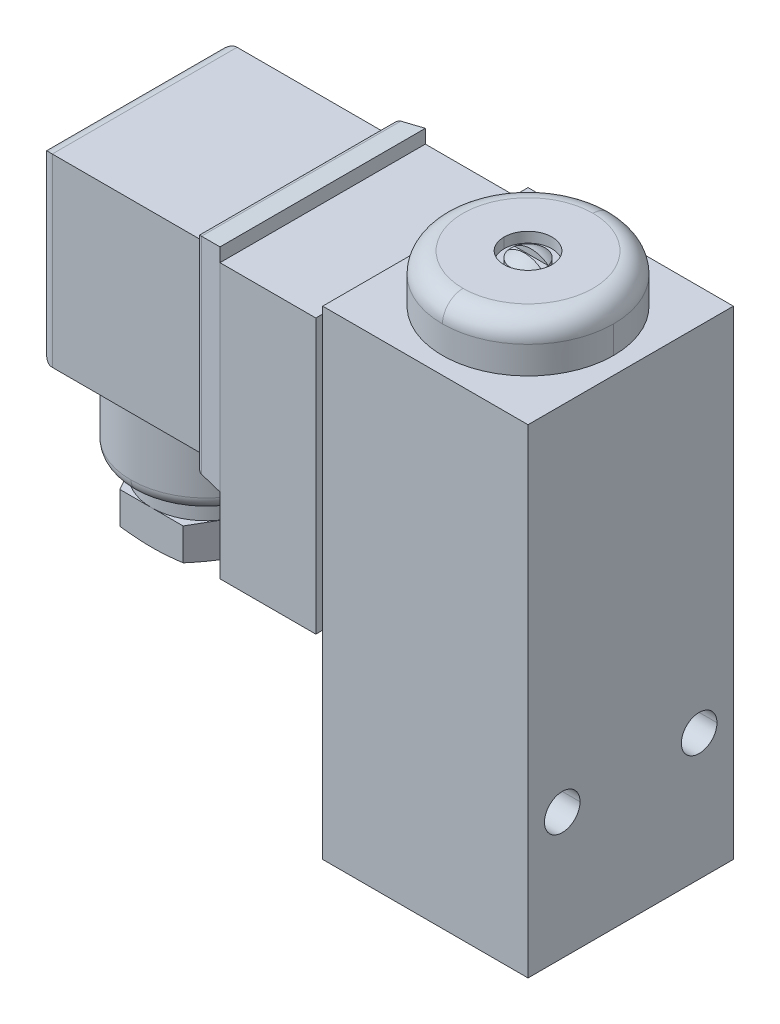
ISO-10303-21;
HEADER;
FILE_DESCRIPTION(('STEP AP214'),'2;1');
FILE_NAME('part.step','',(''),(''),'','','');
FILE_SCHEMA(('AUTOMOTIVE_DESIGN { 1 0 10303 214 1 1 1 1 }'));
ENDSEC;
DATA;
#1=APPLICATION_CONTEXT('core data for automotive mechanical design processes');
#2=APPLICATION_PROTOCOL_DEFINITION('international standard','automotive_design',2000,#1);
#3=PRODUCT_CONTEXT('',#1,'mechanical');
#4=PRODUCT('Part','Part','',(#3));
#5=PRODUCT_RELATED_PRODUCT_CATEGORY('part','',(#4));
#6=PRODUCT_DEFINITION_FORMATION('','',#4);
#7=PRODUCT_DEFINITION_CONTEXT('part definition',#1,'design');
#8=PRODUCT_DEFINITION('design','',#6,#7);
#9=PRODUCT_DEFINITION_SHAPE('','',#8);
#10=(LENGTH_UNIT() NAMED_UNIT(*) SI_UNIT(.MILLI.,.METRE.));
#11=(NAMED_UNIT(*) PLANE_ANGLE_UNIT() SI_UNIT($,.RADIAN.));
#12=(NAMED_UNIT(*) SI_UNIT($,.STERADIAN.) SOLID_ANGLE_UNIT());
#13=UNCERTAINTY_MEASURE_WITH_UNIT(LENGTH_MEASURE(1.E-05),#10,'distance_accuracy_value','');
#14=(GEOMETRIC_REPRESENTATION_CONTEXT(3) GLOBAL_UNCERTAINTY_ASSIGNED_CONTEXT((#13)) GLOBAL_UNIT_ASSIGNED_CONTEXT((#10,
#11,#12)) REPRESENTATION_CONTEXT('',''));
#15=CARTESIAN_POINT('',(0.,0.,0.));
#16=DIRECTION('',(0.,0.,1.));
#17=DIRECTION('',(1.,0.,0.));
#18=AXIS2_PLACEMENT_3D('',#15,#16,#17);
#19=CARTESIAN_POINT('',(15.,20.,0.));
#20=DIRECTION('',(0.,-1.,0.));
#21=DIRECTION('',(0.,0.,-1.));
#22=AXIS2_PLACEMENT_3D('',#19,#20,#21);
#23=PLANE('',#22);
#24=CARTESIAN_POINT('',(11.,20.,0.));
#25=DIRECTION('',(0.,1.,0.));
#26=DIRECTION('',(0.866025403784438,0.,-0.500000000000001));
#27=AXIS2_PLACEMENT_3D('',#24,#25,#26);
#28=CIRCLE('',#27,7.99999999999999);
#29=CARTESIAN_POINT('',(17.9282032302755,20.,-4.));
#30=VERTEX_POINT('',#29);
#31=CARTESIAN_POINT('',(11.,20.,-8.));
#32=VERTEX_POINT('',#31);
#33=EDGE_CURVE('E2150',#30,#32,#28,.T.);
#34=ORIENTED_EDGE('',*,*,#33,.F.);
#35=CARTESIAN_POINT('',(11.,20.,0.));
#36=DIRECTION('',(0.,1.,0.));
#37=DIRECTION('',(1.,0.,0.));
#38=AXIS2_PLACEMENT_3D('',#35,#36,#37);
#39=CIRCLE('',#38,8.);
#40=CARTESIAN_POINT('',(19.,20.,0.));
#41=VERTEX_POINT('',#40);
#42=EDGE_CURVE('E2154',#41,#30,#39,.T.);
#43=ORIENTED_EDGE('',*,*,#42,.F.);
#44=CARTESIAN_POINT('',(11.,20.,0.));
#45=DIRECTION('',(0.,1.,0.));
#46=DIRECTION('',(0.866025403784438,0.,0.500000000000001));
#47=AXIS2_PLACEMENT_3D('',#44,#45,#46);
#48=CIRCLE('',#47,7.99999999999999);
#49=CARTESIAN_POINT('',(17.9282032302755,20.,4.));
#50=VERTEX_POINT('',#49);
#51=EDGE_CURVE('E2664',#50,#41,#48,.T.);
#52=ORIENTED_EDGE('',*,*,#51,.F.);
#53=CARTESIAN_POINT('',(11.,20.,0.));
#54=DIRECTION('',(0.,1.,0.));
#55=DIRECTION('',(0.,0.,1.));
#56=AXIS2_PLACEMENT_3D('',#53,#54,#55);
#57=CIRCLE('',#56,8.);
#58=CARTESIAN_POINT('',(11.,20.,8.));
#59=VERTEX_POINT('',#58);
#60=EDGE_CURVE('E2523',#59,#50,#57,.T.);
#61=ORIENTED_EDGE('',*,*,#60,.F.);
#62=CARTESIAN_POINT('',(11.,20.,0.));
#63=DIRECTION('',(0.,1.,0.));
#64=DIRECTION('',(-0.866025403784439,0.,0.499999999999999));
#65=AXIS2_PLACEMENT_3D('',#62,#63,#64);
#66=CIRCLE('',#65,8.);
#67=CARTESIAN_POINT('',(4.07179676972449,20.,4.));
#68=VERTEX_POINT('',#67);
#69=EDGE_CURVE('E2164',#68,#59,#66,.T.);
#70=ORIENTED_EDGE('',*,*,#69,.F.);
#71=CARTESIAN_POINT('',(11.,20.,0.));
#72=DIRECTION('',(0.,1.,0.));
#73=DIRECTION('',(-1.,0.,0.));
#74=AXIS2_PLACEMENT_3D('',#71,#72,#73);
#75=CIRCLE('',#74,7.99999999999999);
#76=CARTESIAN_POINT('',(3.00000000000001,20.,0.));
#77=VERTEX_POINT('',#76);
#78=EDGE_CURVE('E2382',#77,#68,#75,.T.);
#79=ORIENTED_EDGE('',*,*,#78,.F.);
#80=CARTESIAN_POINT('',(11.,20.,0.));
#81=DIRECTION('',(0.,1.,0.));
#82=DIRECTION('',(-0.866025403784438,0.,-0.5));
#83=AXIS2_PLACEMENT_3D('',#80,#81,#82);
#84=CIRCLE('',#83,8.);
#85=CARTESIAN_POINT('',(4.07179676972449,20.,-4.));
#86=VERTEX_POINT('',#85);
#87=EDGE_CURVE('E2261',#86,#77,#84,.T.);
#88=ORIENTED_EDGE('',*,*,#87,.F.);
#89=CARTESIAN_POINT('',(11.,20.,0.));
#90=DIRECTION('',(0.,1.,0.));
#91=DIRECTION('',(0.,0.,-1.));
#92=AXIS2_PLACEMENT_3D('',#89,#90,#91);
#93=CIRCLE('',#92,8.);
#94=EDGE_CURVE('E2158',#32,#86,#93,.T.);
#95=ORIENTED_EDGE('',*,*,#94,.F.);
#96=EDGE_LOOP('',(#34,#43,#52,#61,#70,#79,#88,#95));
#97=FACE_BOUND('',#96,.T.);
#98=ADVANCED_FACE('F16',(#97),#23,.T.);
#99=CARTESIAN_POINT('',(55.,76.1,0.5));
#100=DIRECTION('',(0.,-1.,0.));
#101=DIRECTION('',(0.,0.,-1.));
#102=AXIS2_PLACEMENT_3D('',#99,#100,#101);
#103=PLANE('',#102);
#104=DIRECTION('',(1.,0.,0.));
#105=VECTOR('',#104,1.);
#106=CARTESIAN_POINT('',(0.,76.1,-0.5));
#107=LINE('',#106,#105);
#108=CARTESIAN_POINT('',(55.5505102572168,76.1,-0.499999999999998));
#109=VERTEX_POINT('',#108);
#110=CARTESIAN_POINT('',(60.4494897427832,76.1,-0.499999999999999));
#111=VERTEX_POINT('',#110);
#112=EDGE_CURVE('E2323',#109,#111,#107,.T.);
#113=ORIENTED_EDGE('',*,*,#112,.F.);
#114=CARTESIAN_POINT('',(58.,76.1,0.));
#115=DIRECTION('',(0.,-1.,0.));
#116=DIRECTION('',(-1.,0.,0.));
#117=AXIS2_PLACEMENT_3D('',#114,#115,#116);
#118=CIRCLE('',#117,2.5);
#119=CARTESIAN_POINT('',(55.5,76.1,0.));
#120=VERTEX_POINT('',#119);
#121=EDGE_CURVE('E1056',#120,#109,#118,.T.);
#122=ORIENTED_EDGE('',*,*,#121,.F.);
#123=CARTESIAN_POINT('',(58.,76.1,0.));
#124=DIRECTION('',(0.,-1.,0.));
#125=DIRECTION('',(-0.979795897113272,0.,0.199999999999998));
#126=AXIS2_PLACEMENT_3D('',#123,#124,#125);
#127=CIRCLE('',#126,2.5);
#128=CARTESIAN_POINT('',(55.5505102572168,76.1,0.499999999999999));
#129=VERTEX_POINT('',#128);
#130=EDGE_CURVE('E1068',#129,#120,#127,.T.);
#131=ORIENTED_EDGE('',*,*,#130,.F.);
#132=DIRECTION('',(1.,0.,0.));
#133=VECTOR('',#132,1.);
#134=CARTESIAN_POINT('',(0.,76.1,0.5));
#135=LINE('',#134,#133);
#136=CARTESIAN_POINT('',(60.4494897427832,76.1,0.499999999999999));
#137=VERTEX_POINT('',#136);
#138=EDGE_CURVE('E2225',#129,#137,#135,.T.);
#139=ORIENTED_EDGE('',*,*,#138,.T.);
#140=CARTESIAN_POINT('',(58.,76.1,0.));
#141=DIRECTION('',(0.,-1.,0.));
#142=DIRECTION('',(1.,0.,0.));
#143=AXIS2_PLACEMENT_3D('',#140,#141,#142);
#144=CIRCLE('',#143,2.5);
#145=CARTESIAN_POINT('',(60.5,76.1,0.));
#146=VERTEX_POINT('',#145);
#147=EDGE_CURVE('E1079',#146,#137,#144,.T.);
#148=ORIENTED_EDGE('',*,*,#147,.F.);
#149=CARTESIAN_POINT('',(58.,76.1,0.));
#150=DIRECTION('',(0.,-1.,0.));
#151=DIRECTION('',(0.979795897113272,0.,-0.199999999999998));
#152=AXIS2_PLACEMENT_3D('',#149,#150,#151);
#153=CIRCLE('',#152,2.5);
#154=EDGE_CURVE('E1511',#111,#146,#153,.T.);
#155=ORIENTED_EDGE('',*,*,#154,.F.);
#156=EDGE_LOOP('',(#113,#122,#131,#139,#148,#155));
#157=FACE_BOUND('',#156,.T.);
#158=ADVANCED_FACE('F2128',(#157),#103,.F.);
#159=CARTESIAN_POINT('',(11.,20.3336047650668,0.));
#160=DIRECTION('',(0.,1.,0.));
#161=DIRECTION('',(0.,0.,1.));
#162=AXIS2_PLACEMENT_3D('',#159,#160,#161);
#163=CONICAL_SURFACE('',#162,9.2450299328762,1.30899693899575);
#164=CARTESIAN_POINT('',(6.38119784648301,20.331615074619,-7.99999999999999));
#165=CARTESIAN_POINT('',(6.51774253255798,20.3133221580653,-8.00000103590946));
#166=CARTESIAN_POINT('',(6.65436731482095,20.2956199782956,-7.99997536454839));
#167=CARTESIAN_POINT('',(6.92572980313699,20.2617486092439,-7.99990785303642));
#168=CARTESIAN_POINT('',(7.06046514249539,20.2455604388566,-7.99986626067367));
#169=CARTESIAN_POINT('',(7.3283527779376,20.2147155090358,-7.99980241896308));
#170=CARTESIAN_POINT('',(7.46150310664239,20.2000417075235,-7.99977992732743));
#171=CARTESIAN_POINT('',(7.72655439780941,20.1722232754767,-7.99977028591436));
#172=CARTESIAN_POINT('',(7.85845384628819,20.1590642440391,-7.99978276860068));
#173=CARTESIAN_POINT('',(8.12136726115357,20.1342730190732,-7.99983941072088));
#174=CARTESIAN_POINT('',(8.25238018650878,20.1226298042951,-7.9998833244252));
#175=CARTESIAN_POINT('',(8.51391321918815,20.1008646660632,-7.99996021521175));
#176=CARTESIAN_POINT('',(8.64443275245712,20.0907358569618,-7.99999324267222));
#177=CARTESIAN_POINT('',(8.90018559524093,20.0723767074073,-8.00000647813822));
#178=CARTESIAN_POINT('',(9.02541450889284,20.0640852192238,-7.99998881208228));
#179=CARTESIAN_POINT('',(9.27521125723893,20.0490069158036,-7.99997585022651));
#180=CARTESIAN_POINT('',(9.39977856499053,20.0422113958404,-7.99998042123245));
#181=CARTESIAN_POINT('',(9.64871267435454,20.030118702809,-8.00000491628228));
#182=CARTESIAN_POINT('',(9.77307931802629,20.0248182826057,-8.0000248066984));
#183=CARTESIAN_POINT('',(10.0201893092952,20.0157782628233,-8.00002400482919));
#184=CARTESIAN_POINT('',(10.1429319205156,20.0120185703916,-8.00000385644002));
#185=CARTESIAN_POINT('',(10.3880115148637,20.0060104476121,-7.99998136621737));
#186=CARTESIAN_POINT('',(10.5103483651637,20.0037566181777,-7.99997896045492));
#187=CARTESIAN_POINT('',(10.7551234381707,20.0007488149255,-7.99998401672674));
#188=CARTESIAN_POINT('',(10.8775616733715,19.9999958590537,-7.99999148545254));
#189=CARTESIAN_POINT('',(11.,20.,-8.));
#190=B_SPLINE_CURVE_WITH_KNOTS('',3,(#164,#165,#166,#167,#168,#169,#170,#171,#172,#173,#174,
#175,#176,#177,#178,#179,#180,#181,#182,#183,#184,#185,#186,#187,#188,#189),.UNSPECIFIED.,.F.,
.F.,(4,2,2,2,2,2,2,2,2,2,2,2,4),(0.,0.413293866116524,0.820401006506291,1.22226349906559,
1.61991880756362,2.01449871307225,2.40722611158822,2.78372736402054,3.15797625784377,
3.53140596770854,3.89979759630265,4.26686121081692,4.63417369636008),.UNSPECIFIED.);
#191=CARTESIAN_POINT('',(6.381197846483,20.331615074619,-8.));
#192=VERTEX_POINT('',#191);
#193=EDGE_CURVE('E2221',#192,#32,#190,.T.);
#194=ORIENTED_EDGE('',*,*,#193,.T.);
#195=ORIENTED_EDGE('',*,*,#94,.T.);
#196=CARTESIAN_POINT('',(4.0717967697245,20.,-4.));
#197=CARTESIAN_POINT('',(4.16449157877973,19.9999778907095,-4.16045937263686));
#198=CARTESIAN_POINT('',(4.2572634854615,20.001676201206,-4.32087433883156));
#199=CARTESIAN_POINT('',(4.44226500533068,20.0084804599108,-4.64081426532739));
#200=CARTESIAN_POINT('',(4.53449489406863,20.0135683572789,-4.8003394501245));
#201=CARTESIAN_POINT('',(4.71908920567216,20.0271474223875,-5.12006779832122));
#202=CARTESIAN_POINT('',(4.81145254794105,20.0356528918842,-5.28027097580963));
#203=CARTESIAN_POINT('',(4.99729424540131,20.0560190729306,-5.60266896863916));
#204=CARTESIAN_POINT('',(5.09077107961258,20.0679229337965,-5.76486191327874));
#205=CARTESIAN_POINT('',(5.28230260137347,20.0954471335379,-6.09671352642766));
#206=CARTESIAN_POINT('',(5.38036176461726,20.1112183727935,-6.26635705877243));
#207=CARTESIAN_POINT('',(5.57719713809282,20.1461537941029,-6.60702400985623));
#208=CARTESIAN_POINT('',(5.67597142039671,20.1653484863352,-6.77804540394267));
#209=CARTESIAN_POINT('',(5.87485562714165,20.2071006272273,-7.12256101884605));
#210=CARTESIAN_POINT('',(5.9749618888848,20.2297065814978,-7.29605143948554));
#211=CARTESIAN_POINT('',(6.17713162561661,20.2782654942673,-7.64642518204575));
#212=CARTESIAN_POINT('',(6.27919144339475,20.3042794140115,-7.82330218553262));
#213=CARTESIAN_POINT('',(6.38119784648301,20.331615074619,-7.99999999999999));
#214=B_SPLINE_CURVE_WITH_KNOTS('',3,(#196,#197,#198,#199,#200,#201,#202,#203,#204,#205,#206,
#207,#208,#209,#210,#211,#212,#213),.UNSPECIFIED.,.F.,.F.,(4,2,2,2,2,2,2,2,4),(0.,
0.555919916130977,1.10890276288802,1.66422422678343,2.22693663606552,2.81664523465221,
3.4118990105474,4.01659362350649,4.63414950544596),.UNSPECIFIED.);
#215=EDGE_CURVE('E2295',#86,#192,#214,.T.);
#216=ORIENTED_EDGE('',*,*,#215,.T.);
#217=EDGE_LOOP('',(#194,#195,#216));
#218=FACE_BOUND('',#217,.T.);
#219=ADVANCED_FACE('F2119',(#218),#163,.T.);
#220=CARTESIAN_POINT('',(11.,20.3336047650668,0.));
#221=DIRECTION('',(0.,1.,0.));
#222=DIRECTION('',(0.,0.,1.));
#223=AXIS2_PLACEMENT_3D('',#220,#221,#222);
#224=CONICAL_SURFACE('',#223,9.24502993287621,1.30899693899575);
#225=CARTESIAN_POINT('',(1.762395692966,20.331615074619,0.));
#226=CARTESIAN_POINT('',(1.83066713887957,20.3133221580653,-0.118251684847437));
#227=CARTESIAN_POINT('',(1.8990017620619,20.2956199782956,-0.236559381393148));
#228=CARTESIAN_POINT('',(2.03474147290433,20.2617486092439,-0.471532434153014));
#229=CARTESIAN_POINT('',(2.10214516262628,20.2455604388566,-0.588195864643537));
#230=CARTESIAN_POINT('',(2.23614426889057,20.2147155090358,-0.820161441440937));
#231=CARTESIAN_POINT('',(2.30273891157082,20.2000417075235,-0.935461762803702));
#232=CARTESIAN_POINT('',(2.43527290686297,20.1722232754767,-1.16499809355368));
#233=CARTESIAN_POINT('',(2.50121182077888,20.1590642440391,-1.27923260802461));
#234=CARTESIAN_POINT('',(2.63261947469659,20.1342730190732,-1.50695062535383));
#235=CARTESIAN_POINT('',(2.69808790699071,20.1226298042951,-1.6204331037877));
#236=CARTESIAN_POINT('',(2.82878783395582,20.1008646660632,-1.84696579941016));
#237=CARTESIAN_POINT('',(2.89401899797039,20.0907358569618,-1.96001554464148));
#238=CARTESIAN_POINT('',(3.02188395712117,20.0723767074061,-2.18151062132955));
#239=CARTESIAN_POINT('',(3.08451371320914,20.0640852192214,-2.28995320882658));
#240=CARTESIAN_POINT('',(3.20942331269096,20.0490069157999,-2.50627705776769));
#241=CARTESIAN_POINT('',(3.2717030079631,20.0422113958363,-2.61415779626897));
#242=CARTESIAN_POINT('',(3.39614884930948,20.0301187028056,-2.82975330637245));
#243=CARTESIAN_POINT('',(3.4583149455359,20.0248182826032,-2.93746792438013));
#244=CARTESIAN_POINT('',(3.5818706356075,20.0157782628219,-3.15147105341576));
#245=CARTESIAN_POINT('',(3.64325939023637,20.0120185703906,-3.25775919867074));
#246=CARTESIAN_POINT('',(3.76581866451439,20.0060104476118,-3.46999310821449));
#247=CARTESIAN_POINT('',(3.82698917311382,20.0037566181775,-3.57593872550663));
#248=CARTESIAN_POINT('',(3.94937233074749,20.0007488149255,-3.78792268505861));
#249=CARTESIAN_POINT('',(4.01058498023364,19.9999958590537,-3.8939610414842));
#250=CARTESIAN_POINT('',(4.0717967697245,20.,-4.));
#251=B_SPLINE_CURVE_WITH_KNOTS('',3,(#225,#226,#227,#228,#229,#230,#231,#232,#233,#234,#235,
#236,#237,#238,#239,#240,#241,#242,#243,#244,#245,#246,#247,#248,#249,#250),.UNSPECIFIED.,.F.,
.F.,(4,2,2,2,2,2,2,2,2,2,2,2,4),(0.,0.413293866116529,0.820401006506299,1.22226349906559,
1.61991880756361,2.01449871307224,2.40722611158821,2.78372736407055,3.15797625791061,
3.53140596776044,3.8997975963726,4.26686121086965,4.63417369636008),.UNSPECIFIED.);
#252=CARTESIAN_POINT('',(1.76239569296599,20.331615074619,0.));
#253=VERTEX_POINT('',#252);
#254=EDGE_CURVE('E2287',#253,#86,#251,.T.);
#255=ORIENTED_EDGE('',*,*,#254,.T.);
#256=ORIENTED_EDGE('',*,*,#87,.T.);
#257=DIRECTION('',(0.965925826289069,-0.258819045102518,0.));
#258=VECTOR('',#257,1.);
#259=CARTESIAN_POINT('',(2.38000000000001,20.1661284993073,0.));
#260=LINE('',#259,#258);
#261=EDGE_CURVE('E2375',#253,#77,#260,.T.);
#262=ORIENTED_EDGE('',*,*,#261,.F.);
#263=EDGE_LOOP('',(#255,#256,#262));
#264=FACE_BOUND('',#263,.T.);
#265=ADVANCED_FACE('F2110',(#264),#224,.T.);
#266=CARTESIAN_POINT('',(11.,20.3336047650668,0.));
#267=DIRECTION('',(0.,1.,0.));
#268=DIRECTION('',(0.,0.,1.));
#269=AXIS2_PLACEMENT_3D('',#266,#267,#268);
#270=CONICAL_SURFACE('',#269,9.24502993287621,1.30899693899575);
#271=ORIENTED_EDGE('',*,*,#78,.T.);
#272=CARTESIAN_POINT('',(4.07179676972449,20.,4.));
#273=CARTESIAN_POINT('',(3.97918228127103,19.9999778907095,3.83949425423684));
#274=CARTESIAN_POINT('',(3.88664479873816,20.001676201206,3.67894394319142));
#275=CARTESIAN_POINT('',(3.70206945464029,20.0084804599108,3.35875796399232));
#276=CARTESIAN_POINT('',(3.61003153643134,20.0135683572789,3.19912194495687));
#277=CARTESIAN_POINT('',(3.42543582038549,20.0271474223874,2.8793944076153));
#278=CARTESIAN_POINT('',(3.33287747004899,20.0356528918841,2.71930381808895));
#279=CARTESIAN_POINT('',(3.1465934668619,20.0560190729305,2.39716119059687));
#280=CARTESIAN_POINT('',(3.0528686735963,20.0679229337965,2.23511140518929));
#281=CARTESIAN_POINT('',(2.86124250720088,20.0954471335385,1.90331443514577));
#282=CARTESIAN_POINT('',(2.7633564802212,20.1112183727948,1.73357094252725));
#283=CARTESIAN_POINT('',(2.56674793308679,20.1461537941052,1.39277303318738));
#284=CARTESIAN_POINT('',(2.46802620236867,20.1653484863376,1.22172129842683));
#285=CARTESIAN_POINT('',(2.26910903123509,20.2071006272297,0.877224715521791));
#286=CARTESIAN_POINT('',(2.16891505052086,20.2297065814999,0.703784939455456));
#287=CARTESIAN_POINT('',(1.96656735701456,20.2782654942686,0.353513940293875));
#288=CARTESIAN_POINT('',(1.86441728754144,20.3042794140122,0.176689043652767));
#289=CARTESIAN_POINT('',(1.762395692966,20.331615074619,0.));
#290=B_SPLINE_CURVE_WITH_KNOTS('',3,(#272,#273,#274,#275,#276,#277,#278,#279,#280,#281,#282,
#283,#284,#285,#286,#287,#288,#289),.UNSPECIFIED.,.F.,.F.,(4,2,2,2,2,2,2,2,4),(0.,
0.555919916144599,1.10890276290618,1.66422422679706,2.22693663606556,2.81664523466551,
3.4118990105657,4.01659362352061,4.63414950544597),.UNSPECIFIED.);
#291=EDGE_CURVE('E2576',#68,#253,#290,.T.);
#292=ORIENTED_EDGE('',*,*,#291,.T.);
#293=ORIENTED_EDGE('',*,*,#261,.T.);
#294=EDGE_LOOP('',(#271,#292,#293));
#295=FACE_BOUND('',#294,.T.);
#296=ADVANCED_FACE('F2101',(#295),#270,.T.);
#297=CARTESIAN_POINT('',(11.,20.3336047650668,0.));
#298=DIRECTION('',(0.,1.,0.));
#299=DIRECTION('',(0.,0.,1.));
#300=AXIS2_PLACEMENT_3D('',#297,#298,#299);
#301=CONICAL_SURFACE('',#300,9.24502993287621,1.30899693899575);
#302=CARTESIAN_POINT('',(6.38119784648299,20.331615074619,7.99999999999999));
#303=CARTESIAN_POINT('',(6.31292460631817,20.3133221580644,7.88174935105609));
#304=CARTESIAN_POINT('',(6.24463444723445,20.2956199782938,7.76341598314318));
#305=CARTESIAN_POINT('',(6.10901166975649,20.2617486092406,7.52837541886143));
#306=CARTESIAN_POINT('',(6.04168002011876,20.2455604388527,7.41167039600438));
#307=CARTESIAN_POINT('',(5.9077914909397,20.2147155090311,7.17964097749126));
#308=CARTESIAN_POINT('',(5.84123580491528,20.2000417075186,7.06431816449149));
#309=CARTESIAN_POINT('',(5.70871850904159,20.1722232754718,6.83477219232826));
#310=CARTESIAN_POINT('',(5.6427579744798,20.1590642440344,6.72055016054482));
#311=CARTESIAN_POINT('',(5.51125221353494,20.1342730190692,6.49288878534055));
#312=CARTESIAN_POINT('',(5.44570772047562,20.1226298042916,6.37945022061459));
#313=CARTESIAN_POINT('',(5.31487461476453,20.1008646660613,6.15299441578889));
#314=CARTESIAN_POINT('',(5.24958624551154,20.090735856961,6.03997769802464));
#315=CARTESIAN_POINT('',(5.12169836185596,20.0723767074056,5.81849585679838));
#316=CARTESIAN_POINT('',(5.05909920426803,20.0640852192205,5.7100356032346));
#317=CARTESIAN_POINT('',(4.9342120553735,20.0490069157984,5.49369879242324));
#318=CARTESIAN_POINT('',(4.87192444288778,20.0422113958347,5.38582262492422));
#319=CARTESIAN_POINT('',(4.74743617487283,20.0301187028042,5.17025160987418));
#320=CARTESIAN_POINT('',(4.68523562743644,20.024818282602,5.06255688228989));
#321=CARTESIAN_POINT('',(4.56168132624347,20.0157782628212,4.84855295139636));
#322=CARTESIAN_POINT('',(4.50032746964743,20.0120185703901,4.74224465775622));
#323=CARTESIAN_POINT('',(4.37780714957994,20.0060104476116,4.52998825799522));
#324=CARTESIAN_POINT('',(4.31664080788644,20.0037566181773,4.42404023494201));
#325=CARTESIAN_POINT('',(4.19424889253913,20.0007488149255,4.21206133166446));
#326=CARTESIAN_POINT('',(4.13302330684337,19.9999958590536,4.10603044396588));
#327=CARTESIAN_POINT('',(4.07179676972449,20.,4.));
#328=B_SPLINE_CURVE_WITH_KNOTS('',3,(#302,#303,#304,#305,#306,#307,#308,#309,#310,#311,#312,
#313,#314,#315,#316,#317,#318,#319,#320,#321,#322,#323,#324,#325,#326,#327),.UNSPECIFIED.,.F.,
.F.,(4,2,2,2,2,2,2,2,2,2,2,2,4),(0.,0.413293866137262,0.82040100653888,1.22226349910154,
1.61991880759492,2.0144987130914,2.40722611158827,2.78372736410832,3.15797625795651,
3.53140596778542,3.89979759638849,4.26686121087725,4.63417369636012),.UNSPECIFIED.);
#329=CARTESIAN_POINT('',(6.38119784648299,20.331615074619,8.));
#330=VERTEX_POINT('',#329);
#331=EDGE_CURVE('E2371',#330,#68,#328,.T.);
#332=ORIENTED_EDGE('',*,*,#331,.T.);
#333=ORIENTED_EDGE('',*,*,#69,.T.);
#334=CARTESIAN_POINT('',(11.,20.,8.));
#335=CARTESIAN_POINT('',(10.8146960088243,19.9999773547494,7.9999516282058));
#336=CARTESIAN_POINT('',(10.6293919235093,20.0016752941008,7.99981526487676));
#337=CARTESIAN_POINT('',(10.2598222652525,20.0084790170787,7.99956842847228));
#338=CARTESIAN_POINT('',(10.0755563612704,20.0135668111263,7.99945782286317));
#339=CARTESIAN_POINT('',(9.70636653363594,20.0271458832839,7.99945964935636));
#340=CARTESIAN_POINT('',(9.5214431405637,20.0356515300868,7.99957303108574));
#341=CARTESIAN_POINT('',(9.14931023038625,20.0560182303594,7.9998296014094));
#342=CARTESIAN_POINT('',(8.96210309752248,20.0679224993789,7.99997316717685));
#343=CARTESIAN_POINT('',(8.57893990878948,20.0954471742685,8.00002811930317));
#344=CARTESIAN_POINT('',(8.38299471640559,20.1112183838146,7.99992804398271));
#345=CARTESIAN_POINT('',(7.98955079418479,20.1461537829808,7.99979699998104));
#346=CARTESIAN_POINT('',(7.79205478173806,20.1653484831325,7.99976668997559));
#347=CARTESIAN_POINT('',(7.39425340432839,20.2071006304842,7.99978574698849));
#348=CARTESIAN_POINT('',(7.19395316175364,20.2297065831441,7.9998363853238));
#349=CARTESIAN_POINT('',(6.78943573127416,20.2782654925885,7.99993911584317));
#350=CARTESIAN_POINT('',(6.58522584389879,20.3042794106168,7.99999121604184));
#351=CARTESIAN_POINT('',(6.38119784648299,20.331615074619,7.99999999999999));
#352=B_SPLINE_CURVE_WITH_KNOTS('',3,(#334,#335,#336,#337,#338,#339,#340,#341,#342,#343,#344,
#345,#346,#347,#348,#349,#350,#351),.UNSPECIFIED.,.F.,.F.,(4,2,2,2,2,2,2,2,4),(0.,
0.555903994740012,1.10888112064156,1.66420770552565,2.22693667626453,2.81664527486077,
3.41189905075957,4.01659366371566,4.63414954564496),.UNSPECIFIED.);
#353=EDGE_CURVE('E2361',#59,#330,#352,.T.);
#354=ORIENTED_EDGE('',*,*,#353,.T.);
#355=EDGE_LOOP('',(#332,#333,#354));
#356=FACE_BOUND('',#355,.T.);
#357=ADVANCED_FACE('F2092',(#356),#301,.T.);
#358=CARTESIAN_POINT('',(11.,20.3336047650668,0.));
#359=DIRECTION('',(0.,1.,0.));
#360=DIRECTION('',(0.,0.,1.));
#361=AXIS2_PLACEMENT_3D('',#358,#359,#360);
#362=CONICAL_SURFACE('',#361,9.2450299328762,1.30899693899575);
#363=ORIENTED_EDGE('',*,*,#33,.T.);
#364=CARTESIAN_POINT('',(11.,20.,-8.));
#365=CARTESIAN_POINT('',(11.1853092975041,19.9999778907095,-7.99995362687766));
#366=CARTESIAN_POINT('',(11.3706186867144,20.001676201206,-7.99981828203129));
#367=CARTESIAN_POINT('',(11.7401955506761,20.0084804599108,-7.9995722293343));
#368=CARTESIAN_POINT('',(11.924463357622,20.0135683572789,-7.9994613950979));
#369=CARTESIAN_POINT('',(12.2936533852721,20.0271474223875,-7.99946220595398));
#370=CARTESIAN_POINT('',(12.4785750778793,20.0356528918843,-7.99957479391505));
#371=CARTESIAN_POINT('',(12.8507007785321,20.0560190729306,-7.99983015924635));
#372=CARTESIAN_POINT('',(13.0379024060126,20.0679229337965,-7.9999733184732));
#373=CARTESIAN_POINT('',(13.421060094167,20.0954471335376,-8.00002796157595));
#374=CARTESIAN_POINT('',(13.6170052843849,20.1112183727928,-7.99992800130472));
#375=CARTESIAN_POINT('',(14.0104492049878,20.1461537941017,-7.99979704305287));
#376=CARTESIAN_POINT('',(14.2079452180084,20.1653484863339,-7.99976670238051));
#377=CARTESIAN_POINT('',(14.6057465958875,20.207100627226,-7.99978573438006));
#378=CARTESIAN_POINT('',(14.8060468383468,20.2297065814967,-7.99983637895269));
#379=CARTESIAN_POINT('',(15.2105642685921,20.2782654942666,-7.99993912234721));
#380=CARTESIAN_POINT('',(15.4147741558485,20.3042794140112,-7.9999912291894));
#381=CARTESIAN_POINT('',(15.618802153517,20.331615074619,-7.99999999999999));
#382=B_SPLINE_CURVE_WITH_KNOTS('',3,(#364,#365,#366,#367,#368,#369,#370,#371,#372,#373,#374,
#375,#376,#377,#378,#379,#380,#381),.UNSPECIFIED.,.F.,.F.,(4,2,2,2,2,2,2,2,4),(0.,
0.555919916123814,1.10890276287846,1.66422422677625,2.22693663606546,2.81664523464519,
3.41189901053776,4.01659362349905,4.63414950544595),.UNSPECIFIED.);
#383=CARTESIAN_POINT('',(15.618802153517,20.331615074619,-8.));
#384=VERTEX_POINT('',#383);
#385=EDGE_CURVE('E2184',#32,#384,#382,.T.);
#386=ORIENTED_EDGE('',*,*,#385,.T.);
#387=CARTESIAN_POINT('',(15.618802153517,20.331615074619,-7.99999999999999));
#388=CARTESIAN_POINT('',(15.6870753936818,20.3133221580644,-7.88174935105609));
#389=CARTESIAN_POINT('',(15.7553655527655,20.2956199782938,-7.76341598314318));
#390=CARTESIAN_POINT('',(15.8909883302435,20.2617486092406,-7.52837541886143));
#391=CARTESIAN_POINT('',(15.9583199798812,20.2455604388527,-7.41167039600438));
#392=CARTESIAN_POINT('',(16.0922085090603,20.2147155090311,-7.17964097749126));
#393=CARTESIAN_POINT('',(16.1587641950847,20.2000417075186,-7.06431816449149));
#394=CARTESIAN_POINT('',(16.2912814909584,20.1722232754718,-6.83477219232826));
#395=CARTESIAN_POINT('',(16.3572420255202,20.1590642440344,-6.72055016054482));
#396=CARTESIAN_POINT('',(16.4887477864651,20.1342730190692,-6.49288878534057));
#397=CARTESIAN_POINT('',(16.5542922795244,20.1226298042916,-6.37945022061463));
#398=CARTESIAN_POINT('',(16.6851253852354,20.1008646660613,-6.15299441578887));
#399=CARTESIAN_POINT('',(16.7504137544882,20.0907358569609,-6.03997769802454));
#400=CARTESIAN_POINT('',(16.878301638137,20.0723767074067,-5.81849585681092));
#401=CARTESIAN_POINT('',(16.9409007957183,20.0640852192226,-5.71003560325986));
#402=CARTESIAN_POINT('',(17.0657879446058,20.0490069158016,-5.49369879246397));
#403=CARTESIAN_POINT('',(17.1280755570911,20.0422113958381,-5.3858226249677));
#404=CARTESIAN_POINT('',(17.2525638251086,20.0301187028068,-5.17025160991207));
#405=CARTESIAN_POINT('',(17.314764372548,20.0248182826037,-5.06255688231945));
#406=CARTESIAN_POINT('',(17.438318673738,20.0157782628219,-4.8485529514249));
#407=CARTESIAN_POINT('',(17.4996725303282,20.0120185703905,-4.74224465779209));
#408=CARTESIAN_POINT('',(17.622192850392,20.0060104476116,-4.52998825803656));
#409=CARTESIAN_POINT('',(17.6833591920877,20.0037566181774,-4.42404023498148));
#410=CARTESIAN_POINT('',(17.8057511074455,20.0007488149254,-4.21206133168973));
#411=CARTESIAN_POINT('',(17.8669766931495,19.9999958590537,-4.10603044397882));
#412=CARTESIAN_POINT('',(17.9282032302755,20.,-4.));
#413=B_SPLINE_CURVE_WITH_KNOTS('',3,(#387,#388,#389,#390,#391,#392,#393,#394,#395,#396,#397,
#398,#399,#400,#401,#402,#403,#404,#405,#406,#407,#408,#409,#410,#411,#412),.UNSPECIFIED.,.F.,
.F.,(4,2,2,2,2,2,2,2,2,2,2,2,4),(0.,0.413293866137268,0.820401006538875,1.22226349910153,
1.61991880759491,2.01449871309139,2.40722611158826,2.78372736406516,3.15797625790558,
3.53140596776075,3.89979759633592,4.26686121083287,4.63417369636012),.UNSPECIFIED.);
#414=EDGE_CURVE('E2172',#384,#30,#413,.T.);
#415=ORIENTED_EDGE('',*,*,#414,.T.);
#416=EDGE_LOOP('',(#363,#386,#415));
#417=FACE_BOUND('',#416,.T.);
#418=ADVANCED_FACE('F2083',(#417),#362,.T.);
#419=CARTESIAN_POINT('',(11.,20.3336047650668,0.));
#420=DIRECTION('',(0.,1.,0.));
#421=DIRECTION('',(0.,0.,1.));
#422=AXIS2_PLACEMENT_3D('',#419,#420,#421);
#423=CONICAL_SURFACE('',#422,9.24502993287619,1.30899693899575);
#424=ORIENTED_EDGE('',*,*,#42,.T.);
#425=CARTESIAN_POINT('',(17.9282032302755,20.,-4.));
#426=CARTESIAN_POINT('',(18.0208177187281,19.9999778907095,-3.83949425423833));
#427=CARTESIAN_POINT('',(18.1133552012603,20.001676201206,-3.67894394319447));
#428=CARTESIAN_POINT('',(18.2979305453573,20.0084804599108,-3.35875796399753));
#429=CARTESIAN_POINT('',(18.3899684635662,20.0135683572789,-3.19912194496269));
#430=CARTESIAN_POINT('',(18.5745641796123,20.0271474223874,-2.8793944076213));
#431=CARTESIAN_POINT('',(18.6671225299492,20.0356528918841,-2.71930381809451));
#432=CARTESIAN_POINT('',(18.8534065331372,20.0560190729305,-2.39716119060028));
#433=CARTESIAN_POINT('',(18.9471313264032,20.0679229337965,-2.235111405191));
#434=CARTESIAN_POINT('',(19.1387574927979,20.0954471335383,-1.90331443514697));
#435=CARTESIAN_POINT('',(19.2366435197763,20.1112183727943,-1.73357094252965));
#436=CARTESIAN_POINT('',(19.4332520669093,20.1461537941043,-1.39277303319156));
#437=CARTESIAN_POINT('',(19.5319737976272,20.1653484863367,-1.2217212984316));
#438=CARTESIAN_POINT('',(19.730890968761,20.2071006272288,-0.877224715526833));
#439=CARTESIAN_POINT('',(19.8310849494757,20.2297065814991,-0.703784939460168));
#440=CARTESIAN_POINT('',(20.0334326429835,20.2782654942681,-0.353513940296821));
#441=CARTESIAN_POINT('',(20.1355827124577,20.3042794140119,-0.176689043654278));
#442=CARTESIAN_POINT('',(20.237604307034,20.331615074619,0.));
#443=B_SPLINE_CURVE_WITH_KNOTS('',3,(#425,#426,#427,#428,#429,#430,#431,#432,#433,#434,#435,
#436,#437,#438,#439,#440,#441,#442),.UNSPECIFIED.,.F.,.F.,(4,2,2,2,2,2,2,2,4),(0.,
0.555919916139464,1.10890276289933,1.66422422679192,2.22693663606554,2.8166452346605,
3.4118990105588,4.01659362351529,4.63414950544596),.UNSPECIFIED.);
#444=CARTESIAN_POINT('',(20.237604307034,20.331615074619,0.));
#445=VERTEX_POINT('',#444);
#446=EDGE_CURVE('E2170',#30,#445,#443,.T.);
#447=ORIENTED_EDGE('',*,*,#446,.T.);
#448=DIRECTION('',(-0.965925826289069,-0.258819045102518,0.));
#449=VECTOR('',#448,1.);
#450=CARTESIAN_POINT('',(19.62,20.1661284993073,0.));
#451=LINE('',#450,#449);
#452=EDGE_CURVE('E2852',#41,#445,#451,.F.);
#453=ORIENTED_EDGE('',*,*,#452,.F.);
#454=EDGE_LOOP('',(#424,#447,#453));
#455=FACE_BOUND('',#454,.T.);
#456=ADVANCED_FACE('F2074',(#455),#423,.T.);
#457=CARTESIAN_POINT('',(11.,20.3336047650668,0.));
#458=DIRECTION('',(0.,1.,0.));
#459=DIRECTION('',(0.,0.,1.));
#460=AXIS2_PLACEMENT_3D('',#457,#458,#459);
#461=CONICAL_SURFACE('',#460,9.24502993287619,1.30899693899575);
#462=CARTESIAN_POINT('',(20.237604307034,20.331615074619,0.));
#463=CARTESIAN_POINT('',(20.1693328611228,20.3133221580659,0.118251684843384));
#464=CARTESIAN_POINT('',(20.100998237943,20.2956199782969,0.236559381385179));
#465=CARTESIAN_POINT('',(19.965258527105,20.2617486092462,0.471532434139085));
#466=CARTESIAN_POINT('',(19.8978548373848,20.2455604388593,0.588195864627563));
#467=CARTESIAN_POINT('',(19.7638557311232,20.214715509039,0.820161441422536));
#468=CARTESIAN_POINT('',(19.6972610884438,20.2000417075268,0.935461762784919));
#469=CARTESIAN_POINT('',(19.5647270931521,20.1722232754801,1.16499809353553));
#470=CARTESIAN_POINT('',(19.4987881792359,20.1590642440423,1.27923260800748));
#471=CARTESIAN_POINT('',(19.3673805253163,20.134273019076,1.50695062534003));
#472=CARTESIAN_POINT('',(19.3019120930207,20.1226298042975,1.62043310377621));
#473=CARTESIAN_POINT('',(19.1712121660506,20.1008646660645,1.84696579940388));
#474=CARTESIAN_POINT('',(19.1059810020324,20.0907358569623,1.96001554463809));
#475=CARTESIAN_POINT('',(18.9781160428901,20.0723767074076,2.1815106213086));
#476=CARTESIAN_POINT('',(18.9154862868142,20.0640852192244,2.28995320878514));
#477=CARTESIAN_POINT('',(18.7905766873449,20.0490069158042,2.50627705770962));
#478=CARTESIAN_POINT('',(18.7282969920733,20.0422113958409,2.61415779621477));
#479=CARTESIAN_POINT('',(18.603851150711,20.0301187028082,2.8297533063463));
#480=CARTESIAN_POINT('',(18.5416850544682,20.0248182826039,2.93746792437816));
#481=CARTESIAN_POINT('',(18.4181293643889,20.0157782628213,3.15147105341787));
#482=CARTESIAN_POINT('',(18.3567406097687,20.01201857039,3.25775919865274));
#483=CARTESIAN_POINT('',(18.2341813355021,20.0060104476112,3.4699931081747));
#484=CARTESIAN_POINT('',(18.1730108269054,20.0037566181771,3.57593872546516));
#485=CARTESIAN_POINT('',(18.0506276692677,20.0007488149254,3.78792268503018));
#486=CARTESIAN_POINT('',(17.9894150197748,19.9999958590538,3.89396104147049));
#487=CARTESIAN_POINT('',(17.9282032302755,20.,4.));
#488=B_SPLINE_CURVE_WITH_KNOTS('',3,(#462,#463,#464,#465,#466,#467,#468,#469,#470,#471,#472,
#473,#474,#475,#476,#477,#478,#479,#480,#481,#482,#483,#484,#485,#486,#487),.UNSPECIFIED.,.F.,
.F.,(4,2,2,2,2,2,2,2,2,2,2,2,4),(0.,0.413293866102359,0.820401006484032,1.22226349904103,
1.61991880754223,2.01449871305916,2.40722611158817,2.78372736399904,3.15797625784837,
3.5314059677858,3.89979759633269,4.26686121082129,4.63417369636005),.UNSPECIFIED.);
#489=EDGE_CURVE('E2528',#445,#50,#488,.T.);
#490=ORIENTED_EDGE('',*,*,#489,.T.);
#491=ORIENTED_EDGE('',*,*,#51,.T.);
#492=ORIENTED_EDGE('',*,*,#452,.T.);
#493=EDGE_LOOP('',(#490,#491,#492));
#494=FACE_BOUND('',#493,.T.);
#495=ADVANCED_FACE('F2065',(#494),#461,.T.);
#496=CARTESIAN_POINT('',(11.,20.3336047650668,0.));
#497=DIRECTION('',(0.,1.,0.));
#498=DIRECTION('',(0.,0.,1.));
#499=AXIS2_PLACEMENT_3D('',#496,#497,#498);
#500=CONICAL_SURFACE('',#499,9.2450299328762,1.30899693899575);
#501=ORIENTED_EDGE('',*,*,#60,.T.);
#502=CARTESIAN_POINT('',(17.9282032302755,20.,4.));
#503=CARTESIAN_POINT('',(17.8355084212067,19.9999778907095,4.16045937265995));
#504=CARTESIAN_POINT('',(17.7427365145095,20.0016762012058,4.32087433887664));
#505=CARTESIAN_POINT('',(17.5577349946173,20.0084804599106,4.64081426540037));
#506=CARTESIAN_POINT('',(17.4655051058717,20.0135683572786,4.8003394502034));
#507=CARTESIAN_POINT('',(17.2809107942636,20.0271474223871,5.12006779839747));
#508=CARTESIAN_POINT('',(17.1885474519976,20.0356528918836,5.2802709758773));
#509=CARTESIAN_POINT('',(17.0027057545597,20.0560190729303,5.6026689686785));
#510=CARTESIAN_POINT('',(16.9092289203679,20.0679229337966,5.7648619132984));
#511=CARTESIAN_POINT('',(16.71769739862,20.0954471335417,6.09671352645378));
#512=CARTESIAN_POINT('',(16.6196382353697,20.1112183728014,6.26635705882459));
#513=CARTESIAN_POINT('',(16.4228028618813,20.1461537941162,6.60702400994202));
#514=CARTESIAN_POINT('',(16.3240285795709,20.1653484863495,6.77804540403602));
#515=CARTESIAN_POINT('',(16.1251443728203,20.2071006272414,7.12256101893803));
#516=CARTESIAN_POINT('',(16.0250381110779,20.2297065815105,7.2960514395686));
#517=CARTESIAN_POINT('',(15.8228683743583,20.278265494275,7.64642518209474));
#518=CARTESIAN_POINT('',(15.7208085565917,20.3042794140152,7.82330218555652));
#519=CARTESIAN_POINT('',(15.618802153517,20.331615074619,7.99999999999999));
#520=B_SPLINE_CURVE_WITH_KNOTS('',3,(#502,#503,#504,#505,#506,#507,#508,#509,#510,#511,#512,
#513,#514,#515,#516,#517,#518,#519),.UNSPECIFIED.,.F.,.F.,(4,2,2,2,2,2,2,2,4),(0.,
0.555919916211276,1.10890276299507,1.66422422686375,2.22693663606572,2.81664523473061,
3.41189901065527,4.01659362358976,4.63414950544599),.UNSPECIFIED.);
#521=CARTESIAN_POINT('',(15.618802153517,20.331615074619,7.99999999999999));
#522=VERTEX_POINT('',#521);
#523=EDGE_CURVE('E2525',#50,#522,#520,.T.);
#524=ORIENTED_EDGE('',*,*,#523,.T.);
#525=CARTESIAN_POINT('',(15.618802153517,20.331615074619,7.99999999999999));
#526=CARTESIAN_POINT('',(15.4822574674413,20.3133221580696,8.00000103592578));
#527=CARTESIAN_POINT('',(15.3456326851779,20.2956199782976,7.99997536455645));
#528=CARTESIAN_POINT('',(15.0742701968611,20.2617486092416,7.99990785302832));
#529=CARTESIAN_POINT('',(14.9395348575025,20.2455604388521,7.99986626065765));
#530=CARTESIAN_POINT('',(14.6716472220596,20.2147155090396,7.99980241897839));
#531=CARTESIAN_POINT('',(14.5384968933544,20.2000417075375,7.99977992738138));
#532=CARTESIAN_POINT('',(14.2734456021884,20.1722232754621,7.99977028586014));
#533=CARTESIAN_POINT('',(14.1415461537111,20.1590642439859,7.99978276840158));
#534=CARTESIAN_POINT('',(13.8786327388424,20.1342730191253,7.99983941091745));
#535=CARTESIAN_POINT('',(13.7476198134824,20.1226298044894,7.99988332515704));
#536=CARTESIAN_POINT('',(13.4860867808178,20.1008646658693,7.99996021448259));
#537=CARTESIAN_POINT('',(13.3555672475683,20.0907358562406,7.99999323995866));
#538=CARTESIAN_POINT('',(13.0998144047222,20.0723767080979,8.00000648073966));
#539=CARTESIAN_POINT('',(12.974585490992,20.0640852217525,7.99998882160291));
#540=CARTESIAN_POINT('',(12.7247887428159,20.0490069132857,7.99997584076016));
#541=CARTESIAN_POINT('',(12.6002214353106,20.0422113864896,7.99998038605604));
#542=CARTESIAN_POINT('',(12.3512873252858,20.0301187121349,8.00000495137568));
#543=CARTESIAN_POINT('',(12.2269206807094,20.0248183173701,8.00002493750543));
#544=CARTESIAN_POINT('',(11.9798042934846,20.0157779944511,8.00002387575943));
#545=CARTESIAN_POINT('',(11.8570552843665,20.0120180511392,8.00000337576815));
#546=CARTESIAN_POINT('',(11.6119693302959,20.0060097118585,7.99998007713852));
#547=CARTESIAN_POINT('',(11.4896325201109,20.0037558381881,7.99997721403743));
#548=CARTESIAN_POINT('',(11.2448638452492,20.0007482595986,7.99998223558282));
#549=CARTESIAN_POINT('',(11.1224319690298,19.9999954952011,7.99999012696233));
#550=CARTESIAN_POINT('',(11.,20.,8.));
#551=B_SPLINE_CURVE_WITH_KNOTS('',3,(#525,#526,#527,#528,#529,#530,#531,#532,#533,#534,#535,
#536,#537,#538,#539,#540,#541,#542,#543,#544,#545,#546,#547,#548,#549,#550),.UNSPECIFIED.,.F.,
.F.,(4,2,2,2,2,2,2,2,2,2,2,2,4),(0.,0.41329386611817,0.820401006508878,1.22226349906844,
1.61991880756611,2.01449871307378,2.40722611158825,2.78372736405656,3.15797625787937,
3.53140596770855,3.8998168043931,4.26688029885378,4.6341737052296),.UNSPECIFIED.);
#552=EDGE_CURVE('E2730',#522,#59,#551,.T.);
#553=ORIENTED_EDGE('',*,*,#552,.T.);
#554=EDGE_LOOP('',(#501,#524,#553));
#555=FACE_BOUND('',#554,.T.);
#556=ADVANCED_FACE('F2056',(#555),#500,.T.);
#557=CARTESIAN_POINT('',(0.,0.,-0.5));
#558=DIRECTION('',(0.,0.,1.));
#559=DIRECTION('',(1.,0.,0.));
#560=AXIS2_PLACEMENT_3D('',#557,#558,#559);
#561=PLANE('',#560);
#562=DIRECTION('',(0.,1.,0.));
#563=VECTOR('',#562,1.);
#564=CARTESIAN_POINT('',(55.5505102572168,0.,-0.5));
#565=LINE('',#564,#563);
#566=CARTESIAN_POINT('',(55.5505102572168,76.1225,-0.500000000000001));
#567=VERTEX_POINT('',#566);
#568=EDGE_CURVE('E2330',#567,#109,#565,.F.);
#569=ORIENTED_EDGE('',*,*,#568,.T.);
#570=ORIENTED_EDGE('',*,*,#112,.T.);
#571=DIRECTION('',(0.,1.,0.));
#572=VECTOR('',#571,1.);
#573=CARTESIAN_POINT('',(60.4494897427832,0.,-0.5));
#574=LINE('',#573,#572);
#575=CARTESIAN_POINT('',(60.4494897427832,76.1225,-0.500000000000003));
#576=VERTEX_POINT('',#575);
#577=EDGE_CURVE('E2521',#111,#576,#574,.T.);
#578=ORIENTED_EDGE('',*,*,#577,.T.);
#579=CARTESIAN_POINT('',(55.5505102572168,76.1225,-0.500000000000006));
#580=CARTESIAN_POINT('',(55.5879959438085,76.1519066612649,-0.500000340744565));
#581=CARTESIAN_POINT('',(55.6260116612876,76.1806377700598,-0.49999995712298));
#582=CARTESIAN_POINT('',(55.704388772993,76.237685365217,-0.499998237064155));
#583=CARTESIAN_POINT('',(55.7447857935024,76.2659529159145,-0.499996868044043));
#584=CARTESIAN_POINT('',(55.827976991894,76.3218857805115,-0.499993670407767));
#585=CARTESIAN_POINT('',(55.8708061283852,76.3494991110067,-0.499991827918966));
#586=CARTESIAN_POINT('',(55.9589032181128,76.403925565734,-0.49998855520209));
#587=CARTESIAN_POINT('',(56.0042052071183,76.4306836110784,-0.499987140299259));
#588=CARTESIAN_POINT('',(56.0972788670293,76.4831907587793,-0.49998545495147));
#589=CARTESIAN_POINT('',(56.14508339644,76.5088816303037,-0.499985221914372));
#590=CARTESIAN_POINT('',(56.2431806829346,76.5590354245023,-0.499986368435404));
#591=CARTESIAN_POINT('',(56.2935048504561,76.5834369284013,-0.499987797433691));
#592=CARTESIAN_POINT('',(56.3966458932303,76.630783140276,-0.499991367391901));
#593=CARTESIAN_POINT('',(56.4494924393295,76.6536632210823,-0.499993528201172));
#594=CARTESIAN_POINT('',(56.5576681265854,76.6977284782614,-0.499998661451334));
#595=CARTESIAN_POINT('',(56.6130249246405,76.7188458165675,-0.50000165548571));
#596=CARTESIAN_POINT('',(56.7198831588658,76.7568933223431,-0.499998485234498));
#597=CARTESIAN_POINT('',(56.7713123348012,76.7740268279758,-0.499993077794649));
#598=CARTESIAN_POINT('',(56.875471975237,76.8063733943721,-0.49997651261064));
#599=CARTESIAN_POINT('',(56.9282106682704,76.8215599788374,-0.499965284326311));
#600=CARTESIAN_POINT('',(57.0349239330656,76.8499060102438,-0.499944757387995));
#601=CARTESIAN_POINT('',(57.0889057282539,76.8630382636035,-0.499935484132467));
#602=CARTESIAN_POINT('',(57.198032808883,76.8871705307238,-0.499922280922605));
#603=CARTESIAN_POINT('',(57.25318426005,76.8981426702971,-0.499918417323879));
#604=CARTESIAN_POINT('',(57.3645704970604,76.9178510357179,-0.499917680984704));
#605=CARTESIAN_POINT('',(57.4208103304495,76.9265587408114,-0.499920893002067));
#606=CARTESIAN_POINT('',(57.5342854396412,76.9416366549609,-0.499933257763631));
#607=CARTESIAN_POINT('',(57.5915245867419,76.9479777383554,-0.499942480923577));
#608=CARTESIAN_POINT('',(57.7069025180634,76.9582233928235,-0.499963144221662));
#609=CARTESIAN_POINT('',(57.7650439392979,76.9620982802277,-0.499974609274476));
#610=CARTESIAN_POINT('',(57.8821226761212,76.9673156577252,-0.499993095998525));
#611=CARTESIAN_POINT('',(57.9410613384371,76.9686279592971,-0.500000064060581));
#612=CARTESIAN_POINT('',(58.0589320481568,76.9686279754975,-0.499999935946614));
#613=CARTESIAN_POINT('',(58.117864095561,76.9673159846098,-0.499992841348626));
#614=CARTESIAN_POINT('',(58.2349315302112,76.9620997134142,-0.499974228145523));
#615=CARTESIAN_POINT('',(58.2930682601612,76.9582255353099,-0.499962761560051));
#616=CARTESIAN_POINT('',(58.4084387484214,76.947981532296,-0.499942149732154));
#617=CARTESIAN_POINT('',(58.4656751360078,76.941641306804,-0.499932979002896));
#618=CARTESIAN_POINT('',(58.5791466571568,76.9265650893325,-0.499920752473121));
#619=CARTESIAN_POINT('',(58.6353856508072,76.9178581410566,-0.499917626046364));
#620=CARTESIAN_POINT('',(58.7467721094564,76.898151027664,-0.499918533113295));
#621=CARTESIAN_POINT('',(58.8019246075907,76.8871793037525,-0.499922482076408));
#622=CARTESIAN_POINT('',(58.9110556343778,76.8630473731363,-0.499935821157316));
#623=CARTESIAN_POINT('',(58.9650403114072,76.8499149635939,-0.499945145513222));
#624=CARTESIAN_POINT('',(59.0717611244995,76.8215679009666,-0.499965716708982));
#625=CARTESIAN_POINT('',(59.1245044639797,76.8063803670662,-0.499976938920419));
#626=CARTESIAN_POINT('',(59.2286751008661,76.7740309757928,-0.499993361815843));
#627=CARTESIAN_POINT('',(59.2801106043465,76.7568955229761,-0.499998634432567));
#628=CARTESIAN_POINT('',(59.3869727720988,76.7188466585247,-0.500001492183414));
#629=CARTESIAN_POINT('',(59.4423273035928,76.6977302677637,-0.499998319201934));
#630=CARTESIAN_POINT('',(59.5504991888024,76.6536668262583,-0.499992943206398));
#631=CARTESIAN_POINT('',(59.6033441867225,76.6307875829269,-0.499990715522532));
#632=CARTESIAN_POINT('',(59.7064828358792,76.5834428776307,-0.499987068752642));
#633=CARTESIAN_POINT('',(59.7568061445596,76.5590420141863,-0.499985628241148));
#634=CARTESIAN_POINT('',(59.8549023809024,76.5088892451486,-0.499984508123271));
#635=CARTESIAN_POINT('',(59.9027067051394,76.4831987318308,-0.49998477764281));
#636=CARTESIAN_POINT('',(59.9957805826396,76.4306919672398,-0.499986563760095));
#637=CARTESIAN_POINT('',(60.041082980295,76.4039339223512,-0.49998804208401));
#638=CARTESIAN_POINT('',(60.1291814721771,76.3495070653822,-0.49999145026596));
#639=CARTESIAN_POINT('',(60.1720115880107,76.321893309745,-0.499993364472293));
#640=CARTESIAN_POINT('',(60.2552052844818,76.2659591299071,-0.49999669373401));
#641=CARTESIAN_POINT('',(60.2956038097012,76.2376906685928,-0.499998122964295));
#642=CARTESIAN_POINT('',(60.373984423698,76.1806407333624,-0.499999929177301));
#643=CARTESIAN_POINT('',(60.4120021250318,76.1519081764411,-0.500000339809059));
#644=CARTESIAN_POINT('',(60.4494897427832,76.1225,-0.500000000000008));
#645=B_SPLINE_CURVE_WITH_KNOTS('',3,(#579,#580,#581,#582,#583,#584,#585,#586,#587,#588,#589,
#590,#591,#592,#593,#594,#595,#596,#597,#598,#599,#600,#601,#602,#603,#604,#605,#606,#607,#608,
#609,#610,#611,#612,#613,#614,#615,#616,#617,#618,#619,#620,#621,#622,#623,#624,#625,#626,#627,
#628,#629,#630,#631,#632,#633,#634,#635,#636,#637,#638,#639,#640,#641,#642,#643,#644),
.UNSPECIFIED.,.F.,.F.,(4,2,2,2,2,2,2,2,2,2,2,2,2,2,2,2,2,2,2,2,2,2,2,2,2,2,2,2,2,2,2,2,4),(0.,
0.142923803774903,0.29080429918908,0.443643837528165,0.601445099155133,0.764211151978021,
0.931945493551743,1.10465207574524,1.28233531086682,1.44491505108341,1.60951274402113,
1.77613239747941,1.94477844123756,2.1154556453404,2.28816902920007,2.46292376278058,
2.6397250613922,2.81650652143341,2.99124708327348,3.16395196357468,3.33462633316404,
3.50327521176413,3.66990336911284,3.83451523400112,3.99711481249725,4.17479069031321,
4.34749201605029,4.5152232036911,4.67798820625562,4.83579052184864,4.98863321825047,
5.13651897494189,5.27945014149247),.UNSPECIFIED.);
#646=EDGE_CURVE('E992',#567,#576,#645,.T.);
#647=ORIENTED_EDGE('',*,*,#646,.F.);
#648=EDGE_LOOP('',(#569,#570,#578,#647));
#649=FACE_BOUND('',#648,.T.);
#650=ADVANCED_FACE('F2047',(#649),#561,.T.);
#651=CARTESIAN_POINT('',(0.,0.,0.5));
#652=DIRECTION('',(0.,0.,1.));
#653=DIRECTION('',(1.,0.,0.));
#654=AXIS2_PLACEMENT_3D('',#651,#652,#653);
#655=PLANE('',#654);
#656=ORIENTED_EDGE('',*,*,#138,.F.);
#657=DIRECTION('',(0.,1.,0.));
#658=VECTOR('',#657,1.);
#659=CARTESIAN_POINT('',(55.5505102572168,0.,0.5));
#660=LINE('',#659,#658);
#661=CARTESIAN_POINT('',(55.5505102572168,76.1225,0.500000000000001));
#662=VERTEX_POINT('',#661);
#663=EDGE_CURVE('E2314',#662,#129,#660,.F.);
#664=ORIENTED_EDGE('',*,*,#663,.F.);
#665=CARTESIAN_POINT('',(60.4494897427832,76.1225,0.500000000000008));
#666=CARTESIAN_POINT('',(60.4120040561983,76.1519066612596,0.500000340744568));
#667=CARTESIAN_POINT('',(60.3739883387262,76.1806377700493,0.499999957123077));
#668=CARTESIAN_POINT('',(60.2956112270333,76.2376853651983,0.499998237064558));
#669=CARTESIAN_POINT('',(60.2552142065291,76.2659529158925,0.499996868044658));
#670=CARTESIAN_POINT('',(60.1720230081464,76.3218857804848,0.499993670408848));
#671=CARTESIAN_POINT('',(60.1291938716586,76.3494991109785,0.499991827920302));
#672=CARTESIAN_POINT('',(60.041096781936,76.4039255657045,0.499988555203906));
#673=CARTESIAN_POINT('',(59.9957947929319,76.4306836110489,0.499987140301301));
#674=CARTESIAN_POINT('',(59.9027211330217,76.4831907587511,0.499985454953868));
#675=CARTESIAN_POINT('',(59.8549166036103,76.5088816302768,0.499985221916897));
#676=CARTESIAN_POINT('',(59.756819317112,76.559035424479,0.499986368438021));
#677=CARTESIAN_POINT('',(59.7064951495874,76.5834369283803,0.49998779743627));
#678=CARTESIAN_POINT('',(59.6033541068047,76.6307831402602,0.499991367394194));
#679=CARTESIAN_POINT('',(59.5505075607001,76.6536632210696,0.499993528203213));
#680=CARTESIAN_POINT('',(59.4423318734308,76.6977284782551,0.499998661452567));
#681=CARTESIAN_POINT('',(59.3869750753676,76.7188458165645,0.500001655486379));
#682=CARTESIAN_POINT('',(59.2801168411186,76.7568933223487,0.499998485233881));
#683=CARTESIAN_POINT('',(59.2286876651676,76.7740268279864,0.499993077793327));
#684=CARTESIAN_POINT('',(59.1245280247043,76.80637339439,0.49997651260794));
#685=CARTESIAN_POINT('',(59.0717893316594,76.8215599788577,0.49996528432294));
#686=CARTESIAN_POINT('',(58.9650760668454,76.8499060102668,0.499944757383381));
#687=CARTESIAN_POINT('',(58.9110942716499,76.8630382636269,0.499935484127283));
#688=CARTESIAN_POINT('',(58.801967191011,76.8871705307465,0.499922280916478));
#689=CARTESIAN_POINT('',(58.7468157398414,76.8981426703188,0.499918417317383));
#690=CARTESIAN_POINT('',(58.6354295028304,76.9178510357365,0.499917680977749));
#691=CARTESIAN_POINT('',(58.5791896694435,76.9265587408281,0.499920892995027));
#692=CARTESIAN_POINT('',(58.4657145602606,76.9416366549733,0.499933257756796));
#693=CARTESIAN_POINT('',(58.4084754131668,76.9479777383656,0.499942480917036));
#694=CARTESIAN_POINT('',(58.2930974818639,76.9582233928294,0.499963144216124));
#695=CARTESIAN_POINT('',(58.234956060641,76.9620982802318,0.499974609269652));
#696=CARTESIAN_POINT('',(58.1178773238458,76.9673156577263,0.499993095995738));
#697=CARTESIAN_POINT('',(58.0589386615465,76.9686279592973,0.500000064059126));
#698=CARTESIAN_POINT('',(57.9410679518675,76.9686279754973,0.499999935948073));
#699=CARTESIAN_POINT('',(57.8821359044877,76.9673159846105,0.49999284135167));
#700=CARTESIAN_POINT('',(57.7650684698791,76.9620997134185,0.499974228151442));
#701=CARTESIAN_POINT('',(57.7069317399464,76.9582255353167,0.499962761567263));
#702=CARTESIAN_POINT('',(57.5915612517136,76.9479815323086,0.499942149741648));
#703=CARTESIAN_POINT('',(57.5343248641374,76.9416413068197,0.499932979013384));
#704=CARTESIAN_POINT('',(57.4208533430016,76.9265650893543,0.499920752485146));
#705=CARTESIAN_POINT('',(57.3646143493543,76.9178581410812,0.49991762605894));
#706=CARTESIAN_POINT('',(57.2532278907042,76.8981510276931,0.499918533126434));
#707=CARTESIAN_POINT('',(57.198075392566,76.8871793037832,0.499922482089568));
#708=CARTESIAN_POINT('',(57.0889443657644,76.8630473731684,0.499935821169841));
#709=CARTESIAN_POINT('',(57.0349596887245,76.8499149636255,0.4999451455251));
#710=CARTESIAN_POINT('',(56.9282388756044,76.8215679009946,0.499965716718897));
#711=CARTESIAN_POINT('',(56.8754955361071,76.8063803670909,0.499976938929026));
#712=CARTESIAN_POINT('',(56.7713248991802,76.7740309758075,0.499993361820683));
#713=CARTESIAN_POINT('',(56.7198893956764,76.756895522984,0.499998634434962));
#714=CARTESIAN_POINT('',(56.6130272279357,76.7188466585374,0.50000149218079));
#715=CARTESIAN_POINT('',(56.5576726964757,76.6977302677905,0.499998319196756));
#716=CARTESIAN_POINT('',(56.4495008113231,76.6536668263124,0.499992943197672));
#717=CARTESIAN_POINT('',(56.3966558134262,76.6307875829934,0.499990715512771));
#718=CARTESIAN_POINT('',(56.2935171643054,76.5834428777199,0.499987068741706));
#719=CARTESIAN_POINT('',(56.2431938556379,76.5590420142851,0.499985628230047));
#720=CARTESIAN_POINT('',(56.1450976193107,76.5088892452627,0.499984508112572));
#721=CARTESIAN_POINT('',(56.0972932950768,76.4831987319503,0.499984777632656));
#722=CARTESIAN_POINT('',(56.0042194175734,76.430691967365,0.499986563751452));
#723=CARTESIAN_POINT('',(55.9589170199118,76.4039339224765,0.49998804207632));
#724=CARTESIAN_POINT('',(55.8708185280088,76.3495070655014,0.499991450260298));
#725=CARTESIAN_POINT('',(55.8279884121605,76.3218933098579,0.499993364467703));
#726=CARTESIAN_POINT('',(55.7447947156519,76.2659591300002,0.499996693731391));
#727=CARTESIAN_POINT('',(55.7043961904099,76.2376906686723,0.499998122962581));
#728=CARTESIAN_POINT('',(55.6260155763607,76.1806407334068,0.499999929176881));
#729=CARTESIAN_POINT('',(55.5879978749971,76.1519081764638,0.500000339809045));
#730=CARTESIAN_POINT('',(55.5505102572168,76.1225,0.500000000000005));
#731=B_SPLINE_CURVE_WITH_KNOTS('',3,(#665,#666,#667,#668,#669,#670,#671,#672,#673,#674,#675,
#676,#677,#678,#679,#680,#681,#682,#683,#684,#685,#686,#687,#688,#689,#690,#691,#692,#693,#694,
#695,#696,#697,#698,#699,#700,#701,#702,#703,#704,#705,#706,#707,#708,#709,#710,#711,#712,#713,
#714,#715,#716,#717,#718,#719,#720,#721,#722,#723,#724,#725,#726,#727,#728,#729,#730),
.UNSPECIFIED.,.F.,.F.,(4,2,2,2,2,2,2,2,2,2,2,2,2,2,2,2,2,2,2,2,2,2,2,2,2,2,2,2,2,2,2,2,4),(0.,
0.14292380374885,0.290804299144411,0.443643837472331,0.601445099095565,0.764211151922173,
0.931945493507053,1.10465207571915,1.28233531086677,1.44491505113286,1.60951274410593,
1.77613239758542,1.94477844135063,2.11545564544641,2.2881690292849,2.4629237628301,
2.63972506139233,2.81650652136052,2.99124708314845,3.16395196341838,3.33462633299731,
3.50327521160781,3.66990336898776,3.83451523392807,3.99711481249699,4.17479069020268,
4.34749201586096,4.5152232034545,4.67798820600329,4.83579052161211,4.98863321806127,
5.13651897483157,5.27945014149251),.UNSPECIFIED.);
#732=CARTESIAN_POINT('',(60.4494897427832,76.1225,0.500000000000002));
#733=VERTEX_POINT('',#732);
#734=EDGE_CURVE('E940',#733,#662,#731,.T.);
#735=ORIENTED_EDGE('',*,*,#734,.F.);
#736=DIRECTION('',(0.,1.,0.));
#737=VECTOR('',#736,1.);
#738=CARTESIAN_POINT('',(60.4494897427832,0.,0.5));
#739=LINE('',#738,#737);
#740=EDGE_CURVE('E2306',#137,#733,#739,.T.);
#741=ORIENTED_EDGE('',*,*,#740,.F.);
#742=EDGE_LOOP('',(#656,#664,#735,#741));
#743=FACE_BOUND('',#742,.T.);
#744=ADVANCED_FACE('F2038',(#743),#655,.F.);
#745=CARTESIAN_POINT('',(6.381197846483,26.,-8.));
#746=DIRECTION('',(0.,0.,1.));
#747=DIRECTION('',(1.,0.,0.));
#748=AXIS2_PLACEMENT_3D('',#745,#746,#747);
#749=PLANE('',#748);
#750=ORIENTED_EDGE('',*,*,#193,.F.);
#751=DIRECTION('',(0.,1.,0.));
#752=VECTOR('',#751,1.);
#753=CARTESIAN_POINT('',(6.381197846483,26.,-8.));
#754=LINE('',#753,#752);
#755=CARTESIAN_POINT('',(6.381197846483,25.,-8.));
#756=VERTEX_POINT('',#755);
#757=EDGE_CURVE('E2298',#192,#756,#754,.T.);
#758=ORIENTED_EDGE('',*,*,#757,.T.);
#759=DIRECTION('',(1.,0.,0.));
#760=VECTOR('',#759,1.);
#761=CARTESIAN_POINT('',(19.62,25.,-8.));
#762=LINE('',#761,#760);
#763=CARTESIAN_POINT('',(11.,25.,-8.));
#764=VERTEX_POINT('',#763);
#765=EDGE_CURVE('E2550',#764,#756,#762,.F.);
#766=ORIENTED_EDGE('',*,*,#765,.F.);
#767=DIRECTION('',(1.,0.,0.));
#768=VECTOR('',#767,1.);
#769=CARTESIAN_POINT('',(19.62,25.,-8.));
#770=LINE('',#769,#768);
#771=CARTESIAN_POINT('',(15.618802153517,25.,-8.));
#772=VERTEX_POINT('',#771);
#773=EDGE_CURVE('E2557',#772,#764,#770,.F.);
#774=ORIENTED_EDGE('',*,*,#773,.F.);
#775=DIRECTION('',(0.,1.,0.));
#776=VECTOR('',#775,1.);
#777=CARTESIAN_POINT('',(15.618802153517,26.,-8.));
#778=LINE('',#777,#776);
#779=EDGE_CURVE('E2187',#772,#384,#778,.F.);
#780=ORIENTED_EDGE('',*,*,#779,.T.);
#781=ORIENTED_EDGE('',*,*,#385,.F.);
#782=EDGE_LOOP('',(#750,#758,#766,#774,#780,#781));
#783=FACE_BOUND('',#782,.T.);
#784=ADVANCED_FACE('F2029',(#783),#749,.F.);
#785=CARTESIAN_POINT('',(1.76239569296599,26.,0.));
#786=DIRECTION('',(0.866025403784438,0.,0.5));
#787=DIRECTION('',(0.5,0.,-0.866025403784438));
#788=AXIS2_PLACEMENT_3D('',#785,#786,#787);
#789=PLANE('',#788);
#790=DIRECTION('',(0.,1.,0.));
#791=VECTOR('',#790,1.);
#792=CARTESIAN_POINT('',(1.76239569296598,26.,0.));
#793=LINE('',#792,#791);
#794=CARTESIAN_POINT('',(1.76239569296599,25.,0.));
#795=VERTEX_POINT('',#794);
#796=EDGE_CURVE('E2573',#253,#795,#793,.T.);
#797=ORIENTED_EDGE('',*,*,#796,.T.);
#798=DIRECTION('',(-0.5,0.,0.866025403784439));
#799=VECTOR('',#798,1.);
#800=CARTESIAN_POINT('',(4.07179676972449,25.,-4.));
#801=LINE('',#800,#799);
#802=CARTESIAN_POINT('',(4.07179676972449,25.,-4.));
#803=VERTEX_POINT('',#802);
#804=EDGE_CURVE('E1485',#803,#795,#801,.T.);
#805=ORIENTED_EDGE('',*,*,#804,.F.);
#806=DIRECTION('',(-0.500000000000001,0.,0.866025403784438));
#807=VECTOR('',#806,1.);
#808=CARTESIAN_POINT('',(6.381197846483,25.,-8.));
#809=LINE('',#808,#807);
#810=EDGE_CURVE('E2548',#756,#803,#809,.T.);
#811=ORIENTED_EDGE('',*,*,#810,.F.);
#812=ORIENTED_EDGE('',*,*,#757,.F.);
#813=ORIENTED_EDGE('',*,*,#215,.F.);
#814=ORIENTED_EDGE('',*,*,#254,.F.);
#815=EDGE_LOOP('',(#797,#805,#811,#812,#813,#814));
#816=FACE_BOUND('',#815,.T.);
#817=ADVANCED_FACE('F2021',(#816),#789,.F.);
#818=CARTESIAN_POINT('',(6.38119784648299,26.,8.));
#819=DIRECTION('',(0.866025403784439,0.,-0.5));
#820=DIRECTION('',(-0.5,0.,-0.866025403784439));
#821=AXIS2_PLACEMENT_3D('',#818,#819,#820);
#822=PLANE('',#821);
#823=DIRECTION('',(0.,1.,0.));
#824=VECTOR('',#823,1.);
#825=CARTESIAN_POINT('',(6.38119784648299,26.,8.));
#826=LINE('',#825,#824);
#827=CARTESIAN_POINT('',(6.38119784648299,25.,8.));
#828=VERTEX_POINT('',#827);
#829=EDGE_CURVE('E1437',#330,#828,#826,.T.);
#830=ORIENTED_EDGE('',*,*,#829,.T.);
#831=DIRECTION('',(0.499999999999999,0.,0.866025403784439));
#832=VECTOR('',#831,1.);
#833=CARTESIAN_POINT('',(4.07179676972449,25.,4.));
#834=LINE('',#833,#832);
#835=CARTESIAN_POINT('',(4.07179676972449,25.,4.));
#836=VERTEX_POINT('',#835);
#837=EDGE_CURVE('E1432',#836,#828,#834,.T.);
#838=ORIENTED_EDGE('',*,*,#837,.F.);
#839=DIRECTION('',(0.5,0.,0.866025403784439));
#840=VECTOR('',#839,1.);
#841=CARTESIAN_POINT('',(1.76239569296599,25.,0.));
#842=LINE('',#841,#840);
#843=EDGE_CURVE('E1435',#795,#836,#842,.T.);
#844=ORIENTED_EDGE('',*,*,#843,.F.);
#845=ORIENTED_EDGE('',*,*,#796,.F.);
#846=ORIENTED_EDGE('',*,*,#291,.F.);
#847=ORIENTED_EDGE('',*,*,#331,.F.);
#848=EDGE_LOOP('',(#830,#838,#844,#845,#846,#847));
#849=FACE_BOUND('',#848,.T.);
#850=ADVANCED_FACE('F1433',(#849),#822,.F.);
#851=CARTESIAN_POINT('',(15.618802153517,26.,8.));
#852=DIRECTION('',(0.,0.,-1.));
#853=DIRECTION('',(-1.,0.,0.));
#854=AXIS2_PLACEMENT_3D('',#851,#852,#853);
#855=PLANE('',#854);
#856=DIRECTION('',(0.,1.,0.));
#857=VECTOR('',#856,1.);
#858=CARTESIAN_POINT('',(15.618802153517,26.,8.));
#859=LINE('',#858,#857);
#860=CARTESIAN_POINT('',(15.618802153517,25.,8.));
#861=VERTEX_POINT('',#860);
#862=EDGE_CURVE('E2180',#522,#861,#859,.T.);
#863=ORIENTED_EDGE('',*,*,#862,.T.);
#864=DIRECTION('',(1.,0.,0.));
#865=VECTOR('',#864,1.);
#866=CARTESIAN_POINT('',(19.62,25.,8.));
#867=LINE('',#866,#865);
#868=CARTESIAN_POINT('',(11.,25.,8.));
#869=VERTEX_POINT('',#868);
#870=EDGE_CURVE('E2801',#869,#861,#867,.T.);
#871=ORIENTED_EDGE('',*,*,#870,.F.);
#872=DIRECTION('',(1.,0.,0.));
#873=VECTOR('',#872,1.);
#874=CARTESIAN_POINT('',(19.62,25.,8.));
#875=LINE('',#874,#873);
#876=EDGE_CURVE('E1442',#828,#869,#875,.T.);
#877=ORIENTED_EDGE('',*,*,#876,.F.);
#878=ORIENTED_EDGE('',*,*,#829,.F.);
#879=ORIENTED_EDGE('',*,*,#353,.F.);
#880=ORIENTED_EDGE('',*,*,#552,.F.);
#881=EDGE_LOOP('',(#863,#871,#877,#878,#879,#880));
#882=FACE_BOUND('',#881,.T.);
#883=ADVANCED_FACE('F2004',(#882),#855,.F.);
#884=CARTESIAN_POINT('',(15.618802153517,26.,-8.));
#885=DIRECTION('',(-0.866025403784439,0.,0.5));
#886=DIRECTION('',(0.5,0.,0.866025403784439));
#887=AXIS2_PLACEMENT_3D('',#884,#885,#886);
#888=PLANE('',#887);
#889=ORIENTED_EDGE('',*,*,#414,.F.);
#890=ORIENTED_EDGE('',*,*,#779,.F.);
#891=DIRECTION('',(-0.499999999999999,0.,-0.866025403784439));
#892=VECTOR('',#891,1.);
#893=CARTESIAN_POINT('',(17.9282032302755,25.,-4.));
#894=LINE('',#893,#892);
#895=CARTESIAN_POINT('',(17.9282032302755,25.,-4.));
#896=VERTEX_POINT('',#895);
#897=EDGE_CURVE('E2520',#896,#772,#894,.T.);
#898=ORIENTED_EDGE('',*,*,#897,.F.);
#899=DIRECTION('',(-0.5,0.,-0.866025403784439));
#900=VECTOR('',#899,1.);
#901=CARTESIAN_POINT('',(20.237604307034,25.,0.));
#902=LINE('',#901,#900);
#903=CARTESIAN_POINT('',(20.237604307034,25.,0.));
#904=VERTEX_POINT('',#903);
#905=EDGE_CURVE('E2546',#904,#896,#902,.T.);
#906=ORIENTED_EDGE('',*,*,#905,.F.);
#907=DIRECTION('',(0.,1.,0.));
#908=VECTOR('',#907,1.);
#909=CARTESIAN_POINT('',(20.237604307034,26.,0.));
#910=LINE('',#909,#908);
#911=EDGE_CURVE('E2176',#904,#445,#910,.F.);
#912=ORIENTED_EDGE('',*,*,#911,.T.);
#913=ORIENTED_EDGE('',*,*,#446,.F.);
#914=EDGE_LOOP('',(#889,#890,#898,#906,#912,#913));
#915=FACE_BOUND('',#914,.T.);
#916=ADVANCED_FACE('F1996',(#915),#888,.F.);
#917=CARTESIAN_POINT('',(20.237604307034,26.,0.));
#918=DIRECTION('',(-0.866025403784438,0.,-0.5));
#919=DIRECTION('',(-0.5,0.,0.866025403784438));
#920=AXIS2_PLACEMENT_3D('',#917,#918,#919);
#921=PLANE('',#920);
#922=ORIENTED_EDGE('',*,*,#489,.F.);
#923=ORIENTED_EDGE('',*,*,#911,.F.);
#924=DIRECTION('',(0.5,0.,-0.866025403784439));
#925=VECTOR('',#924,1.);
#926=CARTESIAN_POINT('',(17.9282032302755,25.,4.));
#927=LINE('',#926,#925);
#928=CARTESIAN_POINT('',(17.9282032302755,25.,4.));
#929=VERTEX_POINT('',#928);
#930=EDGE_CURVE('E2543',#929,#904,#927,.T.);
#931=ORIENTED_EDGE('',*,*,#930,.F.);
#932=DIRECTION('',(0.499999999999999,0.,-0.866025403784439));
#933=VECTOR('',#932,1.);
#934=CARTESIAN_POINT('',(15.618802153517,25.,8.));
#935=LINE('',#934,#933);
#936=EDGE_CURVE('E1441',#861,#929,#935,.T.);
#937=ORIENTED_EDGE('',*,*,#936,.F.);
#938=ORIENTED_EDGE('',*,*,#862,.F.);
#939=ORIENTED_EDGE('',*,*,#523,.F.);
#940=EDGE_LOOP('',(#922,#923,#931,#937,#938,#939));
#941=FACE_BOUND('',#940,.T.);
#942=ADVANCED_FACE('F1989',(#941),#921,.F.);
#943=CARTESIAN_POINT('',(58.,73.0000010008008,0.));
#944=DIRECTION('',(1.,0.,0.));
#945=DIRECTION('',(0.,1.,0.));
#946=AXIS2_PLACEMENT_3D('',#943,#944,#945);
#947=SPHERICAL_SURFACE('',#946,4.00000000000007);
#948=ORIENTED_EDGE('',*,*,#646,.T.);
#949=CARTESIAN_POINT('',(60.4494897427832,76.1225,-0.500000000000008));
#950=CARTESIAN_POINT('',(60.4426231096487,76.1224994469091,-0.533645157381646));
#951=CARTESIAN_POINT('',(60.4350814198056,76.1224831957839,-0.567153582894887));
#952=CARTESIAN_POINT('',(60.4186692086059,76.1224382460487,-0.633715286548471));
#953=CARTESIAN_POINT('',(60.4098035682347,76.1224095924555,-0.666769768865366));
#954=CARTESIAN_POINT('',(60.3907213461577,76.1223585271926,-0.732464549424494));
#955=CARTESIAN_POINT('',(60.3805056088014,76.1223361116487,-0.765105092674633));
#956=CARTESIAN_POINT('',(60.3587015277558,76.1223062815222,-0.830006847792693));
#957=CARTESIAN_POINT('',(60.347110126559,76.1222989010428,-0.862267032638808));
#958=CARTESIAN_POINT('',(60.3225292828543,76.1223014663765,-0.926436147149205));
#959=CARTESIAN_POINT('',(60.3095331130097,76.1223114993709,-0.958342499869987));
#960=CARTESIAN_POINT('',(60.2821151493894,76.1223445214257,-1.02182478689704));
#961=CARTESIAN_POINT('',(60.267683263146,76.12236760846,-1.05339636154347));
#962=CARTESIAN_POINT('',(60.237362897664,76.1224176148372,-1.11622151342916));
#963=CARTESIAN_POINT('',(60.2214613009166,76.1224445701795,-1.14746875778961));
#964=CARTESIAN_POINT('',(60.1881719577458,76.1224849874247,-1.20965120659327));
#965=CARTESIAN_POINT('',(60.1707684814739,76.1224982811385,-1.24057798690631));
#966=CARTESIAN_POINT('',(60.1346387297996,76.1225017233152,-1.30175729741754));
#967=CARTESIAN_POINT('',(60.1159091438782,76.1224918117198,-1.33200787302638));
#968=CARTESIAN_POINT('',(60.0770625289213,76.1224691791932,-1.39186360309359));
#969=CARTESIAN_POINT('',(60.0569378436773,76.1224564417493,-1.42146379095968));
#970=CARTESIAN_POINT('',(60.0152741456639,76.1224329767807,-1.47999631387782));
#971=CARTESIAN_POINT('',(59.9937254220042,76.1224222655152,-1.50892173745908));
#972=CARTESIAN_POINT('',(59.9491832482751,76.1224077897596,-1.56607320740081));
#973=CARTESIAN_POINT('',(59.9261781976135,76.1224040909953,-1.59429021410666));
#974=CARTESIAN_POINT('',(59.8786943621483,76.1224047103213,-1.64998674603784));
#975=CARTESIAN_POINT('',(59.854202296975,76.1224091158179,-1.67745494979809));
#976=CARTESIAN_POINT('',(59.803715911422,76.1224244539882,-1.73160845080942));
#977=CARTESIAN_POINT('',(59.7777068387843,76.1224354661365,-1.75827999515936));
#978=CARTESIAN_POINT('',(59.7241595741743,76.1224592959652,-1.81078799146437));
#979=CARTESIAN_POINT('',(59.6966053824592,76.1224721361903,-1.83660812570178));
#980=CARTESIAN_POINT('',(59.6399415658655,76.1224931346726,-1.88735327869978));
#981=CARTESIAN_POINT('',(59.6108149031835,76.1225012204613,-1.91225927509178));
#982=CARTESIAN_POINT('',(59.5536603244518,76.1224988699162,-1.95892961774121));
#983=CARTESIAN_POINT('',(59.5257107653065,76.1224897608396,-1.98079003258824));
#984=CARTESIAN_POINT('',(59.4686887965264,76.1224642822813,-2.02347586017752));
#985=CARTESIAN_POINT('',(59.4396093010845,76.1224478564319,-2.0442918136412));
#986=CARTESIAN_POINT('',(59.3803198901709,76.1224174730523,-2.08483418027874));
#987=CARTESIAN_POINT('',(59.350102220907,76.1224035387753,-2.10454925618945));
#988=CARTESIAN_POINT('',(59.2885317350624,76.1223836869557,-2.14283446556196));
#989=CARTESIAN_POINT('',(59.2571706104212,76.1223778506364,-2.16139124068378));
#990=CARTESIAN_POINT('',(59.1933109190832,76.1223765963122,-2.19730206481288));
#991=CARTESIAN_POINT('',(59.1608036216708,76.1223812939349,-2.21464058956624));
#992=CARTESIAN_POINT('',(59.094652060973,76.1223997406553,-2.24805530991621));
#993=CARTESIAN_POINT('',(59.0609987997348,76.1224135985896,-2.26411369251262));
#994=CARTESIAN_POINT('',(58.9925590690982,76.1224445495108,-2.29490725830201));
#995=CARTESIAN_POINT('',(58.9577635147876,76.1224616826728,-2.30962224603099));
#996=CARTESIAN_POINT('',(58.8870453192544,76.1224900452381,-2.33766551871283));
#997=CARTESIAN_POINT('',(58.8511136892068,76.1225011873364,-2.35097114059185));
#998=CARTESIAN_POINT('',(58.782580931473,76.1224989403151,-2.37460366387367));
#999=CARTESIAN_POINT('',(58.7500370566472,76.1224880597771,-2.38509701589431));
#1000=CARTESIAN_POINT('',(58.6845068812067,76.1224579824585,-2.404762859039));
#1001=CARTESIAN_POINT('',(58.6515200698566,76.1224387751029,-2.41393365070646));
#1002=CARTESIAN_POINT('',(58.5851214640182,76.1224036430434,-2.43092815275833));
#1003=CARTESIAN_POINT('',(58.5517088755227,76.1223877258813,-2.43874876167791));
#1004=CARTESIAN_POINT('',(58.4844771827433,76.122365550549,-2.45301983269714));
#1005=CARTESIAN_POINT('',(58.4506571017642,76.1223593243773,-2.45946569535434));
#1006=CARTESIAN_POINT('',(58.3826299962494,76.1223589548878,-2.47096544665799));
#1007=CARTESIAN_POINT('',(58.3484219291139,76.1223648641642,-2.4760131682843));
#1008=CARTESIAN_POINT('',(58.2796395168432,76.12238669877,-2.48469663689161));
#1009=CARTESIAN_POINT('',(58.2450641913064,76.1224026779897,-2.4883246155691));
#1010=CARTESIAN_POINT('',(58.1755689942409,76.1224380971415,-2.49415031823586));
#1011=CARTESIAN_POINT('',(58.1406483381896,76.1224575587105,-2.49633867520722));
#1012=CARTESIAN_POINT('',(58.0704854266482,76.1224886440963,-2.49926884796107));
#1013=CARTESIAN_POINT('',(58.0352427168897,76.1225002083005,-2.499999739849));
#1014=CARTESIAN_POINT('',(57.964763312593,76.1224997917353,-2.50000026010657));
#1015=CARTESIAN_POINT('',(57.9295266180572,76.1224878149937,-2.49927013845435));
#1016=CARTESIAN_POINT('',(57.8593740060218,76.1224563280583,-2.49634141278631));
#1017=CARTESIAN_POINT('',(57.8244576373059,76.1224368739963,-2.4941536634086));
#1018=CARTESIAN_POINT('',(57.7549692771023,76.1224016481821,-2.48832916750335));
#1019=CARTESIAN_POINT('',(57.7203965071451,76.1223858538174,-2.48470171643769));
#1020=CARTESIAN_POINT('',(57.6516174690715,76.1223644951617,-2.47601916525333));
#1021=CARTESIAN_POINT('',(57.6174102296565,76.1223588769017,-2.47097176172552));
#1022=CARTESIAN_POINT('',(57.5493830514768,76.122359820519,-2.45947243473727));
#1023=CARTESIAN_POINT('',(57.5155620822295,76.1223663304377,-2.45302660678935));
#1024=CARTESIAN_POINT('',(57.4483268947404,76.1223889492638,-2.43875532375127));
#1025=CARTESIAN_POINT('',(57.4149117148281,76.1224050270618,-2.430934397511));
#1026=CARTESIAN_POINT('',(57.3485062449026,76.1224402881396,-2.41393885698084));
#1027=CARTESIAN_POINT('',(57.3155151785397,76.1224594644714,-2.40476727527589));
#1028=CARTESIAN_POINT('',(57.2499747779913,76.1224890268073,-2.38509955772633));
#1029=CARTESIAN_POINT('',(57.2174249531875,76.1224994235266,-2.37460505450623));
#1030=CARTESIAN_POINT('',(57.1488920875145,76.1225006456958,-2.35097384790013));
#1031=CARTESIAN_POINT('',(57.1129661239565,76.1224889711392,-2.33767119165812));
#1032=CARTESIAN_POINT('',(57.0422575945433,76.1224600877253,-2.30963308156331));
#1033=CARTESIAN_POINT('',(57.0074660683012,76.1224429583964,-2.29492022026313));
#1034=CARTESIAN_POINT('',(56.9390326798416,76.1224122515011,-2.26413025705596));
#1035=CARTESIAN_POINT('',(56.9053817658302,76.1223986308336,-2.2480732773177));
#1036=CARTESIAN_POINT('',(56.8392332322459,76.122380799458,-2.21466058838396));
#1037=CARTESIAN_POINT('',(56.8067266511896,76.1223764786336,-2.19732262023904));
#1038=CARTESIAN_POINT('',(56.7428667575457,76.1223784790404,-2.16141208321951));
#1039=CARTESIAN_POINT('',(56.7115047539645,76.1223846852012,-2.14285496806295));
#1040=CARTESIAN_POINT('',(56.6499309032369,76.1224051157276,-2.1045682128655));
#1041=CARTESIAN_POINT('',(56.6197107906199,76.1224192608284,-2.0848518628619));
#1042=CARTESIAN_POINT('',(56.5604149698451,76.1224498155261,-2.04430599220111));
#1043=CARTESIAN_POINT('',(56.5313315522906,76.1224662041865,-2.0234877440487));
#1044=CARTESIAN_POINT('',(56.4743001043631,76.1224910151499,-1.98079654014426));
#1045=CARTESIAN_POINT('',(56.4463450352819,76.1224994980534,-1.95893298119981));
#1046=CARTESIAN_POINT('',(56.3891894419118,76.1225005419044,-1.91226391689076));
#1047=CARTESIAN_POINT('',(56.3600669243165,76.1224917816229,-1.88736276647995));
#1048=CARTESIAN_POINT('',(56.3034101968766,76.1224701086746,-1.83662587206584));
#1049=CARTESIAN_POINT('',(56.2758589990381,76.1224572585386,-1.81080909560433));
#1050=CARTESIAN_POINT('',(56.2223163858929,76.1224336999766,-1.75830655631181));
#1051=CARTESIAN_POINT('',(56.1963090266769,76.122422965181,-1.73163705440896));
#1052=CARTESIAN_POINT('',(56.1458248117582,76.1224083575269,-1.67748630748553));
#1053=CARTESIAN_POINT('',(56.1213332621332,76.1224044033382,-1.65001876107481));
#1054=CARTESIAN_POINT('',(56.0738492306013,76.1224046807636,-1.59432221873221));
#1055=CARTESIAN_POINT('',(56.0508435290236,76.1224088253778,-1.56610449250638));
#1056=CARTESIAN_POINT('',(56.0062988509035,76.1224240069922,-1.5089502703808));
#1057=CARTESIAN_POINT('',(55.9847483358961,76.1224349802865,-1.48002276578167));
#1058=CARTESIAN_POINT('',(55.9430799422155,76.1224586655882,-1.42148475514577));
#1059=CARTESIAN_POINT('',(55.9229524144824,76.1224713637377,-1.39188111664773));
#1060=CARTESIAN_POINT('',(55.8840988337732,76.1224932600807,-1.33201731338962));
#1061=CARTESIAN_POINT('',(55.8653651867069,76.122502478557,-1.30176207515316));
#1062=CARTESIAN_POINT('',(55.8292322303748,76.1224975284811,-1.2405810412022));
#1063=CARTESIAN_POINT('',(55.81182928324,76.1224834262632,-1.20965739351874));
#1064=CARTESIAN_POINT('',(55.7785409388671,76.1224419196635,-1.14748024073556));
#1065=CARTESIAN_POINT('',(55.7626398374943,76.1224146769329,-1.11623514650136));
#1066=CARTESIAN_POINT('',(55.7323202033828,76.12236434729,-1.0534134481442));
#1067=CARTESIAN_POINT('',(55.7178885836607,76.1223412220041,-1.0218431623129));
#1068=CARTESIAN_POINT('',(55.6904709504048,76.1223083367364,-0.958362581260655));
#1069=CARTESIAN_POINT('',(55.6774748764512,76.1222984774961,-0.926456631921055));
#1070=CARTESIAN_POINT('',(55.6528940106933,76.1222963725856,-0.862287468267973));
#1071=CARTESIAN_POINT('',(55.641302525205,76.1223040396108,-0.830026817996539));
#1072=CARTESIAN_POINT('',(55.619498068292,76.1223344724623,-0.765123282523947));
#1073=CARTESIAN_POINT('',(55.6092820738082,76.1223572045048,-0.732481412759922));
#1074=CARTESIAN_POINT('',(55.5901991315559,76.1224088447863,-0.666783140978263));
#1075=CARTESIAN_POINT('',(55.5813330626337,76.1224377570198,-0.633726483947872));
#1076=CARTESIAN_POINT('',(55.5649197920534,76.1224830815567,-0.56715960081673));
#1077=CARTESIAN_POINT('',(55.5573775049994,76.1224994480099,-0.533648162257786));
#1078=CARTESIAN_POINT('',(55.5505102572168,76.1225,-0.500000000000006));
#1079=B_SPLINE_CURVE_WITH_KNOTS('',3,(#949,#950,#951,#952,#953,#954,#955,#956,#957,#958,#959,
#960,#961,#962,#963,#964,#965,#966,#967,#968,#969,#970,#971,#972,#973,#974,#975,#976,#977,#978,
#979,#980,#981,#982,#983,#984,#985,#986,#987,#988,#989,#990,#991,#992,#993,#994,#995,#996,#997,
#998,#999,#1000,#1001,#1002,#1003,#1004,#1005,#1006,#1007,#1008,#1009,#1010,#1011,#1012,#1013,
#1014,#1015,#1016,#1017,#1018,#1019,#1020,#1021,#1022,#1023,#1024,#1025,#1026,#1027,#1028,#1029,
#1030,#1031,#1032,#1033,#1034,#1035,#1036,#1037,#1038,#1039,#1040,#1041,#1042,#1043,#1044,#1045,
#1046,#1047,#1048,#1049,#1050,#1051,#1052,#1053,#1054,#1055,#1056,#1057,#1058,#1059,#1060,#1061,
#1062,#1063,#1064,#1065,#1066,#1067,#1068,#1069,#1070,#1071,#1072,#1073,#1074,#1075,#1076,#1077,
#1078),.UNSPECIFIED.,.F.,.F.,(4,2,2,2,2,2,2,2,2,2,2,2,2,2,2,2,2,2,2,2,2,2,2,2,2,2,2,2,2,2,2,2,2,
2,2,2,2,2,2,2,2,2,2,2,2,2,2,2,2,2,2,2,2,2,2,2,2,2,2,2,2,2,2,2,4),(0.,0.103010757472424,
0.205650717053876,0.308226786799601,0.411035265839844,0.514359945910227,0.618470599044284,
0.723621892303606,0.830052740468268,0.936759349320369,1.04410673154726,1.15228202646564,
1.26146629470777,1.37183505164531,1.48355888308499,1.59680411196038,1.71173348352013,
1.81815212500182,1.92540518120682,2.03361216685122,2.142896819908,2.25338692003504,
2.36521396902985,2.47851273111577,2.59342063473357,2.69597471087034,2.79865941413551,
2.90157694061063,3.00483357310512,3.10853865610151,3.21280349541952,3.31774020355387,
3.42346051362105,3.52916273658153,3.63408648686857,3.73834353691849,3.84204602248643,
3.94530525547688,4.0482305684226,4.15092821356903,4.25350033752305,4.36838921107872,
4.4816743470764,4.59349322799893,4.7039806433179,4.81326808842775,4.92148330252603,
5.02874994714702,5.13518742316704,5.25009789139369,5.36332966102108,5.47504551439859,
5.5854117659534,5.69459894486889,5.80278245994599,5.91014321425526,6.01686813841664,
6.12329001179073,6.22843486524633,6.3325416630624,6.43586510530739,6.53867497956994,
6.64125507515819,6.74390167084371,6.84692163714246),.UNSPECIFIED.);
#1080=EDGE_CURVE('E1004',#567,#576,#1079,.F.);
#1081=ORIENTED_EDGE('',*,*,#1080,.F.);
#1082=EDGE_LOOP('',(#948,#1081));
#1083=FACE_BOUND('',#1082,.T.);
#1084=ADVANCED_FACE('F959',(#1083),#947,.T.);
#1085=CARTESIAN_POINT('',(58.,73.0000010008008,0.));
#1086=DIRECTION('',(1.,0.,0.));
#1087=DIRECTION('',(0.,1.,0.));
#1088=AXIS2_PLACEMENT_3D('',#1085,#1086,#1087);
#1089=SPHERICAL_SURFACE('',#1088,4.00000000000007);
#1090=ORIENTED_EDGE('',*,*,#734,.T.);
#1091=CARTESIAN_POINT('',(55.5505102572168,76.1225,0.500000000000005));
#1092=CARTESIAN_POINT('',(55.5573768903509,76.1224994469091,0.533645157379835));
#1093=CARTESIAN_POINT('',(55.5649185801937,76.1224831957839,0.567153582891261));
#1094=CARTESIAN_POINT('',(55.5813307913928,76.122438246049,0.633715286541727));
#1095=CARTESIAN_POINT('',(55.5901964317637,76.122409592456,0.666769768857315));
#1096=CARTESIAN_POINT('',(55.6092786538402,76.1223585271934,0.732464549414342));
#1097=CARTESIAN_POINT('',(55.6194943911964,76.1223361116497,0.765105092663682));
#1098=CARTESIAN_POINT('',(55.6412984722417,76.1223062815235,0.83000684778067));
#1099=CARTESIAN_POINT('',(55.6528898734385,76.1222989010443,0.862267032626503));
#1100=CARTESIAN_POINT('',(55.6774707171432,76.1223014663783,0.92643614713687));
#1101=CARTESIAN_POINT('',(55.6904668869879,76.1223114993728,0.958342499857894));
#1102=CARTESIAN_POINT('',(55.7178848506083,76.1223445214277,1.02182478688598));
#1103=CARTESIAN_POINT('',(55.7323167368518,76.1223676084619,1.05339636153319));
#1104=CARTESIAN_POINT('',(55.7626371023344,76.122417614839,1.11622151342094));
#1105=CARTESIAN_POINT('',(55.7785386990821,76.1224445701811,1.14746875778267));
#1106=CARTESIAN_POINT('',(55.8118280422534,76.1224849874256,1.20965120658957));
#1107=CARTESIAN_POINT('',(55.8292315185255,76.1224982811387,1.24057798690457));
#1108=CARTESIAN_POINT('',(55.8653612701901,76.1225017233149,1.3017572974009));
#1109=CARTESIAN_POINT('',(55.884090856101,76.1224918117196,1.33200787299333));
#1110=CARTESIAN_POINT('',(55.9229374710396,76.1224691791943,1.39186360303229));
#1111=CARTESIAN_POINT('',(55.9430621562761,76.1224564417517,1.42146379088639));
#1112=CARTESIAN_POINT('',(55.984725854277,76.1224329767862,1.47999631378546));
#1113=CARTESIAN_POINT('',(56.0062745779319,76.1224222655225,1.50892173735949));
#1114=CARTESIAN_POINT('',(56.0508167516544,76.1224077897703,1.56607320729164));
#1115=CARTESIAN_POINT('',(56.0738218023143,76.1224040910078,1.594290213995));
#1116=CARTESIAN_POINT('',(56.1213056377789,76.1224047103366,1.64998674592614));
#1117=CARTESIAN_POINT('',(56.1457977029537,76.1224091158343,1.67745494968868));
#1118=CARTESIAN_POINT('',(56.1962840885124,76.1224244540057,1.73160845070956));
#1119=CARTESIAN_POINT('',(56.2222931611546,76.1224354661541,1.7582799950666));
#1120=CARTESIAN_POINT('',(56.2758404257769,76.1224592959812,1.81078799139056));
#1121=CARTESIAN_POINT('',(56.3033946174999,76.1224721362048,1.83660812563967));
#1122=CARTESIAN_POINT('',(56.3600584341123,76.1224931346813,1.88735327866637));
#1123=CARTESIAN_POINT('',(56.3891850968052,76.1225012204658,1.91225927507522));
#1124=CARTESIAN_POINT('',(56.4463396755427,76.122498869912,1.9589296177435));
#1125=CARTESIAN_POINT('',(56.4742892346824,76.122489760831,1.98079003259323));
#1126=CARTESIAN_POINT('',(56.5313112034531,76.1224642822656,2.02347586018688));
#1127=CARTESIAN_POINT('',(56.5603906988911,76.1224478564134,2.0442918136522));
#1128=CARTESIAN_POINT('',(56.6196801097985,76.1224174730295,2.08483418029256));
#1129=CARTESIAN_POINT('',(56.6498977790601,76.1224035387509,2.10454925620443));
#1130=CARTESIAN_POINT('',(56.7114682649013,76.1223836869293,2.14283446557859));
#1131=CARTESIAN_POINT('',(56.7428293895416,76.1223778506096,2.16139124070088));
#1132=CARTESIAN_POINT('',(56.8066890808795,76.1223765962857,2.19730206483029));
#1133=CARTESIAN_POINT('',(56.8391963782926,76.1223812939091,2.21464058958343));
#1134=CARTESIAN_POINT('',(56.9053479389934,76.122399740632,2.24805530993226));
#1135=CARTESIAN_POINT('',(56.939001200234,76.1224135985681,2.26411369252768));
#1136=CARTESIAN_POINT('',(57.0074409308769,76.1224445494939,2.29490725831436));
#1137=CARTESIAN_POINT('',(57.0422364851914,76.1224616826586,2.30962224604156));
#1138=CARTESIAN_POINT('',(57.1129546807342,76.1224900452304,2.3376655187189));
#1139=CARTESIAN_POINT('',(57.1488863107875,76.1225011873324,2.35097114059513));
#1140=CARTESIAN_POINT('',(57.2174190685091,76.1224989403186,2.37460366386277));
#1141=CARTESIAN_POINT('',(57.2499629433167,76.1224880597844,2.38509701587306));
#1142=CARTESIAN_POINT('',(57.3154931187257,76.122457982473,2.40476285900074));
#1143=CARTESIAN_POINT('',(57.3484799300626,76.1224387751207,2.4139336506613));
#1144=CARTESIAN_POINT('',(57.4148785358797,76.1224036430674,2.43092815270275));
#1145=CARTESIAN_POINT('',(57.4482911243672,76.1223877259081,2.43874876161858));
#1146=CARTESIAN_POINT('',(57.5155228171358,76.1223655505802,2.45301983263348));
#1147=CARTESIAN_POINT('',(57.5493428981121,76.1223593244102,2.45946569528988));
#1148=CARTESIAN_POINT('',(57.6173700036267,76.1223589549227,2.47096544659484));
#1149=CARTESIAN_POINT('',(57.6515780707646,76.1223648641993,2.47601316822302));
#1150=CARTESIAN_POINT('',(57.7203604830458,76.1223866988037,2.48469663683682));
#1151=CARTESIAN_POINT('',(57.7549358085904,76.1224026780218,2.48832461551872));
#1152=CARTESIAN_POINT('',(57.8244310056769,76.1224380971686,2.49415031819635));
#1153=CARTESIAN_POINT('',(57.8593516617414,76.1224575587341,2.49633867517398));
#1154=CARTESIAN_POINT('',(57.9295145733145,76.1224886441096,2.49926884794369));
#1155=CARTESIAN_POINT('',(57.9647572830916,76.1225002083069,2.49999973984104));
#1156=CARTESIAN_POINT('',(58.0352366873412,76.1224997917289,2.50000026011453));
#1157=CARTESIAN_POINT('',(58.0704733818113,76.1224878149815,2.49927013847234));
#1158=CARTESIAN_POINT('',(58.1406259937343,76.1224563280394,2.49634141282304));
#1159=CARTESIAN_POINT('',(58.1755423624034,76.1224368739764,2.49415366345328));
#1160=CARTESIAN_POINT('',(58.2450307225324,76.1224016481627,2.48832916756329));
#1161=CARTESIAN_POINT('',(58.2796034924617,76.1223858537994,2.48470171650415));
#1162=CARTESIAN_POINT('',(58.3483825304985,76.1223644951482,2.47601916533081));
#1163=CARTESIAN_POINT('',(58.3825897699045,76.1223588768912,2.47097176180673));
#1164=CARTESIAN_POINT('',(58.450616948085,76.1223598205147,2.45947243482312));
#1165=CARTESIAN_POINT('',(58.484437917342,76.1223663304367,2.45302660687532));
#1166=CARTESIAN_POINT('',(58.5516731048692,76.1223889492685,2.43875532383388));
#1167=CARTESIAN_POINT('',(58.5850882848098,76.122405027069,2.43093439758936));
#1168=CARTESIAN_POINT('',(58.6514937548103,76.1224402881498,2.41393885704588));
#1169=CARTESIAN_POINT('',(58.6844848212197,76.1224594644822,2.40476727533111));
#1170=CARTESIAN_POINT('',(58.7500252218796,76.122489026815,2.38509955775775));
#1171=CARTESIAN_POINT('',(58.7825750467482,76.1224994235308,2.37460505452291));
#1172=CARTESIAN_POINT('',(58.8511079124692,76.1225006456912,2.35097384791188));
#1173=CARTESIAN_POINT('',(58.8870338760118,76.1224889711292,2.33767119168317));
#1174=CARTESIAN_POINT('',(58.9577424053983,76.1224600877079,2.30963308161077));
#1175=CARTESIAN_POINT('',(58.9925339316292,76.122442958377,2.29492022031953));
#1176=CARTESIAN_POINT('',(59.0609673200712,76.1224122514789,2.26413025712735));
#1177=CARTESIAN_POINT('',(59.094618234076,76.1223986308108,2.24807327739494));
#1178=CARTESIAN_POINT('',(59.1607667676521,76.1223807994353,2.2146605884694));
#1179=CARTESIAN_POINT('',(59.1932733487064,76.1223764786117,2.19732262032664));
#1180=CARTESIAN_POINT('',(59.2571332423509,76.1223784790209,2.16141208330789));
#1181=CARTESIAN_POINT('',(59.2884952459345,76.1223846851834,2.14285496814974));
#1182=CARTESIAN_POINT('',(59.3500690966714,76.1224051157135,2.10456821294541));
#1183=CARTESIAN_POINT('',(59.3802892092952,76.1224192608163,2.0848518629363));
#1184=CARTESIAN_POINT('',(59.4395850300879,76.1224498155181,2.04430599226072));
#1185=CARTESIAN_POINT('',(59.4686684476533,76.1224662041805,2.02348774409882));
#1186=CARTESIAN_POINT('',(59.525699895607,76.1224910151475,1.98079654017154));
#1187=CARTESIAN_POINT('',(59.5536549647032,76.1224994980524,1.95893298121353));
#1188=CARTESIAN_POINT('',(59.6108105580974,76.1225005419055,1.91226391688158));
#1189=CARTESIAN_POINT('',(59.6399330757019,76.1224917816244,1.88736276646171));
#1190=CARTESIAN_POINT('',(59.6965898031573,76.1224701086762,1.83662587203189));
#1191=CARTESIAN_POINT('',(59.7241410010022,76.1224572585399,1.81080909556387));
#1192=CARTESIAN_POINT('',(59.7776836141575,76.1224336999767,1.7583065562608));
#1193=CARTESIAN_POINT('',(59.8036909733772,76.1224229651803,1.73163705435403));
#1194=CARTESIAN_POINT('',(59.8541751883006,76.1224083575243,1.6774863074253));
#1195=CARTESIAN_POINT('',(59.8786667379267,76.1224044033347,1.65001876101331));
#1196=CARTESIAN_POINT('',(59.9261507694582,76.1224046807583,1.59432221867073));
#1197=CARTESIAN_POINT('',(59.9491564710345,76.1224088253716,1.5661044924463));
#1198=CARTESIAN_POINT('',(59.9937011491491,76.122424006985,1.50895027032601));
#1199=CARTESIAN_POINT('',(60.0152516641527,76.122434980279,1.48002276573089));
#1200=CARTESIAN_POINT('',(60.0569200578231,76.122458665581,1.42148475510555));
#1201=CARTESIAN_POINT('',(60.07704758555,76.1224713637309,1.39188111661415));
#1202=CARTESIAN_POINT('',(60.1159011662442,76.1224932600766,1.33201731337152));
#1203=CARTESIAN_POINT('',(60.1346348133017,76.1225024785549,1.30176207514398));
#1204=CARTESIAN_POINT('',(60.1707677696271,76.1224975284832,1.24058104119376));
#1205=CARTESIAN_POINT('',(60.1881707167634,76.1224834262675,1.20965739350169));
#1206=CARTESIAN_POINT('',(60.2214590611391,76.1224419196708,1.14748024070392));
#1207=CARTESIAN_POINT('',(60.2373601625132,76.122414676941,1.1162351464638));
#1208=CARTESIAN_POINT('',(60.2676797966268,76.122364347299,1.05341344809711));
#1209=CARTESIAN_POINT('',(60.2821114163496,76.1223412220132,1.02184316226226));
#1210=CARTESIAN_POINT('',(60.3095290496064,76.1223083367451,0.958362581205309));
#1211=CARTESIAN_POINT('',(60.3225251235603,76.1222984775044,0.926456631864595));
#1212=CARTESIAN_POINT('',(60.3471059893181,76.1222963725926,0.862287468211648));
#1213=CARTESIAN_POINT('',(60.3586974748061,76.122304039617,0.830026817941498));
#1214=CARTESIAN_POINT('',(60.3805019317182,76.1223344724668,0.765123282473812));
#1215=CARTESIAN_POINT('',(60.3907179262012,76.1223572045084,0.732481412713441));
#1216=CARTESIAN_POINT('',(60.4098008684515,76.1224088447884,0.666783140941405));
#1217=CARTESIAN_POINT('',(60.4186669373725,76.1224377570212,0.633726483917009));
#1218=CARTESIAN_POINT('',(60.43508020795,76.1224830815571,0.567159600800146));
#1219=CARTESIAN_POINT('',(60.4426224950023,76.1224994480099,0.533648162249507));
#1220=CARTESIAN_POINT('',(60.4494897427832,76.1225,0.500000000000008));
#1221=B_SPLINE_CURVE_WITH_KNOTS('',3,(#1091,#1092,#1093,#1094,#1095,#1096,#1097,#1098,#1099,
#1100,#1101,#1102,#1103,#1104,#1105,#1106,#1107,#1108,#1109,#1110,#1111,#1112,#1113,#1114,#1115,
#1116,#1117,#1118,#1119,#1120,#1121,#1122,#1123,#1124,#1125,#1126,#1127,#1128,#1129,#1130,#1131,
#1132,#1133,#1134,#1135,#1136,#1137,#1138,#1139,#1140,#1141,#1142,#1143,#1144,#1145,#1146,#1147,
#1148,#1149,#1150,#1151,#1152,#1153,#1154,#1155,#1156,#1157,#1158,#1159,#1160,#1161,#1162,#1163,
#1164,#1165,#1166,#1167,#1168,#1169,#1170,#1171,#1172,#1173,#1174,#1175,#1176,#1177,#1178,#1179,
#1180,#1181,#1182,#1183,#1184,#1185,#1186,#1187,#1188,#1189,#1190,#1191,#1192,#1193,#1194,#1195,
#1196,#1197,#1198,#1199,#1200,#1201,#1202,#1203,#1204,#1205,#1206,#1207,#1208,#1209,#1210,#1211,
#1212,#1213,#1214,#1215,#1216,#1217,#1218,#1219,#1220),.UNSPECIFIED.,.F.,.F.,(4,2,2,2,2,2,2,2,2,
2,2,2,2,2,2,2,2,2,2,2,2,2,2,2,2,2,2,2,2,2,2,2,2,2,2,2,2,2,2,2,2,2,2,2,2,2,2,2,2,2,2,2,2,2,2,2,2,
2,2,2,2,2,2,2,4),(0.,0.103010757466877,0.205650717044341,0.308226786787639,0.411035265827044,
0.514359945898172,0.618470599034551,0.723621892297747,0.830052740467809,0.936759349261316,
1.04410673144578,1.15228202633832,1.26146629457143,1.37183505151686,1.48355888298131,
1.59680411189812,1.71173348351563,1.81815212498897,1.92540518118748,2.03361216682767,
2.1428968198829,2.25338692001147,2.36521396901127,2.47851273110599,2.59342063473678,
2.69597471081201,2.7986594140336,2.90157694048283,3.00483357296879,3.10853865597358,
3.21280349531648,3.31774020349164,3.423460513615,3.52916273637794,3.63408648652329,
3.73834353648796,3.84204602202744,3.94530525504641,4.04823056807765,4.15092821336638,
4.25350033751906,4.36838921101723,4.48167434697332,4.59349322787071,4.70398064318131,
4.81326808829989,4.92148330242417,5.02874994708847,5.13518742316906,5.2500978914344,
5.36332966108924,5.47504551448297,5.58541176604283,5.6945989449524,5.80278246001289,
5.91014321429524,6.01686813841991,6.12329001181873,6.22843486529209,6.33254166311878,
6.43586510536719,6.53867497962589,6.64125507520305,6.74390167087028,6.84692163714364),.UNSPECIFIED.);
#1222=EDGE_CURVE('E978',#733,#662,#1221,.F.);
#1223=ORIENTED_EDGE('',*,*,#1222,.F.);
#1224=EDGE_LOOP('',(#1090,#1223));
#1225=FACE_BOUND('',#1224,.T.);
#1226=ADVANCED_FACE('F948',(#1225),#1089,.T.);
#1227=CARTESIAN_POINT('',(19.62,25.,0.));
#1228=DIRECTION('',(0.,1.,0.));
#1229=DIRECTION('',(0.,0.,1.));
#1230=AXIS2_PLACEMENT_3D('',#1227,#1228,#1229);
#1231=PLANE('',#1230);
#1232=ORIENTED_EDGE('',*,*,#773,.T.);
#1233=CARTESIAN_POINT('',(11.,25.,0.));
#1234=DIRECTION('',(0.,1.,0.));
#1235=DIRECTION('',(0.866025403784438,0.,-0.5));
#1236=AXIS2_PLACEMENT_3D('',#1233,#1234,#1235);
#1237=CIRCLE('',#1236,8.);
#1238=EDGE_CURVE('E1492',#896,#764,#1237,.T.);
#1239=ORIENTED_EDGE('',*,*,#1238,.F.);
#1240=ORIENTED_EDGE('',*,*,#897,.T.);
#1241=EDGE_LOOP('',(#1232,#1239,#1240));
#1242=FACE_BOUND('',#1241,.T.);
#1243=ADVANCED_FACE('F958',(#1242),#1231,.T.);
#1244=CARTESIAN_POINT('',(19.62,25.,0.));
#1245=DIRECTION('',(0.,1.,0.));
#1246=DIRECTION('',(0.,0.,1.));
#1247=AXIS2_PLACEMENT_3D('',#1244,#1245,#1246);
#1248=PLANE('',#1247);
#1249=ORIENTED_EDGE('',*,*,#810,.T.);
#1250=CARTESIAN_POINT('',(11.,25.,0.));
#1251=DIRECTION('',(0.,1.,0.));
#1252=DIRECTION('',(0.,0.,-1.));
#1253=AXIS2_PLACEMENT_3D('',#1250,#1251,#1252);
#1254=CIRCLE('',#1253,8.);
#1255=EDGE_CURVE('E1489',#764,#803,#1254,.T.);
#1256=ORIENTED_EDGE('',*,*,#1255,.F.);
#1257=ORIENTED_EDGE('',*,*,#765,.T.);
#1258=EDGE_LOOP('',(#1249,#1256,#1257));
#1259=FACE_BOUND('',#1258,.T.);
#1260=ADVANCED_FACE('F1467',(#1259),#1248,.T.);
#1261=CARTESIAN_POINT('',(19.62,25.,0.));
#1262=DIRECTION('',(0.,1.,0.));
#1263=DIRECTION('',(0.,0.,1.));
#1264=AXIS2_PLACEMENT_3D('',#1261,#1262,#1263);
#1265=PLANE('',#1264);
#1266=CARTESIAN_POINT('',(11.,25.,0.));
#1267=DIRECTION('',(0.,1.,0.));
#1268=DIRECTION('',(-1.,0.,0.));
#1269=AXIS2_PLACEMENT_3D('',#1266,#1267,#1268);
#1270=CIRCLE('',#1269,8.);
#1271=CARTESIAN_POINT('',(3.,25.,0.));
#1272=VERTEX_POINT('',#1271);
#1273=EDGE_CURVE('E871',#1272,#836,#1270,.T.);
#1274=ORIENTED_EDGE('',*,*,#1273,.F.);
#1275=CARTESIAN_POINT('',(11.,25.,0.));
#1276=DIRECTION('',(0.,1.,0.));
#1277=DIRECTION('',(-0.866025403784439,0.,-0.5));
#1278=AXIS2_PLACEMENT_3D('',#1275,#1276,#1277);
#1279=CIRCLE('',#1278,8.);
#1280=EDGE_CURVE('E866',#803,#1272,#1279,.T.);
#1281=ORIENTED_EDGE('',*,*,#1280,.F.);
#1282=ORIENTED_EDGE('',*,*,#804,.T.);
#1283=ORIENTED_EDGE('',*,*,#843,.T.);
#1284=EDGE_LOOP('',(#1274,#1281,#1282,#1283));
#1285=FACE_BOUND('',#1284,.T.);
#1286=ADVANCED_FACE('F1463',(#1285),#1265,.T.);
#1287=CARTESIAN_POINT('',(19.62,25.,0.));
#1288=DIRECTION('',(0.,1.,0.));
#1289=DIRECTION('',(0.,0.,1.));
#1290=AXIS2_PLACEMENT_3D('',#1287,#1288,#1289);
#1291=PLANE('',#1290);
#1292=CARTESIAN_POINT('',(11.,25.,0.));
#1293=DIRECTION('',(0.,1.,0.));
#1294=DIRECTION('',(-0.866025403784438,0.,0.5));
#1295=AXIS2_PLACEMENT_3D('',#1292,#1293,#1294);
#1296=CIRCLE('',#1295,8.);
#1297=EDGE_CURVE('E1408',#836,#869,#1296,.T.);
#1298=ORIENTED_EDGE('',*,*,#1297,.F.);
#1299=ORIENTED_EDGE('',*,*,#837,.T.);
#1300=ORIENTED_EDGE('',*,*,#876,.T.);
#1301=EDGE_LOOP('',(#1298,#1299,#1300));
#1302=FACE_BOUND('',#1301,.T.);
#1303=ADVANCED_FACE('F1445',(#1302),#1291,.T.);
#1304=CARTESIAN_POINT('',(19.62,25.,0.));
#1305=DIRECTION('',(0.,1.,0.));
#1306=DIRECTION('',(0.,0.,1.));
#1307=AXIS2_PLACEMENT_3D('',#1304,#1305,#1306);
#1308=PLANE('',#1307);
#1309=CARTESIAN_POINT('',(11.,25.,0.));
#1310=DIRECTION('',(0.,1.,0.));
#1311=DIRECTION('',(0.,0.,1.));
#1312=AXIS2_PLACEMENT_3D('',#1309,#1310,#1311);
#1313=CIRCLE('',#1312,8.);
#1314=EDGE_CURVE('E1402',#869,#929,#1313,.T.);
#1315=ORIENTED_EDGE('',*,*,#1314,.F.);
#1316=ORIENTED_EDGE('',*,*,#870,.T.);
#1317=ORIENTED_EDGE('',*,*,#936,.T.);
#1318=EDGE_LOOP('',(#1315,#1316,#1317));
#1319=FACE_BOUND('',#1318,.T.);
#1320=ADVANCED_FACE('F1462',(#1319),#1308,.T.);
#1321=CARTESIAN_POINT('',(19.62,25.,0.));
#1322=DIRECTION('',(0.,1.,0.));
#1323=DIRECTION('',(0.,0.,1.));
#1324=AXIS2_PLACEMENT_3D('',#1321,#1322,#1323);
#1325=PLANE('',#1324);
#1326=CARTESIAN_POINT('',(11.,25.,0.));
#1327=DIRECTION('',(0.,1.,0.));
#1328=DIRECTION('',(0.866025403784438,0.,0.500000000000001));
#1329=AXIS2_PLACEMENT_3D('',#1326,#1327,#1328);
#1330=CIRCLE('',#1329,8.);
#1331=CARTESIAN_POINT('',(19.,25.,0.));
#1332=VERTEX_POINT('',#1331);
#1333=EDGE_CURVE('E1398',#929,#1332,#1330,.T.);
#1334=ORIENTED_EDGE('',*,*,#1333,.F.);
#1335=ORIENTED_EDGE('',*,*,#930,.T.);
#1336=ORIENTED_EDGE('',*,*,#905,.T.);
#1337=CARTESIAN_POINT('',(11.,25.,0.));
#1338=DIRECTION('',(0.,1.,0.));
#1339=DIRECTION('',(1.,0.,0.));
#1340=AXIS2_PLACEMENT_3D('',#1337,#1338,#1339);
#1341=CIRCLE('',#1340,8.);
#1342=EDGE_CURVE('E925',#1332,#896,#1341,.T.);
#1343=ORIENTED_EDGE('',*,*,#1342,.F.);
#1344=EDGE_LOOP('',(#1334,#1335,#1336,#1343));
#1345=FACE_BOUND('',#1344,.T.);
#1346=ADVANCED_FACE('F1030',(#1345),#1325,.T.);
#1347=CARTESIAN_POINT('',(58.,73.6225,0.));
#1348=DIRECTION('',(0.,-1.,0.));
#1349=DIRECTION('',(0.,0.,-1.));
#1350=AXIS2_PLACEMENT_3D('',#1347,#1348,#1349);
#1351=CYLINDRICAL_SURFACE('',#1350,2.5);
#1352=ORIENTED_EDGE('',*,*,#577,.F.);
#1353=ORIENTED_EDGE('',*,*,#154,.T.);
#1354=DIRECTION('',(0.,-1.,0.));
#1355=VECTOR('',#1354,1.);
#1356=CARTESIAN_POINT('',(60.5,73.6225,0.));
#1357=LINE('',#1356,#1355);
#1358=CARTESIAN_POINT('',(60.5,74.,0.));
#1359=VERTEX_POINT('',#1358);
#1360=EDGE_CURVE('E1502',#1359,#146,#1357,.F.);
#1361=ORIENTED_EDGE('',*,*,#1360,.F.);
#1362=CARTESIAN_POINT('',(55.5,74.,0.));
#1363=CARTESIAN_POINT('',(55.5002024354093,74.,-0.477102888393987));
#1364=CARTESIAN_POINT('',(55.6755292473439,74.,-0.920236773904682));
#1365=CARTESIAN_POINT('',(55.8658228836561,74.,-1.40119891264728));
#1366=CARTESIAN_POINT('',(56.2322330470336,74.,-1.76776695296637));
#1367=CARTESIAN_POINT('',(56.5978981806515,74.,-2.13358964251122));
#1368=CARTESIAN_POINT('',(57.0797632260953,74.,-2.32447075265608));
#1369=CARTESIAN_POINT('',(57.5226179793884,74.,-2.49989872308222));
#1370=CARTESIAN_POINT('',(58.,74.,-2.5));
#1371=CARTESIAN_POINT('',(58.4763358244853,74.,-2.50010105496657));
#1372=CARTESIAN_POINT('',(58.9202367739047,74.,-2.32447075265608));
#1373=CARTESIAN_POINT('',(59.4011989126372,74.,-2.13417711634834));
#1374=CARTESIAN_POINT('',(59.7677669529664,74.,-1.76776695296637));
#1375=CARTESIAN_POINT('',(60.1335896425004,74.,-1.40210181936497));
#1376=CARTESIAN_POINT('',(60.3244707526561,74.,-0.920236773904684));
#1377=CARTESIAN_POINT('',(60.4997973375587,74.,-0.477637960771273));
#1378=CARTESIAN_POINT('',(60.5,74.,0.));
#1379=B_SPLINE_CURVE_WITH_KNOTS('',2,(#1362,#1363,#1364,#1365,#1366,#1367,#1368,#1369,#1370,
#1371,#1372,#1373,#1374,#1375,#1376,#1377,#1378),.UNSPECIFIED.,.F.,.F.,(3,2,2,2,2,2,2,2,3),(0.,
0.125,0.25,0.375,0.5,0.625,0.75,0.875,1.),.UNSPECIFIED.);
#1380=CARTESIAN_POINT('',(55.5,74.,0.));
#1381=VERTEX_POINT('',#1380);
#1382=EDGE_CURVE('E815',#1381,#1359,#1379,.T.);
#1383=ORIENTED_EDGE('',*,*,#1382,.F.);
#1384=DIRECTION('',(0.,-1.,0.));
#1385=VECTOR('',#1384,1.);
#1386=CARTESIAN_POINT('',(55.5,73.6225,0.));
#1387=LINE('',#1386,#1385);
#1388=EDGE_CURVE('E1498',#120,#1381,#1387,.T.);
#1389=ORIENTED_EDGE('',*,*,#1388,.F.);
#1390=ORIENTED_EDGE('',*,*,#121,.T.);
#1391=ORIENTED_EDGE('',*,*,#568,.F.);
#1392=ORIENTED_EDGE('',*,*,#1080,.T.);
#1393=EDGE_LOOP('',(#1352,#1353,#1361,#1383,#1389,#1390,#1391,#1392));
#1394=FACE_BOUND('',#1393,.T.);
#1395=ADVANCED_FACE('F1021',(#1394),#1351,.T.);
#1396=CARTESIAN_POINT('',(58.,73.6225,0.));
#1397=DIRECTION('',(0.,-1.,0.));
#1398=DIRECTION('',(0.,0.,-1.));
#1399=AXIS2_PLACEMENT_3D('',#1396,#1397,#1398);
#1400=CYLINDRICAL_SURFACE('',#1399,2.5);
#1401=ORIENTED_EDGE('',*,*,#1388,.T.);
#1402=CARTESIAN_POINT('',(60.5,74.,0.));
#1403=CARTESIAN_POINT('',(60.4997975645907,74.,0.477102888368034));
#1404=CARTESIAN_POINT('',(60.3244707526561,74.,0.920236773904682));
#1405=CARTESIAN_POINT('',(60.1341771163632,74.,1.40119891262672));
#1406=CARTESIAN_POINT('',(59.7677669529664,74.,1.76776695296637));
#1407=CARTESIAN_POINT('',(59.4021018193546,74.,2.13358964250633));
#1408=CARTESIAN_POINT('',(58.9202367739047,74.,2.32447075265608));
#1409=CARTESIAN_POINT('',(58.4773820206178,74.,2.49989872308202));
#1410=CARTESIAN_POINT('',(58.,74.,2.5));
#1411=CARTESIAN_POINT('',(57.5236641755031,74.,2.50010105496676));
#1412=CARTESIAN_POINT('',(57.0797632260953,74.,2.32447075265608));
#1413=CARTESIAN_POINT('',(56.5988010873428,74.,2.13417711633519));
#1414=CARTESIAN_POINT('',(56.2322330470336,74.,1.76776695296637));
#1415=CARTESIAN_POINT('',(55.8664103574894,74.,1.40210181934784));
#1416=CARTESIAN_POINT('',(55.6755292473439,74.,0.920236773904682));
#1417=CARTESIAN_POINT('',(55.5002026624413,74.,0.477637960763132));
#1418=CARTESIAN_POINT('',(55.5,74.,0.));
#1419=B_SPLINE_CURVE_WITH_KNOTS('',2,(#1402,#1403,#1404,#1405,#1406,#1407,#1408,#1409,#1410,
#1411,#1412,#1413,#1414,#1415,#1416,#1417,#1418),.UNSPECIFIED.,.F.,.F.,(3,2,2,2,2,2,2,2,3),(0.,
0.125,0.25,0.375,0.5,0.625,0.75,0.875,1.),.UNSPECIFIED.);
#1420=EDGE_CURVE('E1393',#1359,#1381,#1419,.T.);
#1421=ORIENTED_EDGE('',*,*,#1420,.F.);
#1422=ORIENTED_EDGE('',*,*,#1360,.T.);
#1423=ORIENTED_EDGE('',*,*,#147,.T.);
#1424=ORIENTED_EDGE('',*,*,#740,.T.);
#1425=ORIENTED_EDGE('',*,*,#1222,.T.);
#1426=ORIENTED_EDGE('',*,*,#663,.T.);
#1427=ORIENTED_EDGE('',*,*,#130,.T.);
#1428=EDGE_LOOP('',(#1401,#1421,#1422,#1423,#1424,#1425,#1426,#1427));
#1429=FACE_BOUND('',#1428,.T.);
#1430=ADVANCED_FACE('F894',(#1429),#1400,.T.);
#1431=CARTESIAN_POINT('',(11.,26.5,0.));
#1432=DIRECTION('',(0.,-1.,0.));
#1433=DIRECTION('',(0.,0.,-1.));
#1434=AXIS2_PLACEMENT_3D('',#1431,#1432,#1433);
#1435=CYLINDRICAL_SURFACE('',#1434,8.);
#1436=DIRECTION('',(0.,-1.,0.));
#1437=VECTOR('',#1436,1.);
#1438=CARTESIAN_POINT('',(3.,26.5,0.));
#1439=LINE('',#1438,#1437);
#1440=CARTESIAN_POINT('',(3.,28.,0.));
#1441=VERTEX_POINT('',#1440);
#1442=EDGE_CURVE('E865',#1441,#1272,#1439,.T.);
#1443=ORIENTED_EDGE('',*,*,#1442,.F.);
#1444=CARTESIAN_POINT('',(19.,28.,0.));
#1445=CARTESIAN_POINT('',(18.9999026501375,28.,-0.7342384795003));
#1446=CARTESIAN_POINT('',(18.8664429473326,28.,-1.45570441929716));
#1447=CARTESIAN_POINT('',(18.7249579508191,28.,-2.22055406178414));
#1448=CARTESIAN_POINT('',(18.4383064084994,28.,-2.94475767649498));
#1449=CARTESIAN_POINT('',(18.1400111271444,28.,-3.69837832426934));
#1450=CARTESIAN_POINT('',(17.6959640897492,28.,-4.37767802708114));
#1451=CARTESIAN_POINT('',(17.242979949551,28.,-5.07064964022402));
#1452=CARTESIAN_POINT('',(16.6568542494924,28.,-5.65685424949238));
#1453=CARTESIAN_POINT('',(16.0714859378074,28.,-6.24230136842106));
#1454=CARTESIAN_POINT('',(15.3776780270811,28.,-6.69596408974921));
#1455=CARTESIAN_POINT('',(14.6993153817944,28.,-7.13952755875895));
#1456=CARTESIAN_POINT('',(13.944757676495,28.,-7.43830640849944));
#1457=CARTESIAN_POINT('',(13.2215629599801,28.,-7.72466659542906));
#1458=CARTESIAN_POINT('',(12.4557044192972,28.,-7.8664429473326));
#1459=CARTESIAN_POINT('',(11.7345085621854,28.,-7.99995130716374));
#1460=CARTESIAN_POINT('',(11.,28.,-8.));
#1461=CARTESIAN_POINT('',(10.2665506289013,28.,-8.00004862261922));
#1462=CARTESIAN_POINT('',(9.54429558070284,28.,-7.86644294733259));
#1463=CARTESIAN_POINT('',(8.77944593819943,28.,-7.72495795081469));
#1464=CARTESIAN_POINT('',(8.05524232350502,28.,-7.43830640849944));
#1465=CARTESIAN_POINT('',(7.30162167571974,28.,-7.14001112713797));
#1466=CARTESIAN_POINT('',(6.62232197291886,28.,-6.69596408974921));
#1467=CARTESIAN_POINT('',(5.92935035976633,28.,-6.24297994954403));
#1468=CARTESIAN_POINT('',(5.34314575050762,28.,-5.65685424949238));
#1469=CARTESIAN_POINT('',(4.7576986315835,28.,-5.07148593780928));
#1470=CARTESIAN_POINT('',(4.30403591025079,28.,-4.37767802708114));
#1471=CARTESIAN_POINT('',(3.86047244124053,28.,-3.69931538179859));
#1472=CARTESIAN_POINT('',(3.56169359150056,28.,-2.94475767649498));
#1473=CARTESIAN_POINT('',(3.2753334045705,28.,-2.22156295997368));
#1474=CARTESIAN_POINT('',(3.1335570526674,28.,-1.45570441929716));
#1475=CARTESIAN_POINT('',(3.00009742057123,28.,-0.734771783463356));
#1476=CARTESIAN_POINT('',(3.,28.,0.));
#1477=B_SPLINE_CURVE_WITH_KNOTS('',2,(#1444,#1445,#1446,#1447,#1448,#1449,#1450,#1451,#1452,
#1453,#1454,#1455,#1456,#1457,#1458,#1459,#1460,#1461,#1462,#1463,#1464,#1465,#1466,#1467,#1468,
#1469,#1470,#1471,#1472,#1473,#1474,#1475,#1476),.UNSPECIFIED.,.F.,.F.,(3,2,2,2,2,2,2,2,2,2,2,2,
2,2,2,2,3),(0.,0.0625,0.125,0.1875,0.25,0.3125,0.375,0.4375,0.5,0.5625,0.625,0.6875,0.75,0.8125,
0.875,0.9375,1.),.UNSPECIFIED.);
#1478=CARTESIAN_POINT('',(19.,28.,0.));
#1479=VERTEX_POINT('',#1478);
#1480=EDGE_CURVE('E879',#1479,#1441,#1477,.T.);
#1481=ORIENTED_EDGE('',*,*,#1480,.F.);
#1482=DIRECTION('',(0.,-1.,0.));
#1483=VECTOR('',#1482,1.);
#1484=CARTESIAN_POINT('',(19.,26.5,0.));
#1485=LINE('',#1484,#1483);
#1486=EDGE_CURVE('E857',#1332,#1479,#1485,.F.);
#1487=ORIENTED_EDGE('',*,*,#1486,.F.);
#1488=ORIENTED_EDGE('',*,*,#1342,.T.);
#1489=ORIENTED_EDGE('',*,*,#1238,.T.);
#1490=ORIENTED_EDGE('',*,*,#1255,.T.);
#1491=ORIENTED_EDGE('',*,*,#1280,.T.);
#1492=EDGE_LOOP('',(#1443,#1481,#1487,#1488,#1489,#1490,#1491));
#1493=FACE_BOUND('',#1492,.T.);
#1494=ADVANCED_FACE('F885',(#1493),#1435,.T.);
#1495=CARTESIAN_POINT('',(11.,26.5,0.));
#1496=DIRECTION('',(0.,-1.,0.));
#1497=DIRECTION('',(0.,0.,-1.));
#1498=AXIS2_PLACEMENT_3D('',#1495,#1496,#1497);
#1499=CYLINDRICAL_SURFACE('',#1498,8.);
#1500=ORIENTED_EDGE('',*,*,#1314,.T.);
#1501=ORIENTED_EDGE('',*,*,#1333,.T.);
#1502=ORIENTED_EDGE('',*,*,#1486,.T.);
#1503=CARTESIAN_POINT('',(3.,28.,0.));
#1504=CARTESIAN_POINT('',(3.00009734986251,28.,0.734238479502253));
#1505=CARTESIAN_POINT('',(3.1335570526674,28.,1.45570441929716));
#1506=CARTESIAN_POINT('',(3.27504204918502,28.,2.22055406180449));
#1507=CARTESIAN_POINT('',(3.56169359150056,28.,2.94475767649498));
#1508=CARTESIAN_POINT('',(3.85998887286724,28.,3.69837832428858));
#1509=CARTESIAN_POINT('',(4.30403591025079,28.,4.37767802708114));
#1510=CARTESIAN_POINT('',(4.75702005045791,28.,5.07064964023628));
#1511=CARTESIAN_POINT('',(5.34314575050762,28.,5.65685424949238));
#1512=CARTESIAN_POINT('',(5.92851406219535,28.,6.24230136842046));
#1513=CARTESIAN_POINT('',(6.62232197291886,28.,6.69596408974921));
#1514=CARTESIAN_POINT('',(7.30068461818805,28.,7.13952755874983));
#1515=CARTESIAN_POINT('',(8.05524232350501,28.,7.43830640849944));
#1516=CARTESIAN_POINT('',(8.7784370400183,28.,7.72466659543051));
#1517=CARTESIAN_POINT('',(9.54429558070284,28.,7.8664429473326));
#1518=CARTESIAN_POINT('',(10.2654914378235,28.,7.99995130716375));
#1519=CARTESIAN_POINT('',(11.,28.,8.));
#1520=CARTESIAN_POINT('',(11.7334493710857,28.,8.00004862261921));
#1521=CARTESIAN_POINT('',(12.4557044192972,28.,7.8664429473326));
#1522=CARTESIAN_POINT('',(13.2205540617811,28.,7.72495795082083));
#1523=CARTESIAN_POINT('',(13.944757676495,28.,7.43830640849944));
#1524=CARTESIAN_POINT('',(14.6983783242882,28.,7.14001112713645));
#1525=CARTESIAN_POINT('',(15.3776780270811,28.,6.69596408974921));
#1526=CARTESIAN_POINT('',(16.0706496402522,28.,6.24297994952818));
#1527=CARTESIAN_POINT('',(16.6568542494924,28.,5.65685424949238));
#1528=CARTESIAN_POINT('',(17.2423013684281,28.,5.07148593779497));
#1529=CARTESIAN_POINT('',(17.6959640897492,28.,4.37767802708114));
#1530=CARTESIAN_POINT('',(18.1395275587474,28.,3.69931538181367));
#1531=CARTESIAN_POINT('',(18.4383064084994,28.,2.94475767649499));
#1532=CARTESIAN_POINT('',(18.7246665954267,28.,2.22156295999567));
#1533=CARTESIAN_POINT('',(18.8664429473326,28.,1.45570441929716));
#1534=CARTESIAN_POINT('',(18.9999025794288,28.,0.734771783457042));
#1535=CARTESIAN_POINT('',(19.,28.,0.));
#1536=B_SPLINE_CURVE_WITH_KNOTS('',2,(#1503,#1504,#1505,#1506,#1507,#1508,#1509,#1510,#1511,
#1512,#1513,#1514,#1515,#1516,#1517,#1518,#1519,#1520,#1521,#1522,#1523,#1524,#1525,#1526,#1527,
#1528,#1529,#1530,#1531,#1532,#1533,#1534,#1535),.UNSPECIFIED.,.F.,.F.,(3,2,2,2,2,2,2,2,2,2,2,2,
2,2,2,2,3),(0.,0.0625,0.125,0.1875,0.25,0.3125,0.375,0.4375,0.5,0.5625,0.625,0.6875,0.75,0.8125,
0.875,0.9375,1.),.UNSPECIFIED.);
#1537=EDGE_CURVE('E853',#1441,#1479,#1536,.T.);
#1538=ORIENTED_EDGE('',*,*,#1537,.F.);
#1539=ORIENTED_EDGE('',*,*,#1442,.T.);
#1540=ORIENTED_EDGE('',*,*,#1273,.T.);
#1541=ORIENTED_EDGE('',*,*,#1297,.T.);
#1542=EDGE_LOOP('',(#1500,#1501,#1502,#1538,#1539,#1540,#1541));
#1543=FACE_BOUND('',#1542,.T.);
#1544=ADVANCED_FACE('F833',(#1543),#1499,.T.);
#1545=CARTESIAN_POINT('',(0.,74.,0.));
#1546=DIRECTION('',(0.,1.,0.));
#1547=DIRECTION('',(0.,0.,1.));
#1548=AXIS2_PLACEMENT_3D('',#1545,#1546,#1547);
#1549=PLANE('',#1548);
#1550=DIRECTION('',(-0.866025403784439,0.,-0.5));
#1551=VECTOR('',#1550,1.);
#1552=CARTESIAN_POINT('',(64.,74.,-3.46410161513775));
#1553=LINE('',#1552,#1551);
#1554=CARTESIAN_POINT('',(58.,74.,-6.92820323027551));
#1555=VERTEX_POINT('',#1554);
#1556=CARTESIAN_POINT('',(64.,74.,-3.46410161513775));
#1557=VERTEX_POINT('',#1556);
#1558=EDGE_CURVE('E1332',#1555,#1557,#1553,.F.);
#1559=ORIENTED_EDGE('',*,*,#1558,.F.);
#1560=DIRECTION('',(-0.866025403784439,0.,0.5));
#1561=VECTOR('',#1560,1.);
#1562=CARTESIAN_POINT('',(58.,74.,-6.92820323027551));
#1563=LINE('',#1562,#1561);
#1564=CARTESIAN_POINT('',(52.,74.,-3.46410161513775));
#1565=VERTEX_POINT('',#1564);
#1566=EDGE_CURVE('E1326',#1565,#1555,#1563,.F.);
#1567=ORIENTED_EDGE('',*,*,#1566,.F.);
#1568=DIRECTION('',(0.,0.,1.));
#1569=VECTOR('',#1568,1.);
#1570=CARTESIAN_POINT('',(52.,74.,-3.46410161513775));
#1571=LINE('',#1570,#1569);
#1572=CARTESIAN_POINT('',(52.,74.,3.46410161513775));
#1573=VERTEX_POINT('',#1572);
#1574=EDGE_CURVE('E1320',#1573,#1565,#1571,.F.);
#1575=ORIENTED_EDGE('',*,*,#1574,.F.);
#1576=DIRECTION('',(0.866025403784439,0.,0.5));
#1577=VECTOR('',#1576,1.);
#1578=CARTESIAN_POINT('',(52.,74.,3.46410161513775));
#1579=LINE('',#1578,#1577);
#1580=CARTESIAN_POINT('',(58.,74.,6.92820323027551));
#1581=VERTEX_POINT('',#1580);
#1582=EDGE_CURVE('E1311',#1581,#1573,#1579,.F.);
#1583=ORIENTED_EDGE('',*,*,#1582,.F.);
#1584=DIRECTION('',(0.866025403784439,0.,-0.5));
#1585=VECTOR('',#1584,1.);
#1586=CARTESIAN_POINT('',(58.,74.,6.92820323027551));
#1587=LINE('',#1586,#1585);
#1588=CARTESIAN_POINT('',(64.,74.,3.46410161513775));
#1589=VERTEX_POINT('',#1588);
#1590=EDGE_CURVE('E1341',#1589,#1581,#1587,.F.);
#1591=ORIENTED_EDGE('',*,*,#1590,.F.);
#1592=DIRECTION('',(0.,0.,-1.));
#1593=VECTOR('',#1592,1.);
#1594=CARTESIAN_POINT('',(64.,74.,3.46410161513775));
#1595=LINE('',#1594,#1593);
#1596=EDGE_CURVE('E1338',#1557,#1589,#1595,.F.);
#1597=ORIENTED_EDGE('',*,*,#1596,.F.);
#1598=EDGE_LOOP('',(#1559,#1567,#1575,#1583,#1591,#1597));
#1599=FACE_BOUND('',#1598,.T.);
#1600=ORIENTED_EDGE('',*,*,#1382,.T.);
#1601=ORIENTED_EDGE('',*,*,#1420,.T.);
#1602=EDGE_LOOP('',(#1600,#1601));
#1603=FACE_BOUND('',#1602,.T.);
#1604=ADVANCED_FACE('F822',(#1599,#1603),#1549,.T.);
#1605=CARTESIAN_POINT('',(19.5,28.,0.));
#1606=DIRECTION('',(0.,-1.,0.));
#1607=DIRECTION('',(0.,0.,-1.));
#1608=AXIS2_PLACEMENT_3D('',#1605,#1606,#1607);
#1609=PLANE('',#1608);
#1610=ORIENTED_EDGE('',*,*,#1480,.T.);
#1611=ORIENTED_EDGE('',*,*,#1537,.T.);
#1612=EDGE_LOOP('',(#1610,#1611));
#1613=FACE_BOUND('',#1612,.T.);
#1614=CARTESIAN_POINT('',(11.,28.,0.));
#1615=DIRECTION('',(0.,1.,0.));
#1616=DIRECTION('',(0.,0.,1.));
#1617=AXIS2_PLACEMENT_3D('',#1614,#1615,#1616);
#1618=CIRCLE('',#1617,9.);
#1619=CARTESIAN_POINT('',(11.,28.,9.));
#1620=VERTEX_POINT('',#1619);
#1621=CARTESIAN_POINT('',(20.,28.,0.));
#1622=VERTEX_POINT('',#1621);
#1623=EDGE_CURVE('E802',#1620,#1622,#1618,.T.);
#1624=ORIENTED_EDGE('',*,*,#1623,.F.);
#1625=CARTESIAN_POINT('',(11.,28.,0.));
#1626=DIRECTION('',(0.,1.,0.));
#1627=DIRECTION('',(0.,0.,-1.));
#1628=AXIS2_PLACEMENT_3D('',#1625,#1626,#1627);
#1629=CIRCLE('',#1628,9.);
#1630=CARTESIAN_POINT('',(11.,28.,-9.));
#1631=VERTEX_POINT('',#1630);
#1632=EDGE_CURVE('E748',#1631,#1620,#1629,.T.);
#1633=ORIENTED_EDGE('',*,*,#1632,.F.);
#1634=CARTESIAN_POINT('',(11.,28.,0.));
#1635=DIRECTION('',(0.,1.,0.));
#1636=DIRECTION('',(1.,0.,0.));
#1637=AXIS2_PLACEMENT_3D('',#1634,#1635,#1636);
#1638=CIRCLE('',#1637,9.);
#1639=EDGE_CURVE('E790',#1622,#1631,#1638,.T.);
#1640=ORIENTED_EDGE('',*,*,#1639,.F.);
#1641=EDGE_LOOP('',(#1624,#1633,#1640));
#1642=FACE_BOUND('',#1641,.T.);
#1643=ADVANCED_FACE('F832',(#1613,#1642),#1609,.T.);
#1644=CARTESIAN_POINT('',(58.,74.,6.92820323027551));
#1645=DIRECTION('',(0.5,0.,0.866025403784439));
#1646=DIRECTION('',(0.866025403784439,0.,-0.5));
#1647=AXIS2_PLACEMENT_3D('',#1644,#1645,#1646);
#1648=PLANE('',#1647);
#1649=ORIENTED_EDGE('',*,*,#1590,.T.);
#1650=DIRECTION('',(0.,1.,0.));
#1651=VECTOR('',#1650,1.);
#1652=CARTESIAN_POINT('',(58.,74.,6.9282032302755));
#1653=LINE('',#1652,#1651);
#1654=CARTESIAN_POINT('',(58.,70.,6.92820323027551));
#1655=VERTEX_POINT('',#1654);
#1656=EDGE_CURVE('E1314',#1655,#1581,#1653,.T.);
#1657=ORIENTED_EDGE('',*,*,#1656,.F.);
#1658=DIRECTION('',(0.866025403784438,0.,-0.500000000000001));
#1659=VECTOR('',#1658,1.);
#1660=CARTESIAN_POINT('',(58.,70.,6.92820323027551));
#1661=LINE('',#1660,#1659);
#1662=CARTESIAN_POINT('',(64.,70.,3.46410161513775));
#1663=VERTEX_POINT('',#1662);
#1664=EDGE_CURVE('E744',#1655,#1663,#1661,.T.);
#1665=ORIENTED_EDGE('',*,*,#1664,.T.);
#1666=DIRECTION('',(0.,1.,0.));
#1667=VECTOR('',#1666,1.);
#1668=CARTESIAN_POINT('',(64.,74.,3.46410161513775));
#1669=LINE('',#1668,#1667);
#1670=EDGE_CURVE('E1335',#1589,#1663,#1669,.F.);
#1671=ORIENTED_EDGE('',*,*,#1670,.F.);
#1672=EDGE_LOOP('',(#1649,#1657,#1665,#1671));
#1673=FACE_BOUND('',#1672,.T.);
#1674=ADVANCED_FACE('F1891',(#1673),#1648,.T.);
#1675=CARTESIAN_POINT('',(64.,74.,3.46410161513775));
#1676=DIRECTION('',(1.,0.,0.));
#1677=DIRECTION('',(0.,0.,-1.));
#1678=AXIS2_PLACEMENT_3D('',#1675,#1676,#1677);
#1679=PLANE('',#1678);
#1680=ORIENTED_EDGE('',*,*,#1596,.T.);
#1681=ORIENTED_EDGE('',*,*,#1670,.T.);
#1682=DIRECTION('',(0.,0.,-1.));
#1683=VECTOR('',#1682,1.);
#1684=CARTESIAN_POINT('',(64.,70.,0.));
#1685=LINE('',#1684,#1683);
#1686=CARTESIAN_POINT('',(64.,70.,-3.46410161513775));
#1687=VERTEX_POINT('',#1686);
#1688=EDGE_CURVE('E740',#1663,#1687,#1685,.T.);
#1689=ORIENTED_EDGE('',*,*,#1688,.T.);
#1690=DIRECTION('',(0.,1.,0.));
#1691=VECTOR('',#1690,1.);
#1692=CARTESIAN_POINT('',(64.,74.,-3.46410161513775));
#1693=LINE('',#1692,#1691);
#1694=EDGE_CURVE('E1329',#1557,#1687,#1693,.F.);
#1695=ORIENTED_EDGE('',*,*,#1694,.F.);
#1696=EDGE_LOOP('',(#1680,#1681,#1689,#1695));
#1697=FACE_BOUND('',#1696,.T.);
#1698=ADVANCED_FACE('F1887',(#1697),#1679,.T.);
#1699=CARTESIAN_POINT('',(64.,74.,-3.46410161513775));
#1700=DIRECTION('',(0.5,0.,-0.866025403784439));
#1701=DIRECTION('',(-0.866025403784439,0.,-0.5));
#1702=AXIS2_PLACEMENT_3D('',#1699,#1700,#1701);
#1703=PLANE('',#1702);
#1704=ORIENTED_EDGE('',*,*,#1558,.T.);
#1705=ORIENTED_EDGE('',*,*,#1694,.T.);
#1706=DIRECTION('',(-0.866025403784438,0.,-0.500000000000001));
#1707=VECTOR('',#1706,1.);
#1708=CARTESIAN_POINT('',(64.,70.,-3.46410161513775));
#1709=LINE('',#1708,#1707);
#1710=CARTESIAN_POINT('',(58.,70.,-6.92820323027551));
#1711=VERTEX_POINT('',#1710);
#1712=EDGE_CURVE('E736',#1687,#1711,#1709,.T.);
#1713=ORIENTED_EDGE('',*,*,#1712,.T.);
#1714=DIRECTION('',(0.,1.,0.));
#1715=VECTOR('',#1714,1.);
#1716=CARTESIAN_POINT('',(58.,74.,-6.92820323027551));
#1717=LINE('',#1716,#1715);
#1718=EDGE_CURVE('E1323',#1555,#1711,#1717,.F.);
#1719=ORIENTED_EDGE('',*,*,#1718,.F.);
#1720=EDGE_LOOP('',(#1704,#1705,#1713,#1719));
#1721=FACE_BOUND('',#1720,.T.);
#1722=ADVANCED_FACE('F1882',(#1721),#1703,.T.);
#1723=CARTESIAN_POINT('',(58.,74.,-6.92820323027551));
#1724=DIRECTION('',(-0.5,0.,-0.866025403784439));
#1725=DIRECTION('',(-0.866025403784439,0.,0.5));
#1726=AXIS2_PLACEMENT_3D('',#1723,#1724,#1725);
#1727=PLANE('',#1726);
#1728=ORIENTED_EDGE('',*,*,#1566,.T.);
#1729=ORIENTED_EDGE('',*,*,#1718,.T.);
#1730=DIRECTION('',(-0.866025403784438,0.,0.500000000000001));
#1731=VECTOR('',#1730,1.);
#1732=CARTESIAN_POINT('',(58.,70.,-6.92820323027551));
#1733=LINE('',#1732,#1731);
#1734=CARTESIAN_POINT('',(52.,70.,-3.46410161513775));
#1735=VERTEX_POINT('',#1734);
#1736=EDGE_CURVE('E732',#1711,#1735,#1733,.T.);
#1737=ORIENTED_EDGE('',*,*,#1736,.T.);
#1738=DIRECTION('',(0.,1.,0.));
#1739=VECTOR('',#1738,1.);
#1740=CARTESIAN_POINT('',(52.,74.,-3.46410161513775));
#1741=LINE('',#1740,#1739);
#1742=EDGE_CURVE('E1318',#1565,#1735,#1741,.F.);
#1743=ORIENTED_EDGE('',*,*,#1742,.F.);
#1744=EDGE_LOOP('',(#1728,#1729,#1737,#1743));
#1745=FACE_BOUND('',#1744,.T.);
#1746=ADVANCED_FACE('F1877',(#1745),#1727,.T.);
#1747=CARTESIAN_POINT('',(52.,74.,-3.46410161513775));
#1748=DIRECTION('',(-1.,0.,0.));
#1749=DIRECTION('',(0.,0.,1.));
#1750=AXIS2_PLACEMENT_3D('',#1747,#1748,#1749);
#1751=PLANE('',#1750);
#1752=ORIENTED_EDGE('',*,*,#1574,.T.);
#1753=ORIENTED_EDGE('',*,*,#1742,.T.);
#1754=DIRECTION('',(0.,0.,-1.));
#1755=VECTOR('',#1754,1.);
#1756=CARTESIAN_POINT('',(52.,70.,0.));
#1757=LINE('',#1756,#1755);
#1758=CARTESIAN_POINT('',(52.,70.,3.46410161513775));
#1759=VERTEX_POINT('',#1758);
#1760=EDGE_CURVE('E728',#1735,#1759,#1757,.F.);
#1761=ORIENTED_EDGE('',*,*,#1760,.T.);
#1762=DIRECTION('',(0.,1.,0.));
#1763=VECTOR('',#1762,1.);
#1764=CARTESIAN_POINT('',(52.,74.,3.46410161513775));
#1765=LINE('',#1764,#1763);
#1766=EDGE_CURVE('E1308',#1573,#1759,#1765,.F.);
#1767=ORIENTED_EDGE('',*,*,#1766,.F.);
#1768=EDGE_LOOP('',(#1752,#1753,#1761,#1767));
#1769=FACE_BOUND('',#1768,.T.);
#1770=ADVANCED_FACE('F1897',(#1769),#1751,.T.);
#1771=CARTESIAN_POINT('',(52.,74.,3.46410161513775));
#1772=DIRECTION('',(-0.5,0.,0.866025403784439));
#1773=DIRECTION('',(0.866025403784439,0.,0.5));
#1774=AXIS2_PLACEMENT_3D('',#1771,#1772,#1773);
#1775=PLANE('',#1774);
#1776=ORIENTED_EDGE('',*,*,#1582,.T.);
#1777=ORIENTED_EDGE('',*,*,#1766,.T.);
#1778=DIRECTION('',(0.866025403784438,0.,0.500000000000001));
#1779=VECTOR('',#1778,1.);
#1780=CARTESIAN_POINT('',(52.,70.,3.46410161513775));
#1781=LINE('',#1780,#1779);
#1782=EDGE_CURVE('E722',#1759,#1655,#1781,.T.);
#1783=ORIENTED_EDGE('',*,*,#1782,.T.);
#1784=ORIENTED_EDGE('',*,*,#1656,.T.);
#1785=EDGE_LOOP('',(#1776,#1777,#1783,#1784));
#1786=FACE_BOUND('',#1785,.T.);
#1787=ADVANCED_FACE('F1895',(#1786),#1775,.T.);
#1788=CARTESIAN_POINT('',(11.,30.,0.));
#1789=DIRECTION('',(0.,1.,0.));
#1790=DIRECTION('',(0.,0.,1.));
#1791=AXIS2_PLACEMENT_3D('',#1788,#1789,#1790);
#1792=TOROIDAL_SURFACE('',#1791,9.,2.);
#1793=CARTESIAN_POINT('',(11.,30.,0.));
#1794=DIRECTION('',(0.,-1.,0.));
#1795=DIRECTION('',(0.,0.,-1.));
#1796=AXIS2_PLACEMENT_3D('',#1793,#1794,#1795);
#1797=CIRCLE('',#1796,11.);
#1798=CARTESIAN_POINT('',(22.,30.,0.));
#1799=VERTEX_POINT('',#1798);
#1800=CARTESIAN_POINT('',(11.,30.,-11.));
#1801=VERTEX_POINT('',#1800);
#1802=EDGE_CURVE('E662',#1799,#1801,#1797,.F.);
#1803=ORIENTED_EDGE('',*,*,#1802,.F.);
#1804=CARTESIAN_POINT('',(11.,30.,0.));
#1805=DIRECTION('',(0.,-1.,0.));
#1806=DIRECTION('',(0.,0.,-1.));
#1807=AXIS2_PLACEMENT_3D('',#1804,#1805,#1806);
#1808=CIRCLE('',#1807,11.);
#1809=CARTESIAN_POINT('',(11.,30.,11.));
#1810=VERTEX_POINT('',#1809);
#1811=EDGE_CURVE('E663',#1810,#1799,#1808,.F.);
#1812=ORIENTED_EDGE('',*,*,#1811,.F.);
#1813=CARTESIAN_POINT('',(11.,30.,9.));
#1814=DIRECTION('',(1.,0.,0.));
#1815=DIRECTION('',(0.,0.,1.));
#1816=AXIS2_PLACEMENT_3D('',#1813,#1814,#1815);
#1817=CIRCLE('',#1816,2.);
#1818=EDGE_CURVE('E1303',#1620,#1810,#1817,.F.);
#1819=ORIENTED_EDGE('',*,*,#1818,.F.);
#1820=ORIENTED_EDGE('',*,*,#1623,.T.);
#1821=ORIENTED_EDGE('',*,*,#1639,.T.);
#1822=CARTESIAN_POINT('',(11.,30.,-9.));
#1823=DIRECTION('',(-1.,0.,0.));
#1824=DIRECTION('',(0.,0.,-1.));
#1825=AXIS2_PLACEMENT_3D('',#1822,#1823,#1824);
#1826=CIRCLE('',#1825,2.);
#1827=EDGE_CURVE('E760',#1801,#1631,#1826,.T.);
#1828=ORIENTED_EDGE('',*,*,#1827,.F.);
#1829=EDGE_LOOP('',(#1803,#1812,#1819,#1820,#1821,#1828));
#1830=FACE_BOUND('',#1829,.T.);
#1831=ADVANCED_FACE('F769',(#1830),#1792,.T.);
#1832=CARTESIAN_POINT('',(11.,30.,0.));
#1833=DIRECTION('',(0.,1.,0.));
#1834=DIRECTION('',(0.,0.,1.));
#1835=AXIS2_PLACEMENT_3D('',#1832,#1833,#1834);
#1836=TOROIDAL_SURFACE('',#1835,9.,2.);
#1837=ORIENTED_EDGE('',*,*,#1827,.T.);
#1838=ORIENTED_EDGE('',*,*,#1632,.T.);
#1839=ORIENTED_EDGE('',*,*,#1818,.T.);
#1840=CARTESIAN_POINT('',(11.,30.,0.));
#1841=DIRECTION('',(0.,-1.,0.));
#1842=DIRECTION('',(0.,0.,-1.));
#1843=AXIS2_PLACEMENT_3D('',#1840,#1841,#1842);
#1844=CIRCLE('',#1843,11.);
#1845=CARTESIAN_POINT('',(0.,30.,0.));
#1846=VERTEX_POINT('',#1845);
#1847=EDGE_CURVE('E698',#1846,#1810,#1844,.F.);
#1848=ORIENTED_EDGE('',*,*,#1847,.F.);
#1849=CARTESIAN_POINT('',(11.,30.,0.));
#1850=DIRECTION('',(0.,-1.,0.));
#1851=DIRECTION('',(0.,0.,-1.));
#1852=AXIS2_PLACEMENT_3D('',#1849,#1850,#1851);
#1853=CIRCLE('',#1852,11.);
#1854=EDGE_CURVE('E655',#1801,#1846,#1853,.F.);
#1855=ORIENTED_EDGE('',*,*,#1854,.F.);
#1856=EDGE_LOOP('',(#1837,#1838,#1839,#1848,#1855));
#1857=FACE_BOUND('',#1856,.T.);
#1858=ADVANCED_FACE('F763',(#1857),#1836,.T.);
#1859=CARTESIAN_POINT('',(0.,66.,16.));
#1860=DIRECTION('',(-1.,0.,0.));
#1861=DIRECTION('',(0.,0.,1.));
#1862=AXIS2_PLACEMENT_3D('',#1859,#1860,#1861);
#1863=PLANE('',#1862);
#1864=DIRECTION('',(0.,1.,0.));
#1865=VECTOR('',#1864,1.);
#1866=CARTESIAN_POINT('',(0.,100.,11.5));
#1867=LINE('',#1866,#1865);
#1868=CARTESIAN_POINT('',(0.,66.,11.5));
#1869=VERTEX_POINT('',#1868);
#1870=CARTESIAN_POINT('',(0.,43.,11.5));
#1871=VERTEX_POINT('',#1870);
#1872=EDGE_CURVE('E511',#1869,#1871,#1867,.F.);
#1873=ORIENTED_EDGE('',*,*,#1872,.F.);
#1874=DIRECTION('',(0.,0.,1.));
#1875=VECTOR('',#1874,1.);
#1876=CARTESIAN_POINT('',(0.,66.,16.));
#1877=LINE('',#1876,#1875);
#1878=CARTESIAN_POINT('',(0.,66.,-11.5));
#1879=VERTEX_POINT('',#1878);
#1880=EDGE_CURVE('E714',#1879,#1869,#1877,.T.);
#1881=ORIENTED_EDGE('',*,*,#1880,.F.);
#1882=DIRECTION('',(0.,1.,0.));
#1883=VECTOR('',#1882,1.);
#1884=CARTESIAN_POINT('',(0.,100.,-11.5));
#1885=LINE('',#1884,#1883);
#1886=CARTESIAN_POINT('',(0.,43.,-11.5));
#1887=VERTEX_POINT('',#1886);
#1888=EDGE_CURVE('E582',#1887,#1879,#1885,.T.);
#1889=ORIENTED_EDGE('',*,*,#1888,.F.);
#1890=DIRECTION('',(0.,0.,1.));
#1891=VECTOR('',#1890,1.);
#1892=CARTESIAN_POINT('',(0.,43.,16.));
#1893=LINE('',#1892,#1891);
#1894=CARTESIAN_POINT('',(0.,43.,0.));
#1895=VERTEX_POINT('',#1894);
#1896=EDGE_CURVE('E628',#1895,#1887,#1893,.F.);
#1897=ORIENTED_EDGE('',*,*,#1896,.F.);
#1898=DIRECTION('',(0.,0.,1.));
#1899=VECTOR('',#1898,1.);
#1900=CARTESIAN_POINT('',(0.,43.,16.));
#1901=LINE('',#1900,#1899);
#1902=EDGE_CURVE('E516',#1871,#1895,#1901,.F.);
#1903=ORIENTED_EDGE('',*,*,#1902,.F.);
#1904=EDGE_LOOP('',(#1873,#1881,#1889,#1897,#1903));
#1905=FACE_BOUND('',#1904,.T.);
#1906=ADVANCED_FACE('F768',(#1905),#1863,.T.);
#1907=CARTESIAN_POINT('',(63.5,70.,0.));
#1908=DIRECTION('',(0.,-1.,0.));
#1909=DIRECTION('',(0.,0.,-1.));
#1910=AXIS2_PLACEMENT_3D('',#1907,#1908,#1909);
#1911=PLANE('',#1910);
#1912=CARTESIAN_POINT('',(58.,70.,0.));
#1913=DIRECTION('',(0.,-1.,0.));
#1914=DIRECTION('',(0.,0.,-1.));
#1915=AXIS2_PLACEMENT_3D('',#1912,#1913,#1914);
#1916=CIRCLE('',#1915,11.);
#1917=CARTESIAN_POINT('',(47.,70.,0.));
#1918=VERTEX_POINT('',#1917);
#1919=CARTESIAN_POINT('',(69.,70.,0.));
#1920=VERTEX_POINT('',#1919);
#1921=EDGE_CURVE('E586',#1918,#1920,#1916,.F.);
#1922=ORIENTED_EDGE('',*,*,#1921,.T.);
#1923=CARTESIAN_POINT('',(58.,70.,0.));
#1924=DIRECTION('',(0.,-1.,0.));
#1925=DIRECTION('',(0.,0.,-1.));
#1926=AXIS2_PLACEMENT_3D('',#1923,#1924,#1925);
#1927=CIRCLE('',#1926,11.);
#1928=EDGE_CURVE('E579',#1920,#1918,#1927,.F.);
#1929=ORIENTED_EDGE('',*,*,#1928,.T.);
#1930=EDGE_LOOP('',(#1922,#1929));
#1931=FACE_BOUND('',#1930,.T.);
#1932=ORIENTED_EDGE('',*,*,#1760,.F.);
#1933=ORIENTED_EDGE('',*,*,#1736,.F.);
#1934=ORIENTED_EDGE('',*,*,#1712,.F.);
#1935=ORIENTED_EDGE('',*,*,#1688,.F.);
#1936=ORIENTED_EDGE('',*,*,#1664,.F.);
#1937=ORIENTED_EDGE('',*,*,#1782,.F.);
#1938=EDGE_LOOP('',(#1932,#1933,#1934,#1935,#1936,#1937));
#1939=FACE_BOUND('',#1938,.T.);
#1940=ADVANCED_FACE('F1866',(#1931,#1939),#1911,.F.);
#1941=CARTESIAN_POINT('',(2.00000000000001,66.,16.));
#1942=DIRECTION('',(0.,0.,1.));
#1943=DIRECTION('',(1.,0.,0.));
#1944=AXIS2_PLACEMENT_3D('',#1941,#1942,#1943);
#1945=CYLINDRICAL_SURFACE('',#1944,2.);
#1946=CARTESIAN_POINT('',(2.,68.,13.5));
#1947=CARTESIAN_POINT('',(1.984469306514,68.000000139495,13.5000001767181));
#1948=CARTESIAN_POINT('',(1.96893868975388,67.9998168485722,13.4998191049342));
#1949=CARTESIAN_POINT('',(1.9378621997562,67.9990853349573,13.4990949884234));
#1950=CARTESIAN_POINT('',(1.9223163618,67.9985363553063,13.4985511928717));
#1951=CARTESIAN_POINT('',(1.89121795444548,67.9970734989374,13.4971002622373));
#1952=CARTESIAN_POINT('',(1.87566547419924,67.9961586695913,13.4961921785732));
#1953=CARTESIAN_POINT('',(1.84456229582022,67.9939643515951,13.4940117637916));
#1954=CARTESIAN_POINT('',(1.82901175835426,67.9926837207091,13.4927382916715));
#1955=CARTESIAN_POINT('',(1.79792104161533,67.9897579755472,13.4898263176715));
#1956=CARTESIAN_POINT('',(1.78238111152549,67.9881115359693,13.4881864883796));
#1957=CARTESIAN_POINT('',(1.75132022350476,67.9844543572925,13.4845412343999));
#1958=CARTESIAN_POINT('',(1.73579961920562,67.9824421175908,13.4825343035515));
#1959=CARTESIAN_POINT('',(1.70478603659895,67.9780535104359,13.4781544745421));
#1960=CARTESIAN_POINT('',(1.68929353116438,67.9756754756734,13.4757799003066));
#1961=CARTESIAN_POINT('',(1.65834483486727,67.9705554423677,13.4706646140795));
#1962=CARTESIAN_POINT('',(1.6428892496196,67.9678116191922,13.4679220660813));
#1963=CARTESIAN_POINT('',(1.61202311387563,67.9619601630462,13.4620708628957));
#1964=CARTESIAN_POINT('',(1.5966133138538,67.9588505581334,13.4589602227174));
#1965=CARTESIAN_POINT('',(1.56584749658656,67.9522676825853,13.4523730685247));
#1966=CARTESIAN_POINT('',(1.55049238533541,67.9487923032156,13.4488944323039));
#1967=CARTESIAN_POINT('',(1.51984471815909,67.9414780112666,13.4415717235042));
#1968=CARTESIAN_POINT('',(1.50455323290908,67.9376368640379,13.4377254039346));
#1969=CARTESIAN_POINT('',(1.47404161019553,67.9295911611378,13.4296679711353));
#1970=CARTESIAN_POINT('',(1.45882271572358,67.9253842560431,13.4254544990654));
#1971=CARTESIAN_POINT('',(1.42846508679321,67.9166071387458,13.4166636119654));
#1972=CARTESIAN_POINT('',(1.41332777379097,67.9120344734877,13.4120837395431));
#1973=CARTESIAN_POINT('',(1.38314212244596,67.9025259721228,13.4025611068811));
#1974=CARTESIAN_POINT('',(1.36809538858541,67.8975875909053,13.3976158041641));
#1975=CARTESIAN_POINT('',(1.33809975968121,67.8873476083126,13.3873635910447));
#1976=CARTESIAN_POINT('',(1.32315265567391,67.8820433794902,13.3820540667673));
#1977=CARTESIAN_POINT('',(1.2933650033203,67.8710722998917,13.3710748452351));
#1978=CARTESIAN_POINT('',(1.27852643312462,67.8654027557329,13.3654024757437));
#1979=CARTESIAN_POINT('',(1.24859565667,67.8535528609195,13.3535531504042));
#1980=CARTESIAN_POINT('',(1.23351191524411,67.8473617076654,13.3473656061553));
#1981=CARTESIAN_POINT('',(1.20341018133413,67.834571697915,13.3345887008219));
#1982=CARTESIAN_POINT('',(1.18839592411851,67.8279684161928,13.3279949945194));
#1983=CARTESIAN_POINT('',(1.14315344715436,67.8074042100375,13.3074639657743));
#1984=CARTESIAN_POINT('',(1.11337204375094,67.7929453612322,13.2930329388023));
#1985=CARTESIAN_POINT('',(1.05419894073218,67.7624155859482,13.2625548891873));
#1986=CARTESIAN_POINT('',(1.02484285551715,67.7463103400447,13.2464734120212));
#1987=CARTESIAN_POINT('',(0.966615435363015,67.7124857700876,13.2126827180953));
#1988=CARTESIAN_POINT('',(0.937783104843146,67.694733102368,13.1949397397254));
#1989=CARTESIAN_POINT('',(0.880705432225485,67.6576128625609,13.1578216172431));
#1990=CARTESIAN_POINT('',(0.852502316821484,67.6382131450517,13.1384138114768));
#1991=CARTESIAN_POINT('',(0.796787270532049,67.5977977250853,13.0979671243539));
#1992=CARTESIAN_POINT('',(0.769320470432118,67.5767511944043,13.0768969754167));
#1993=CARTESIAN_POINT('',(0.715186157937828,67.5330398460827,13.0331342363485));
#1994=CARTESIAN_POINT('',(0.688566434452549,67.5103455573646,13.0104120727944));
#1995=CARTESIAN_POINT('',(0.636233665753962,67.4633411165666,12.9633576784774));
#1996=CARTESIAN_POINT('',(0.610570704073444,67.4390030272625,12.9389977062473));
#1997=CARTESIAN_POINT('',(0.563734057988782,67.3921565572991,12.8921612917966));
#1998=CARTESIAN_POINT('',(0.542377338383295,67.3697421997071,12.86977320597));
#1999=CARTESIAN_POINT('',(0.500099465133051,67.3232687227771,12.8233770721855));
#2000=CARTESIAN_POINT('',(0.479240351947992,67.2991808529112,12.7993413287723));
#2001=CARTESIAN_POINT('',(0.438097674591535,67.2493617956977,12.7496186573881));
#2002=CARTESIAN_POINT('',(0.41787778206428,67.2236045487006,12.7239052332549));
#2003=CARTESIAN_POINT('',(0.378163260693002,67.1704432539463,12.6708074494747));
#2004=CARTESIAN_POINT('',(0.358734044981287,67.1430153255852,12.6433981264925));
#2005=CARTESIAN_POINT('',(0.320757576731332,67.086510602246,12.5868991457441));
#2006=CARTESIAN_POINT('',(0.302277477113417,67.0574119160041,12.5577862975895));
#2007=CARTESIAN_POINT('',(0.266362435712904,66.9975648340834,12.4978814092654));
#2008=CARTESIAN_POINT('',(0.248996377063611,66.9667963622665,12.4670681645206));
#2009=CARTESIAN_POINT('',(0.215480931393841,66.9036035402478,12.4037822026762));
#2010=CARTESIAN_POINT('',(0.199402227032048,66.8711605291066,12.3712907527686));
#2011=CARTESIAN_POINT('',(0.168629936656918,66.8046349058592,12.3046601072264));
#2012=CARTESIAN_POINT('',(0.154008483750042,66.7705357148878,12.2705040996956));
#2013=CARTESIAN_POINT('',(0.132170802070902,66.7153249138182,12.2153441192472));
#2014=CARTESIAN_POINT('',(0.124300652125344,66.6943692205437,12.1944402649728));
#2015=CARTESIAN_POINT('',(0.108381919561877,66.6496933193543,12.1499283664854));
#2016=CARTESIAN_POINT('',(0.100431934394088,66.6259521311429,12.1263060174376));
#2017=CARTESIAN_POINT('',(0.0846281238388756,66.5757122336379,12.0762914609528));
#2018=CARTESIAN_POINT('',(0.0768815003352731,66.549198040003,12.0498809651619));
#2019=CARTESIAN_POINT('',(0.0617974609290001,66.4934050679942,11.9942489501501));
#2020=CARTESIAN_POINT('',(0.0545770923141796,66.4641132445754,11.9650087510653));
#2021=CARTESIAN_POINT('',(0.0408911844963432,66.4027637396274,11.9036910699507));
#2022=CARTESIAN_POINT('',(0.0345528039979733,66.3706952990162,11.87159595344));
#2023=CARTESIAN_POINT('',(0.0230104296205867,66.3037902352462,11.8045694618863));
#2024=CARTESIAN_POINT('',(0.0179439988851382,66.2689444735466,11.7696234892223));
#2025=CARTESIAN_POINT('',(0.00935720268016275,66.1964837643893,11.6969293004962));
#2026=CARTESIAN_POINT('',(0.00598487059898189,66.1588610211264,11.6591713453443));
#2027=CARTESIAN_POINT('',(0.00122682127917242,66.0808437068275,11.5809303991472));
#2028=CARTESIAN_POINT('',(-5.75644147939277E-07,66.0404422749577,11.5404445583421));
#2029=CARTESIAN_POINT('',(0.,66.,11.5));
#2030=B_SPLINE_CURVE_WITH_KNOTS('',3,(#1946,#1947,#1948,#1949,#1950,#1951,#1952,#1953,#1954,
#1955,#1956,#1957,#1958,#1959,#1960,#1961,#1962,#1963,#1964,#1965,#1966,#1967,#1968,#1969,#1970,
#1971,#1972,#1973,#1974,#1975,#1976,#1977,#1978,#1979,#1980,#1981,#1982,#1983,#1984,#1985,#1986,
#1987,#1988,#1989,#1990,#1991,#1992,#1993,#1994,#1995,#1996,#1997,#1998,#1999,#2000,#2001,#2002,
#2003,#2004,#2005,#2006,#2007,#2008,#2009,#2010,#2011,#2012,#2013,#2014,#2015,#2016,#2017,#2018,
#2019,#2020,#2021,#2022,#2023,#2024,#2025,#2026,#2027,#2028,#2029),.UNSPECIFIED.,.F.,.F.,(4,2,2,
2,2,2,2,2,2,2,2,2,2,2,2,2,2,2,2,2,2,2,2,2,2,2,2,2,2,2,2,2,2,2,2,2,2,2,2,2,2,4),(0.,
0.046589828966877,0.0932763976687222,0.140085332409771,0.187042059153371,0.234171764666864,
0.281499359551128,0.329049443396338,0.376846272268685,0.424913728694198,0.473275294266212,
0.521954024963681,0.570972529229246,0.620352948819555,0.670116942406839,0.720285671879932,
0.770879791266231,0.82318975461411,0.876216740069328,0.98449067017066,1.0958668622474,
1.21048608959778,1.32847751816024,1.44995955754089,1.57504070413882,1.70382035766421,
1.81840506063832,1.9381067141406,2.06297342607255,2.19304757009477,2.32836662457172,
2.4689638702,2.61486897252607,2.76610847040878,2.8579826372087,2.96123425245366,
3.07586755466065,3.20188556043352,3.33929046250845,3.48808387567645,3.64826699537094,
3.81984070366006),.UNSPECIFIED.);
#2031=CARTESIAN_POINT('',(2.,68.,13.5));
#2032=VERTEX_POINT('',#2031);
#2033=EDGE_CURVE('E699',#2032,#1869,#2030,.T.);
#2034=ORIENTED_EDGE('',*,*,#2033,.F.);
#2035=DIRECTION('',(0.,0.,1.));
#2036=VECTOR('',#2035,1.);
#2037=CARTESIAN_POINT('',(2.,68.,16.));
#2038=LINE('',#2037,#2036);
#2039=CARTESIAN_POINT('',(2.,68.,-13.5));
#2040=VERTEX_POINT('',#2039);
#2041=EDGE_CURVE('E494',#2040,#2032,#2038,.T.);
#2042=ORIENTED_EDGE('',*,*,#2041,.F.);
#2043=CARTESIAN_POINT('',(2.00000000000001,66.,-11.5));
#2044=DIRECTION('',(0.,0.707106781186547,0.707106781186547));
#2045=DIRECTION('',(0.,0.707106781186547,-0.707106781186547));
#2046=AXIS2_PLACEMENT_3D('',#2043,#2044,#2045);
#2047=ELLIPSE('',#2046,2.82842712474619,2.);
#2048=EDGE_CURVE('E1192',#1879,#2040,#2047,.F.);
#2049=ORIENTED_EDGE('',*,*,#2048,.F.);
#2050=ORIENTED_EDGE('',*,*,#1880,.T.);
#2051=EDGE_LOOP('',(#2034,#2042,#2049,#2050));
#2052=FACE_BOUND('',#2051,.T.);
#2053=ADVANCED_FACE('F685',(#2052),#1945,.T.);
#2054=CARTESIAN_POINT('',(2.,100.,11.5));
#2055=DIRECTION('',(0.,1.,0.));
#2056=DIRECTION('',(0.,0.,1.));
#2057=AXIS2_PLACEMENT_3D('',#2054,#2055,#2056);
#2058=CYLINDRICAL_SURFACE('',#2057,2.);
#2059=CARTESIAN_POINT('',(2.,43.,11.5));
#2060=DIRECTION('',(0.,0.707106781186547,0.707106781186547));
#2061=DIRECTION('',(0.,-0.707106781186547,0.707106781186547));
#2062=AXIS2_PLACEMENT_3D('',#2059,#2060,#2061);
#2063=ELLIPSE('',#2062,2.82842712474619,2.);
#2064=CARTESIAN_POINT('',(2.,41.,13.5));
#2065=VERTEX_POINT('',#2064);
#2066=EDGE_CURVE('E20',#2065,#1871,#2063,.F.);
#2067=ORIENTED_EDGE('',*,*,#2066,.F.);
#2068=DIRECTION('',(0.,1.,0.));
#2069=VECTOR('',#2068,1.);
#2070=CARTESIAN_POINT('',(2.,100.,13.5));
#2071=LINE('',#2070,#2069);
#2072=EDGE_CURVE('E482',#2065,#2032,#2071,.T.);
#2073=ORIENTED_EDGE('',*,*,#2072,.T.);
#2074=ORIENTED_EDGE('',*,*,#2033,.T.);
#2075=ORIENTED_EDGE('',*,*,#1872,.T.);
#2076=EDGE_LOOP('',(#2067,#2073,#2074,#2075));
#2077=FACE_BOUND('',#2076,.T.);
#2078=ADVANCED_FACE('F509',(#2077),#2058,.T.);
#2079=CARTESIAN_POINT('',(11.,36.5,0.));
#2080=DIRECTION('',(0.,-1.,0.));
#2081=DIRECTION('',(0.,0.,-1.));
#2082=AXIS2_PLACEMENT_3D('',#2079,#2080,#2081);
#2083=CYLINDRICAL_SURFACE('',#2082,11.);
#2084=ORIENTED_EDGE('',*,*,#1847,.T.);
#2085=ORIENTED_EDGE('',*,*,#1811,.T.);
#2086=DIRECTION('',(0.,-1.,0.));
#2087=VECTOR('',#2086,1.);
#2088=CARTESIAN_POINT('',(22.,36.5,0.));
#2089=LINE('',#2088,#2087);
#2090=CARTESIAN_POINT('',(22.,41.,0.));
#2091=VERTEX_POINT('',#2090);
#2092=EDGE_CURVE('E658',#2091,#1799,#2089,.T.);
#2093=ORIENTED_EDGE('',*,*,#2092,.F.);
#2094=CARTESIAN_POINT('',(11.,41.,0.));
#2095=DIRECTION('',(0.,-1.,0.));
#2096=DIRECTION('',(0.,0.,-1.));
#2097=AXIS2_PLACEMENT_3D('',#2094,#2095,#2096);
#2098=CIRCLE('',#2097,11.);
#2099=CARTESIAN_POINT('',(2.,41.,6.32455532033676));
#2100=VERTEX_POINT('',#2099);
#2101=EDGE_CURVE('E704',#2100,#2091,#2098,.F.);
#2102=ORIENTED_EDGE('',*,*,#2101,.F.);
#2103=CARTESIAN_POINT('',(0.,43.,0.));
#2104=CARTESIAN_POINT('',(-6.16068530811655E-06,42.9279968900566,0.168836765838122));
#2105=CARTESIAN_POINT('',(0.00388835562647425,42.8559297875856,0.3376454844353));
#2106=CARTESIAN_POINT('',(0.0184195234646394,42.722095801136,0.652326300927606));
#2107=CARTESIAN_POINT('',(0.0280730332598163,42.6602541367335,0.79821255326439));
#2108=CARTESIAN_POINT('',(0.0512408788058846,42.547082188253,1.06705564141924));
#2109=CARTESIAN_POINT('',(0.0639151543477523,42.4956207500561,1.19002981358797));
#2110=CARTESIAN_POINT('',(0.0906946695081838,42.4029841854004,1.41302746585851));
#2111=CARTESIAN_POINT('',(0.104098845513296,42.3616710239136,1.5130785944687));
#2112=CARTESIAN_POINT('',(0.141473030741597,42.2581890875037,1.76530549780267));
#2113=CARTESIAN_POINT('',(0.167302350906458,42.1964143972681,1.91737270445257));
#2114=CARTESIAN_POINT('',(0.223693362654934,42.078736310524,2.21161257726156));
#2115=CARTESIAN_POINT('',(0.253859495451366,42.0227070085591,2.35381090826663));
#2116=CARTESIAN_POINT('',(0.3178094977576,41.9165734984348,2.62830124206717));
#2117=CARTESIAN_POINT('',(0.351219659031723,41.8663229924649,2.7606235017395));
#2118=CARTESIAN_POINT('',(0.42061973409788,41.7716868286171,3.015354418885));
#2119=CARTESIAN_POINT('',(0.456257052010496,41.7271382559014,3.13779867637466));
#2120=CARTESIAN_POINT('',(0.53939926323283,41.6320205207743,3.40576181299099));
#2121=CARTESIAN_POINT('',(0.587866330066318,41.5819535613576,3.55116280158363));
#2122=CARTESIAN_POINT('',(0.688647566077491,41.4884327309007,3.83355141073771));
#2123=CARTESIAN_POINT('',(0.740634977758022,41.4447710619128,3.97058661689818));
#2124=CARTESIAN_POINT('',(0.847557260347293,41.3641167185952,4.23623608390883));
#2125=CARTESIAN_POINT('',(0.902180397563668,41.3268910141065,4.36490475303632));
#2126=CARTESIAN_POINT('',(1.01352806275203,41.2590581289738,4.61382006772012));
#2127=CARTESIAN_POINT('',(1.06995560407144,41.228194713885,4.73412892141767));
#2128=CARTESIAN_POINT('',(1.16295043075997,41.1831935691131,4.92325716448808));
#2129=CARTESIAN_POINT('',(1.19791311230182,41.1674727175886,4.99249387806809));
#2130=CARTESIAN_POINT('',(1.2685180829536,41.1381846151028,5.12868616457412));
#2131=CARTESIAN_POINT('',(1.30411808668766,41.1245714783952,5.19565371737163));
#2132=CARTESIAN_POINT('',(1.37586606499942,41.0995101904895,5.32730478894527));
#2133=CARTESIAN_POINT('',(1.41197339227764,41.0880135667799,5.39200121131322));
#2134=CARTESIAN_POINT('',(1.48460640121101,41.0671893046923,5.51910964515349));
#2135=CARTESIAN_POINT('',(1.52109316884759,41.0578106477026,5.58153549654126));
#2136=CARTESIAN_POINT('',(1.59435753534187,41.0412184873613,5.70410172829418));
#2137=CARTESIAN_POINT('',(1.63109805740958,41.0339514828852,5.76425698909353));
#2138=CARTESIAN_POINT('',(1.70474482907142,41.0215718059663,5.88228080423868));
#2139=CARTESIAN_POINT('',(1.74161594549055,41.0164032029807,5.94016537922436));
#2140=CARTESIAN_POINT('',(1.81540226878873,41.0082014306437,6.05364736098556));
#2141=CARTESIAN_POINT('',(1.85228437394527,41.0051100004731,6.10926200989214));
#2142=CARTESIAN_POINT('',(1.92597238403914,41.0010408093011,6.21820030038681));
#2143=CARTESIAN_POINT('',(1.96274738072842,41.0000024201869,6.27154261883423));
#2144=CARTESIAN_POINT('',(2.,41.,6.32455532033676));
#2145=B_SPLINE_CURVE_WITH_KNOTS('',3,(#2103,#2104,#2105,#2106,#2107,#2108,#2109,#2110,#2111,
#2112,#2113,#2114,#2115,#2116,#2117,#2118,#2119,#2120,#2121,#2122,#2123,#2124,#2125,#2126,#2127,
#2128,#2129,#2130,#2131,#2132,#2133,#2134,#2135,#2136,#2137,#2138,#2139,#2140,#2141,#2142,#2143,
#2144),.UNSPECIFIED.,.F.,.F.,(4,2,2,2,2,2,2,2,2,2,2,2,2,2,2,2,2,2,2,2,4),(0.,0.550602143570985,
1.02673342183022,1.42839133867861,1.75557480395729,2.25389311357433,2.72113605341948,
3.1573240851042,3.562482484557,4.04600971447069,4.50463064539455,4.93843382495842,
5.34752393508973,5.58491372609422,5.81603866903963,6.04093262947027,6.25963236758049,
6.47217785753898,6.67861264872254,6.87898427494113,7.07334471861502),.UNSPECIFIED.);
#2146=EDGE_CURVE('E517',#1895,#2100,#2145,.T.);
#2147=ORIENTED_EDGE('',*,*,#2146,.F.);
#2148=DIRECTION('',(0.,-1.,0.));
#2149=VECTOR('',#2148,1.);
#2150=CARTESIAN_POINT('',(0.,36.5,0.));
#2151=LINE('',#2150,#2149);
#2152=EDGE_CURVE('E647',#1846,#1895,#2151,.F.);
#2153=ORIENTED_EDGE('',*,*,#2152,.F.);
#2154=EDGE_LOOP('',(#2084,#2085,#2093,#2102,#2147,#2153));
#2155=FACE_BOUND('',#2154,.T.);
#2156=ADVANCED_FACE('F673',(#2155),#2083,.T.);
#2157=CARTESIAN_POINT('',(11.,36.5,0.));
#2158=DIRECTION('',(0.,-1.,0.));
#2159=DIRECTION('',(0.,0.,-1.));
#2160=AXIS2_PLACEMENT_3D('',#2157,#2158,#2159);
#2161=CYLINDRICAL_SURFACE('',#2160,11.);
#2162=CARTESIAN_POINT('',(2.,41.,-6.32455532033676));
#2163=CARTESIAN_POINT('',(1.96274900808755,41.0000024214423,-6.27154493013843));
#2164=CARTESIAN_POINT('',(1.92597564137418,41.0010407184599,-6.21820492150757));
#2165=CARTESIAN_POINT('',(1.85229040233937,41.0051095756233,-6.10927059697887));
#2166=CARTESIAN_POINT('',(1.81540945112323,41.0082007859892,-6.05365759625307));
#2167=CARTESIAN_POINT('',(1.74162494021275,41.0164020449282,-5.940178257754));
#2168=CARTESIAN_POINT('',(1.70475449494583,41.0215703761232,-5.88229467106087));
#2169=CARTESIAN_POINT('',(1.63110857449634,41.0339495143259,-5.76427217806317));
#2170=CARTESIAN_POINT('',(1.59436824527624,41.041216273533,-5.70411724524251));
#2171=CARTESIAN_POINT('',(1.52110378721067,41.0578080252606,-5.58155101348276));
#2172=CARTESIAN_POINT('',(1.48461674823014,41.0671865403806,-5.51912482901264));
#2173=CARTESIAN_POINT('',(1.41198273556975,41.0880106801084,-5.3920150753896));
#2174=CARTESIAN_POINT('',(1.3758746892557,41.099507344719,-5.32731766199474));
#2175=CARTESIAN_POINT('',(1.3041248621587,41.1245689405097,-5.19566394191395));
#2176=CARTESIAN_POINT('',(1.26852374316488,41.1381823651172,-5.1286947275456));
#2177=CARTESIAN_POINT('',(1.19791609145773,41.1674713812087,-4.99249849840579));
#2178=CARTESIAN_POINT('',(1.1629518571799,41.1831928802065,-4.92325950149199));
#2179=CARTESIAN_POINT('',(1.06996064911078,41.2281922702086,-4.7341401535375));
#2180=CARTESIAN_POINT('',(1.01353791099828,41.2590527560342,-4.61384253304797));
#2181=CARTESIAN_POINT('',(0.90219600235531,41.3268808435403,-4.36494222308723));
#2182=CARTESIAN_POINT('',(0.847574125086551,41.364104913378,-4.23627725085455));
#2183=CARTESIAN_POINT('',(0.740650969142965,41.4447580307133,-3.97062776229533));
#2184=CARTESIAN_POINT('',(0.688661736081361,41.488420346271,-3.83358878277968));
#2185=CARTESIAN_POINT('',(0.587874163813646,41.5819454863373,-3.551185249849));
#2186=CARTESIAN_POINT('',(0.539402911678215,41.6320163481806,-3.40577307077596));
#2187=CARTESIAN_POINT('',(0.456260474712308,41.7271343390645,-3.1378101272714));
#2188=CARTESIAN_POINT('',(0.420626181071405,41.7716787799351,-3.01537736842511));
#2189=CARTESIAN_POINT('',(0.351229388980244,41.8663089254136,-2.76066178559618));
#2190=CARTESIAN_POINT('',(0.317819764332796,41.9165576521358,-2.62834332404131));
#2191=CARTESIAN_POINT('',(0.25386868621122,42.0226904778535,-2.35385297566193));
#2192=CARTESIAN_POINT('',(0.223701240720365,42.0787209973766,-2.21165080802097));
#2193=CARTESIAN_POINT('',(0.167306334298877,42.1964048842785,-1.91739565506));
#2194=CARTESIAN_POINT('',(0.141474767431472,42.2581842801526,-1.76531698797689));
#2195=CARTESIAN_POINT('',(0.104100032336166,42.3616677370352,-1.5130867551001));
#2196=CARTESIAN_POINT('',(0.0906968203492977,42.4029775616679,-1.41304380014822));
#2197=CARTESIAN_POINT('',(0.0639181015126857,42.4956095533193,-1.19005704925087));
#2198=CARTESIAN_POINT('',(0.0512437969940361,42.5470697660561,-1.06708559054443));
#2199=CARTESIAN_POINT('',(0.0280751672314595,42.6602415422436,-0.798242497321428));
#2200=CARTESIAN_POINT('',(0.0184211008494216,42.7220842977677,-0.652353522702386));
#2201=CARTESIAN_POINT('',(0.00388873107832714,42.8559228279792,-0.337661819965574));
#2202=CARTESIAN_POINT('',(-6.16293228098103E-06,42.9279934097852,-0.168844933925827));
#2203=CARTESIAN_POINT('',(0.,43.,0.));
#2204=B_SPLINE_CURVE_WITH_KNOTS('',3,(#2162,#2163,#2164,#2165,#2166,#2167,#2168,#2169,#2170,
#2171,#2172,#2173,#2174,#2175,#2176,#2177,#2178,#2179,#2180,#2181,#2182,#2183,#2184,#2185,#2186,
#2187,#2188,#2189,#2190,#2191,#2192,#2193,#2194,#2195,#2196,#2197,#2198,#2199,#2200,#2201,#2202,
#2203),.UNSPECIFIED.,.F.,.F.,(4,2,2,2,2,2,2,2,2,2,2,2,2,2,2,2,2,2,2,2,4),(0.,0.194351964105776,
0.394717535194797,0.601148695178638,0.813692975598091,1.03239392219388,1.2572915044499,
1.48842247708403,1.72582069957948,2.13487317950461,2.56866381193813,3.02729729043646,
3.51086215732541,3.91598283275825,4.3521582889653,4.81941380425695,5.31776983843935,
5.6449266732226,6.04657571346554,6.52271586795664,7.07334463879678),.UNSPECIFIED.);
#2205=CARTESIAN_POINT('',(2.,41.,-6.32455532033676));
#2206=VERTEX_POINT('',#2205);
#2207=EDGE_CURVE('E636',#2206,#1895,#2204,.T.);
#2208=ORIENTED_EDGE('',*,*,#2207,.F.);
#2209=CARTESIAN_POINT('',(11.,41.,0.));
#2210=DIRECTION('',(0.,-1.,0.));
#2211=DIRECTION('',(0.,0.,-1.));
#2212=AXIS2_PLACEMENT_3D('',#2209,#2210,#2211);
#2213=CIRCLE('',#2212,11.);
#2214=EDGE_CURVE('E541',#2091,#2206,#2213,.F.);
#2215=ORIENTED_EDGE('',*,*,#2214,.F.);
#2216=ORIENTED_EDGE('',*,*,#2092,.T.);
#2217=ORIENTED_EDGE('',*,*,#1802,.T.);
#2218=ORIENTED_EDGE('',*,*,#1854,.T.);
#2219=ORIENTED_EDGE('',*,*,#2152,.T.);
#2220=EDGE_LOOP('',(#2208,#2215,#2216,#2217,#2218,#2219));
#2221=FACE_BOUND('',#2220,.T.);
#2222=ADVANCED_FACE('F617',(#2221),#2161,.T.);
#2223=CARTESIAN_POINT('',(2.,43.,16.));
#2224=DIRECTION('',(0.,0.,1.));
#2225=DIRECTION('',(1.,0.,0.));
#2226=AXIS2_PLACEMENT_3D('',#2223,#2224,#2225);
#2227=CYLINDRICAL_SURFACE('',#2226,2.);
#2228=CARTESIAN_POINT('',(2.,43.,-11.5));
#2229=DIRECTION('',(0.,0.707106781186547,-0.707106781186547));
#2230=DIRECTION('',(0.,0.707106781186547,0.707106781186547));
#2231=AXIS2_PLACEMENT_3D('',#2228,#2229,#2230);
#2232=ELLIPSE('',#2231,2.82842712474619,2.);
#2233=CARTESIAN_POINT('',(2.,41.,-13.5));
#2234=VERTEX_POINT('',#2233);
#2235=EDGE_CURVE('E587',#2234,#1887,#2232,.T.);
#2236=ORIENTED_EDGE('',*,*,#2235,.F.);
#2237=DIRECTION('',(0.,0.,-1.));
#2238=VECTOR('',#2237,1.);
#2239=CARTESIAN_POINT('',(2.,41.,16.));
#2240=LINE('',#2239,#2238);
#2241=EDGE_CURVE('E505',#2206,#2234,#2240,.T.);
#2242=ORIENTED_EDGE('',*,*,#2241,.F.);
#2243=ORIENTED_EDGE('',*,*,#2207,.T.);
#2244=ORIENTED_EDGE('',*,*,#1896,.T.);
#2245=EDGE_LOOP('',(#2236,#2242,#2243,#2244));
#2246=FACE_BOUND('',#2245,.T.);
#2247=ADVANCED_FACE('F612',(#2246),#2227,.T.);
#2248=CARTESIAN_POINT('',(2.,43.,16.));
#2249=DIRECTION('',(0.,0.,1.));
#2250=DIRECTION('',(1.,0.,0.));
#2251=AXIS2_PLACEMENT_3D('',#2248,#2249,#2250);
#2252=CYLINDRICAL_SURFACE('',#2251,2.);
#2253=ORIENTED_EDGE('',*,*,#2066,.T.);
#2254=ORIENTED_EDGE('',*,*,#1902,.T.);
#2255=ORIENTED_EDGE('',*,*,#2146,.T.);
#2256=DIRECTION('',(0.,0.,-1.));
#2257=VECTOR('',#2256,1.);
#2258=CARTESIAN_POINT('',(2.,41.,16.));
#2259=LINE('',#2258,#2257);
#2260=EDGE_CURVE('E500',#2065,#2100,#2259,.T.);
#2261=ORIENTED_EDGE('',*,*,#2260,.F.);
#2262=EDGE_LOOP('',(#2253,#2254,#2255,#2261));
#2263=FACE_BOUND('',#2262,.T.);
#2264=ADVANCED_FACE('F518',(#2263),#2252,.T.);
#2265=CARTESIAN_POINT('',(2.,100.,-11.5));
#2266=DIRECTION('',(0.,1.,0.));
#2267=DIRECTION('',(0.,0.,1.));
#2268=AXIS2_PLACEMENT_3D('',#2265,#2266,#2267);
#2269=CYLINDRICAL_SURFACE('',#2268,2.);
#2270=ORIENTED_EDGE('',*,*,#2235,.T.);
#2271=ORIENTED_EDGE('',*,*,#1888,.T.);
#2272=ORIENTED_EDGE('',*,*,#2048,.T.);
#2273=DIRECTION('',(0.,1.,0.));
#2274=VECTOR('',#2273,1.);
#2275=CARTESIAN_POINT('',(2.,100.,-13.5));
#2276=LINE('',#2275,#2274);
#2277=EDGE_CURVE('E522',#2040,#2234,#2276,.F.);
#2278=ORIENTED_EDGE('',*,*,#2277,.T.);
#2279=EDGE_LOOP('',(#2270,#2271,#2272,#2278));
#2280=FACE_BOUND('',#2279,.T.);
#2281=ADVANCED_FACE('F611',(#2280),#2269,.T.);
#2282=CARTESIAN_POINT('',(58.,72.,0.));
#2283=DIRECTION('',(0.,-1.,0.));
#2284=DIRECTION('',(0.,0.,-1.));
#2285=AXIS2_PLACEMENT_3D('',#2282,#2283,#2284);
#2286=CYLINDRICAL_SURFACE('',#2285,11.);
#2287=ORIENTED_EDGE('',*,*,#1921,.F.);
#2288=DIRECTION('',(0.,-1.,0.));
#2289=VECTOR('',#2288,1.);
#2290=CARTESIAN_POINT('',(47.,72.,0.));
#2291=LINE('',#2290,#2289);
#2292=CARTESIAN_POINT('',(47.,74.,0.));
#2293=VERTEX_POINT('',#2292);
#2294=EDGE_CURVE('E574',#1918,#2293,#2291,.F.);
#2295=ORIENTED_EDGE('',*,*,#2294,.T.);
#2296=CARTESIAN_POINT('',(58.,74.,0.));
#2297=DIRECTION('',(0.,1.,0.));
#2298=DIRECTION('',(0.,0.,1.));
#2299=AXIS2_PLACEMENT_3D('',#2296,#2297,#2298);
#2300=CIRCLE('',#2299,11.);
#2301=CARTESIAN_POINT('',(58.,74.,11.));
#2302=VERTEX_POINT('',#2301);
#2303=EDGE_CURVE('E544',#2293,#2302,#2300,.T.);
#2304=ORIENTED_EDGE('',*,*,#2303,.T.);
#2305=CARTESIAN_POINT('',(58.,74.,0.));
#2306=DIRECTION('',(0.,1.,0.));
#2307=DIRECTION('',(0.,0.,1.));
#2308=AXIS2_PLACEMENT_3D('',#2305,#2306,#2307);
#2309=CIRCLE('',#2308,11.);
#2310=CARTESIAN_POINT('',(69.,74.,0.));
#2311=VERTEX_POINT('',#2310);
#2312=EDGE_CURVE('E548',#2302,#2311,#2309,.T.);
#2313=ORIENTED_EDGE('',*,*,#2312,.T.);
#2314=DIRECTION('',(0.,-1.,0.));
#2315=VECTOR('',#2314,1.);
#2316=CARTESIAN_POINT('',(69.,72.,0.));
#2317=LINE('',#2316,#2315);
#2318=EDGE_CURVE('E570',#2311,#1920,#2317,.T.);
#2319=ORIENTED_EDGE('',*,*,#2318,.T.);
#2320=EDGE_LOOP('',(#2287,#2295,#2304,#2313,#2319));
#2321=FACE_BOUND('',#2320,.T.);
#2322=ADVANCED_FACE('F1861',(#2321),#2286,.F.);
#2323=CARTESIAN_POINT('',(58.,72.,0.));
#2324=DIRECTION('',(0.,-1.,0.));
#2325=DIRECTION('',(0.,0.,-1.));
#2326=AXIS2_PLACEMENT_3D('',#2323,#2324,#2325);
#2327=CYLINDRICAL_SURFACE('',#2326,11.);
#2328=CARTESIAN_POINT('',(58.,74.,0.));
#2329=DIRECTION('',(0.,1.,0.));
#2330=DIRECTION('',(0.,0.,1.));
#2331=AXIS2_PLACEMENT_3D('',#2328,#2329,#2330);
#2332=CIRCLE('',#2331,11.);
#2333=CARTESIAN_POINT('',(58.,74.,-11.));
#2334=VERTEX_POINT('',#2333);
#2335=EDGE_CURVE('E555',#2311,#2334,#2332,.T.);
#2336=ORIENTED_EDGE('',*,*,#2335,.T.);
#2337=CARTESIAN_POINT('',(58.,74.,0.));
#2338=DIRECTION('',(0.,1.,0.));
#2339=DIRECTION('',(0.,0.,1.));
#2340=AXIS2_PLACEMENT_3D('',#2337,#2338,#2339);
#2341=CIRCLE('',#2340,11.);
#2342=EDGE_CURVE('E549',#2334,#2293,#2341,.T.);
#2343=ORIENTED_EDGE('',*,*,#2342,.T.);
#2344=ORIENTED_EDGE('',*,*,#2294,.F.);
#2345=ORIENTED_EDGE('',*,*,#1928,.F.);
#2346=ORIENTED_EDGE('',*,*,#2318,.F.);
#2347=EDGE_LOOP('',(#2336,#2343,#2344,#2345,#2346));
#2348=FACE_BOUND('',#2347,.T.);
#2349=ADVANCED_FACE('F1864',(#2348),#2327,.F.);
#2350=CARTESIAN_POINT('',(24.,68.,16.));
#2351=DIRECTION('',(0.,1.,0.));
#2352=DIRECTION('',(0.,0.,1.));
#2353=AXIS2_PLACEMENT_3D('',#2350,#2351,#2352);
#2354=PLANE('',#2353);
#2355=DIRECTION('',(-1.,0.,0.));
#2356=VECTOR('',#2355,1.);
#2357=CARTESIAN_POINT('',(24.,68.,13.5));
#2358=LINE('',#2357,#2356);
#2359=CARTESIAN_POINT('',(24.,68.,13.5));
#2360=VERTEX_POINT('',#2359);
#2361=EDGE_CURVE('E489',#2032,#2360,#2358,.F.);
#2362=ORIENTED_EDGE('',*,*,#2361,.T.);
#2363=DIRECTION('',(0.,0.,1.));
#2364=VECTOR('',#2363,1.);
#2365=CARTESIAN_POINT('',(24.,68.,16.));
#2366=LINE('',#2365,#2364);
#2367=CARTESIAN_POINT('',(24.,68.,-13.5));
#2368=VERTEX_POINT('',#2367);
#2369=EDGE_CURVE('E1210',#2368,#2360,#2366,.T.);
#2370=ORIENTED_EDGE('',*,*,#2369,.F.);
#2371=DIRECTION('',(1.,0.,0.));
#2372=VECTOR('',#2371,1.);
#2373=CARTESIAN_POINT('',(2.,68.,-13.5));
#2374=LINE('',#2373,#2372);
#2375=EDGE_CURVE('E561',#2368,#2040,#2374,.F.);
#2376=ORIENTED_EDGE('',*,*,#2375,.T.);
#2377=ORIENTED_EDGE('',*,*,#2041,.T.);
#2378=EDGE_LOOP('',(#2362,#2370,#2376,#2377));
#2379=FACE_BOUND('',#2378,.T.);
#2380=ADVANCED_FACE('F1209',(#2379),#2354,.T.);
#2381=CARTESIAN_POINT('',(24.,100.,13.5));
#2382=DIRECTION('',(0.,0.,-1.));
#2383=DIRECTION('',(-1.,0.,0.));
#2384=AXIS2_PLACEMENT_3D('',#2381,#2382,#2383);
#2385=PLANE('',#2384);
#2386=ORIENTED_EDGE('',*,*,#2072,.F.);
#2387=DIRECTION('',(1.,0.,0.));
#2388=VECTOR('',#2387,1.);
#2389=CARTESIAN_POINT('',(2.,41.,13.5));
#2390=LINE('',#2389,#2388);
#2391=CARTESIAN_POINT('',(24.,41.,13.5));
#2392=VERTEX_POINT('',#2391);
#2393=EDGE_CURVE('E486',#2392,#2065,#2390,.F.);
#2394=ORIENTED_EDGE('',*,*,#2393,.F.);
#2395=DIRECTION('',(0.,1.,0.));
#2396=VECTOR('',#2395,1.);
#2397=CARTESIAN_POINT('',(24.,68.5685499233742,13.5));
#2398=LINE('',#2397,#2396);
#2399=EDGE_CURVE('E1213',#2360,#2392,#2398,.F.);
#2400=ORIENTED_EDGE('',*,*,#2399,.F.);
#2401=ORIENTED_EDGE('',*,*,#2361,.F.);
#2402=EDGE_LOOP('',(#2386,#2394,#2400,#2401));
#2403=FACE_BOUND('',#2402,.T.);
#2404=ADVANCED_FACE('F484',(#2403),#2385,.F.);
#2405=CARTESIAN_POINT('',(2.,41.,16.));
#2406=DIRECTION('',(0.,-1.,0.));
#2407=DIRECTION('',(0.,0.,-1.));
#2408=AXIS2_PLACEMENT_3D('',#2405,#2406,#2407);
#2409=PLANE('',#2408);
#2410=ORIENTED_EDGE('',*,*,#2393,.T.);
#2411=ORIENTED_EDGE('',*,*,#2260,.T.);
#2412=ORIENTED_EDGE('',*,*,#2101,.T.);
#2413=ORIENTED_EDGE('',*,*,#2214,.T.);
#2414=ORIENTED_EDGE('',*,*,#2241,.T.);
#2415=DIRECTION('',(1.,0.,0.));
#2416=VECTOR('',#2415,1.);
#2417=CARTESIAN_POINT('',(2.,41.,-13.5));
#2418=LINE('',#2417,#2416);
#2419=CARTESIAN_POINT('',(24.,41.,-13.5));
#2420=VERTEX_POINT('',#2419);
#2421=EDGE_CURVE('E529',#2234,#2420,#2418,.T.);
#2422=ORIENTED_EDGE('',*,*,#2421,.T.);
#2423=DIRECTION('',(0.,0.,1.));
#2424=VECTOR('',#2423,1.);
#2425=CARTESIAN_POINT('',(24.,41.,16.));
#2426=LINE('',#2425,#2424);
#2427=EDGE_CURVE('E503',#2392,#2420,#2426,.F.);
#2428=ORIENTED_EDGE('',*,*,#2427,.F.);
#2429=EDGE_LOOP('',(#2410,#2411,#2412,#2413,#2414,#2422,#2428));
#2430=FACE_BOUND('',#2429,.T.);
#2431=ADVANCED_FACE('F498',(#2430),#2409,.T.);
#2432=CARTESIAN_POINT('',(2.,100.,-13.5));
#2433=DIRECTION('',(0.,0.,1.));
#2434=DIRECTION('',(1.,0.,0.));
#2435=AXIS2_PLACEMENT_3D('',#2432,#2433,#2434);
#2436=PLANE('',#2435);
#2437=DIRECTION('',(0.,1.,0.));
#2438=VECTOR('',#2437,1.);
#2439=CARTESIAN_POINT('',(24.,68.5685499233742,-13.5));
#2440=LINE('',#2439,#2438);
#2441=EDGE_CURVE('E1224',#2420,#2368,#2440,.T.);
#2442=ORIENTED_EDGE('',*,*,#2441,.F.);
#2443=ORIENTED_EDGE('',*,*,#2421,.F.);
#2444=ORIENTED_EDGE('',*,*,#2277,.F.);
#2445=ORIENTED_EDGE('',*,*,#2375,.F.);
#2446=EDGE_LOOP('',(#2442,#2443,#2444,#2445));
#2447=FACE_BOUND('',#2446,.T.);
#2448=ADVANCED_FACE('F1205',(#2447),#2436,.F.);
#2449=CARTESIAN_POINT('',(58.,74.,0.));
#2450=DIRECTION('',(0.,1.,0.));
#2451=DIRECTION('',(0.,0.,1.));
#2452=AXIS2_PLACEMENT_3D('',#2449,#2450,#2451);
#2453=TOROIDAL_SURFACE('',#2452,9.49999999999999,1.50000000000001);
#2454=ORIENTED_EDGE('',*,*,#2303,.F.);
#2455=ORIENTED_EDGE('',*,*,#2342,.F.);
#2456=CARTESIAN_POINT('',(58.,74.,-9.49999999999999));
#2457=DIRECTION('',(-1.,0.,0.));
#2458=DIRECTION('',(0.,0.,-1.));
#2459=AXIS2_PLACEMENT_3D('',#2456,#2457,#2458);
#2460=CIRCLE('',#2459,1.50000000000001);
#2461=CARTESIAN_POINT('',(58.,75.5,-9.5));
#2462=VERTEX_POINT('',#2461);
#2463=EDGE_CURVE('E567',#2334,#2462,#2460,.F.);
#2464=ORIENTED_EDGE('',*,*,#2463,.T.);
#2465=CARTESIAN_POINT('',(58.,75.5,0.));
#2466=DIRECTION('',(0.,1.,0.));
#2467=DIRECTION('',(0.,0.,-1.));
#2468=AXIS2_PLACEMENT_3D('',#2465,#2466,#2467);
#2469=CIRCLE('',#2468,9.49999999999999);
#2470=CARTESIAN_POINT('',(58.,75.5,9.5));
#2471=VERTEX_POINT('',#2470);
#2472=EDGE_CURVE('E1263',#2462,#2471,#2469,.T.);
#2473=ORIENTED_EDGE('',*,*,#2472,.T.);
#2474=CARTESIAN_POINT('',(58.,74.,9.49999999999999));
#2475=DIRECTION('',(1.,0.,0.));
#2476=DIRECTION('',(0.,0.,1.));
#2477=AXIS2_PLACEMENT_3D('',#2474,#2475,#2476);
#2478=CIRCLE('',#2477,1.50000000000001);
#2479=EDGE_CURVE('E1214',#2471,#2302,#2478,.T.);
#2480=ORIENTED_EDGE('',*,*,#2479,.T.);
#2481=EDGE_LOOP('',(#2454,#2455,#2464,#2473,#2480));
#2482=FACE_BOUND('',#2481,.T.);
#2483=ADVANCED_FACE('F1236',(#2482),#2453,.F.);
#2484=CARTESIAN_POINT('',(58.,74.,0.));
#2485=DIRECTION('',(0.,1.,0.));
#2486=DIRECTION('',(0.,0.,1.));
#2487=AXIS2_PLACEMENT_3D('',#2484,#2485,#2486);
#2488=TOROIDAL_SURFACE('',#2487,9.49999999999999,1.50000000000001);
#2489=CARTESIAN_POINT('',(58.,75.5,0.));
#2490=DIRECTION('',(0.,1.,0.));
#2491=DIRECTION('',(0.,0.,1.));
#2492=AXIS2_PLACEMENT_3D('',#2489,#2490,#2491);
#2493=CIRCLE('',#2492,9.5);
#2494=CARTESIAN_POINT('',(67.5,75.5,0.));
#2495=VERTEX_POINT('',#2494);
#2496=EDGE_CURVE('E1270',#2471,#2495,#2493,.T.);
#2497=ORIENTED_EDGE('',*,*,#2496,.T.);
#2498=CARTESIAN_POINT('',(58.,75.5,0.));
#2499=DIRECTION('',(0.,1.,0.));
#2500=DIRECTION('',(1.,0.,0.));
#2501=AXIS2_PLACEMENT_3D('',#2498,#2499,#2500);
#2502=CIRCLE('',#2501,9.5);
#2503=EDGE_CURVE('E1274',#2495,#2462,#2502,.T.);
#2504=ORIENTED_EDGE('',*,*,#2503,.T.);
#2505=ORIENTED_EDGE('',*,*,#2463,.F.);
#2506=ORIENTED_EDGE('',*,*,#2335,.F.);
#2507=ORIENTED_EDGE('',*,*,#2312,.F.);
#2508=ORIENTED_EDGE('',*,*,#2479,.F.);
#2509=EDGE_LOOP('',(#2497,#2504,#2505,#2506,#2507,#2508));
#2510=FACE_BOUND('',#2509,.T.);
#2511=ADVANCED_FACE('F1231',(#2510),#2488,.F.);
#2512=CARTESIAN_POINT('',(24.,68.5685499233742,16.));
#2513=DIRECTION('',(-1.,0.,0.));
#2514=DIRECTION('',(0.,0.,1.));
#2515=AXIS2_PLACEMENT_3D('',#2512,#2513,#2514);
#2516=PLANE('',#2515);
#2517=DIRECTION('',(0.,1.,0.));
#2518=VECTOR('',#2517,1.);
#2519=CARTESIAN_POINT('',(24.,100.,13.5685499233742));
#2520=LINE('',#2519,#2518);
#2521=CARTESIAN_POINT('',(24.,68.5685499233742,13.5685499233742));
#2522=VERTEX_POINT('',#2521);
#2523=CARTESIAN_POINT('',(24.,40.4314500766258,13.5685499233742));
#2524=VERTEX_POINT('',#2523);
#2525=EDGE_CURVE('E1171',#2522,#2524,#2520,.F.);
#2526=ORIENTED_EDGE('',*,*,#2525,.F.);
#2527=DIRECTION('',(0.,0.,1.));
#2528=VECTOR('',#2527,1.);
#2529=CARTESIAN_POINT('',(24.,68.5685499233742,16.));
#2530=LINE('',#2529,#2528);
#2531=CARTESIAN_POINT('',(24.,68.5685499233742,-13.5685499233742));
#2532=VERTEX_POINT('',#2531);
#2533=EDGE_CURVE('E1176',#2532,#2522,#2530,.T.);
#2534=ORIENTED_EDGE('',*,*,#2533,.F.);
#2535=DIRECTION('',(0.,1.,0.));
#2536=VECTOR('',#2535,1.);
#2537=CARTESIAN_POINT('',(24.,100.,-13.5685499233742));
#2538=LINE('',#2537,#2536);
#2539=CARTESIAN_POINT('',(24.,40.4314500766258,-13.5685499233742));
#2540=VERTEX_POINT('',#2539);
#2541=EDGE_CURVE('E1158',#2540,#2532,#2538,.T.);
#2542=ORIENTED_EDGE('',*,*,#2541,.F.);
#2543=DIRECTION('',(0.,0.,1.));
#2544=VECTOR('',#2543,1.);
#2545=CARTESIAN_POINT('',(24.,40.4314500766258,16.));
#2546=LINE('',#2545,#2544);
#2547=EDGE_CURVE('E1166',#2524,#2540,#2546,.F.);
#2548=ORIENTED_EDGE('',*,*,#2547,.F.);
#2549=EDGE_LOOP('',(#2526,#2534,#2542,#2548));
#2550=FACE_BOUND('',#2549,.T.);
#2551=ORIENTED_EDGE('',*,*,#2427,.T.);
#2552=ORIENTED_EDGE('',*,*,#2441,.T.);
#2553=ORIENTED_EDGE('',*,*,#2369,.T.);
#2554=ORIENTED_EDGE('',*,*,#2399,.T.);
#2555=EDGE_LOOP('',(#2551,#2552,#2553,#2554));
#2556=FACE_BOUND('',#2555,.T.);
#2557=ADVANCED_FACE('F1235',(#2550,#2556),#2516,.T.);
#2558=CARTESIAN_POINT('',(64.5,75.5,0.));
#2559=DIRECTION('',(0.,1.,0.));
#2560=DIRECTION('',(0.,0.,1.));
#2561=AXIS2_PLACEMENT_3D('',#2558,#2559,#2560);
#2562=PLANE('',#2561);
#2563=ORIENTED_EDGE('',*,*,#2496,.F.);
#2564=ORIENTED_EDGE('',*,*,#2472,.F.);
#2565=ORIENTED_EDGE('',*,*,#2503,.F.);
#2566=EDGE_LOOP('',(#2563,#2564,#2565));
#2567=FACE_BOUND('',#2566,.T.);
#2568=CARTESIAN_POINT('',(58.,75.5,0.));
#2569=DIRECTION('',(0.,-1.,0.));
#2570=DIRECTION('',(0.,0.,-1.));
#2571=AXIS2_PLACEMENT_3D('',#2568,#2569,#2570);
#2572=CIRCLE('',#2571,3.5);
#2573=CARTESIAN_POINT('',(54.5,75.5,0.));
#2574=VERTEX_POINT('',#2573);
#2575=CARTESIAN_POINT('',(61.5,75.5,0.));
#2576=VERTEX_POINT('',#2575);
#2577=EDGE_CURVE('E1149',#2574,#2576,#2572,.F.);
#2578=ORIENTED_EDGE('',*,*,#2577,.T.);
#2579=CARTESIAN_POINT('',(58.,75.5,0.));
#2580=DIRECTION('',(0.,-1.,0.));
#2581=DIRECTION('',(0.,0.,-1.));
#2582=AXIS2_PLACEMENT_3D('',#2579,#2580,#2581);
#2583=CIRCLE('',#2582,3.5);
#2584=EDGE_CURVE('E1155',#2576,#2574,#2583,.F.);
#2585=ORIENTED_EDGE('',*,*,#2584,.T.);
#2586=EDGE_LOOP('',(#2578,#2585));
#2587=FACE_BOUND('',#2586,.T.);
#2588=ADVANCED_FACE('F1834',(#2567,#2587),#2562,.F.);
#2589=CARTESIAN_POINT('',(25.,68.5685499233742,16.));
#2590=DIRECTION('',(0.,0.,1.));
#2591=DIRECTION('',(1.,0.,0.));
#2592=AXIS2_PLACEMENT_3D('',#2589,#2590,#2591);
#2593=CYLINDRICAL_SURFACE('',#2592,1.);
#2594=CARTESIAN_POINT('',(25.,68.5685499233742,13.5685499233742));
#2595=DIRECTION('',(0.,0.707106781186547,-0.707106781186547));
#2596=DIRECTION('',(0.,0.707106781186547,0.707106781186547));
#2597=AXIS2_PLACEMENT_3D('',#2594,#2595,#2596);
#2598=ELLIPSE('',#2597,1.41421356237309,0.999999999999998);
#2599=CARTESIAN_POINT('',(24.8608268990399,69.5588179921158,14.5588179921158));
#2600=VERTEX_POINT('',#2599);
#2601=EDGE_CURVE('E1172',#2600,#2522,#2598,.F.);
#2602=ORIENTED_EDGE('',*,*,#2601,.F.);
#2603=DIRECTION('',(0.,0.,1.));
#2604=VECTOR('',#2603,1.);
#2605=CARTESIAN_POINT('',(24.8608268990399,69.5588179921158,16.));
#2606=LINE('',#2605,#2604);
#2607=CARTESIAN_POINT('',(24.8608268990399,69.5588179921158,-14.5588179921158));
#2608=VERTEX_POINT('',#2607);
#2609=EDGE_CURVE('E1771',#2608,#2600,#2606,.T.);
#2610=ORIENTED_EDGE('',*,*,#2609,.F.);
#2611=CARTESIAN_POINT('',(25.,68.5685499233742,-13.5685499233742));
#2612=DIRECTION('',(0.,0.707106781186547,0.707106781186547));
#2613=DIRECTION('',(0.,0.707106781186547,-0.707106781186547));
#2614=AXIS2_PLACEMENT_3D('',#2611,#2612,#2613);
#2615=ELLIPSE('',#2614,1.41421356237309,1.);
#2616=EDGE_CURVE('E1163',#2532,#2608,#2615,.F.);
#2617=ORIENTED_EDGE('',*,*,#2616,.F.);
#2618=ORIENTED_EDGE('',*,*,#2533,.T.);
#2619=EDGE_LOOP('',(#2602,#2610,#2617,#2618));
#2620=FACE_BOUND('',#2619,.T.);
#2621=ADVANCED_FACE('F1843',(#2620),#2593,.T.);
#2622=CARTESIAN_POINT('',(25.,100.,13.5685499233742));
#2623=DIRECTION('',(0.,1.,0.));
#2624=DIRECTION('',(0.,0.,1.));
#2625=AXIS2_PLACEMENT_3D('',#2622,#2623,#2624);
#2626=CYLINDRICAL_SURFACE('',#2625,0.999999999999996);
#2627=CARTESIAN_POINT('',(25.,40.4314500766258,13.5685499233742));
#2628=DIRECTION('',(0.,0.707106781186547,0.707106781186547));
#2629=DIRECTION('',(0.,-0.707106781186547,0.707106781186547));
#2630=AXIS2_PLACEMENT_3D('',#2627,#2628,#2629);
#2631=ELLIPSE('',#2630,1.41421356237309,0.999999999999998);
#2632=CARTESIAN_POINT('',(24.8608268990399,39.4411820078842,14.5588179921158));
#2633=VERTEX_POINT('',#2632);
#2634=EDGE_CURVE('E1167',#2633,#2524,#2631,.F.);
#2635=ORIENTED_EDGE('',*,*,#2634,.F.);
#2636=DIRECTION('',(0.,1.,0.));
#2637=VECTOR('',#2636,1.);
#2638=CARTESIAN_POINT('',(24.8608268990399,100.,14.5588179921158));
#2639=LINE('',#2638,#2637);
#2640=EDGE_CURVE('E1785',#2633,#2600,#2639,.T.);
#2641=ORIENTED_EDGE('',*,*,#2640,.T.);
#2642=ORIENTED_EDGE('',*,*,#2601,.T.);
#2643=ORIENTED_EDGE('',*,*,#2525,.T.);
#2644=EDGE_LOOP('',(#2635,#2641,#2642,#2643));
#2645=FACE_BOUND('',#2644,.T.);
#2646=ADVANCED_FACE('F3031',(#2645),#2626,.T.);
#2647=CARTESIAN_POINT('',(25.,40.4314500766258,16.));
#2648=DIRECTION('',(0.,0.,1.));
#2649=DIRECTION('',(1.,0.,0.));
#2650=AXIS2_PLACEMENT_3D('',#2647,#2648,#2649);
#2651=CYLINDRICAL_SURFACE('',#2650,1.);
#2652=ORIENTED_EDGE('',*,*,#2634,.T.);
#2653=ORIENTED_EDGE('',*,*,#2547,.T.);
#2654=CARTESIAN_POINT('',(25.,40.4314500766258,-13.5685499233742));
#2655=DIRECTION('',(0.,0.707106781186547,-0.707106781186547));
#2656=DIRECTION('',(0.,0.707106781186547,0.707106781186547));
#2657=AXIS2_PLACEMENT_3D('',#2654,#2655,#2656);
#2658=ELLIPSE('',#2657,1.41421356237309,1.);
#2659=CARTESIAN_POINT('',(24.8608268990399,39.4411820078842,-14.5588179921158));
#2660=VERTEX_POINT('',#2659);
#2661=EDGE_CURVE('E1159',#2660,#2540,#2658,.T.);
#2662=ORIENTED_EDGE('',*,*,#2661,.F.);
#2663=DIRECTION('',(0.,0.,1.));
#2664=VECTOR('',#2663,1.);
#2665=CARTESIAN_POINT('',(24.8608268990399,39.4411820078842,16.));
#2666=LINE('',#2665,#2664);
#2667=EDGE_CURVE('E1791',#2633,#2660,#2666,.F.);
#2668=ORIENTED_EDGE('',*,*,#2667,.F.);
#2669=EDGE_LOOP('',(#2652,#2653,#2662,#2668));
#2670=FACE_BOUND('',#2669,.T.);
#2671=ADVANCED_FACE('F3028',(#2670),#2651,.T.);
#2672=CARTESIAN_POINT('',(25.,100.,-13.5685499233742));
#2673=DIRECTION('',(0.,1.,0.));
#2674=DIRECTION('',(0.,0.,1.));
#2675=AXIS2_PLACEMENT_3D('',#2672,#2673,#2674);
#2676=CYLINDRICAL_SURFACE('',#2675,0.999999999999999);
#2677=ORIENTED_EDGE('',*,*,#2661,.T.);
#2678=ORIENTED_EDGE('',*,*,#2541,.T.);
#2679=ORIENTED_EDGE('',*,*,#2616,.T.);
#2680=DIRECTION('',(0.,1.,0.));
#2681=VECTOR('',#2680,1.);
#2682=CARTESIAN_POINT('',(24.8608268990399,100.,-14.5588179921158));
#2683=LINE('',#2682,#2681);
#2684=EDGE_CURVE('E1786',#2608,#2660,#2683,.F.);
#2685=ORIENTED_EDGE('',*,*,#2684,.T.);
#2686=EDGE_LOOP('',(#2677,#2678,#2679,#2685));
#2687=FACE_BOUND('',#2686,.T.);
#2688=ADVANCED_FACE('F3024',(#2687),#2676,.T.);
#2689=CARTESIAN_POINT('',(58.,76.3,0.));
#2690=DIRECTION('',(0.,-1.,0.));
#2691=DIRECTION('',(0.,0.,-1.));
#2692=AXIS2_PLACEMENT_3D('',#2689,#2690,#2691);
#2693=CYLINDRICAL_SURFACE('',#2692,3.5);
#2694=CARTESIAN_POINT('',(58.,77.,0.));
#2695=DIRECTION('',(0.,-1.,0.));
#2696=DIRECTION('',(0.,0.,-1.));
#2697=AXIS2_PLACEMENT_3D('',#2694,#2695,#2696);
#2698=CIRCLE('',#2697,3.5);
#2699=CARTESIAN_POINT('',(54.5,77.,0.));
#2700=VERTEX_POINT('',#2699);
#2701=CARTESIAN_POINT('',(61.5,77.,0.));
#2702=VERTEX_POINT('',#2701);
#2703=EDGE_CURVE('E1145',#2700,#2702,#2698,.T.);
#2704=ORIENTED_EDGE('',*,*,#2703,.F.);
#2705=DIRECTION('',(0.,-1.,0.));
#2706=VECTOR('',#2705,1.);
#2707=CARTESIAN_POINT('',(54.5,76.3,0.));
#2708=LINE('',#2707,#2706);
#2709=EDGE_CURVE('E1154',#2700,#2574,#2708,.T.);
#2710=ORIENTED_EDGE('',*,*,#2709,.T.);
#2711=ORIENTED_EDGE('',*,*,#2584,.F.);
#2712=DIRECTION('',(0.,-1.,0.));
#2713=VECTOR('',#2712,1.);
#2714=CARTESIAN_POINT('',(61.5,76.3,0.));
#2715=LINE('',#2714,#2713);
#2716=EDGE_CURVE('E1153',#2576,#2702,#2715,.F.);
#2717=ORIENTED_EDGE('',*,*,#2716,.T.);
#2718=EDGE_LOOP('',(#2704,#2710,#2711,#2717));
#2719=FACE_BOUND('',#2718,.T.);
#2720=ADVANCED_FACE('F3017',(#2719),#2693,.F.);
#2721=CARTESIAN_POINT('',(58.,76.3,0.));
#2722=DIRECTION('',(0.,-1.,0.));
#2723=DIRECTION('',(0.,0.,-1.));
#2724=AXIS2_PLACEMENT_3D('',#2721,#2722,#2723);
#2725=CYLINDRICAL_SURFACE('',#2724,3.5);
#2726=ORIENTED_EDGE('',*,*,#2577,.F.);
#2727=ORIENTED_EDGE('',*,*,#2709,.F.);
#2728=CARTESIAN_POINT('',(58.,77.,0.));
#2729=DIRECTION('',(0.,-1.,0.));
#2730=DIRECTION('',(0.,0.,-1.));
#2731=AXIS2_PLACEMENT_3D('',#2728,#2729,#2730);
#2732=CIRCLE('',#2731,3.5);
#2733=EDGE_CURVE('E1140',#2702,#2700,#2732,.T.);
#2734=ORIENTED_EDGE('',*,*,#2733,.F.);
#2735=ORIENTED_EDGE('',*,*,#2716,.F.);
#2736=EDGE_LOOP('',(#2726,#2727,#2734,#2735));
#2737=FACE_BOUND('',#2736,.T.);
#2738=ADVANCED_FACE('F3010',(#2737),#2725,.F.);
#2739=CARTESIAN_POINT('',(58.,8.00000000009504,0.));
#2740=DIRECTION('',(0.,-1.,0.));
#2741=DIRECTION('',(0.,0.,-1.));
#2742=AXIS2_PLACEMENT_3D('',#2739,#2740,#2741);
#2743=CONICAL_SURFACE('',#2742,5.7224999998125,1.04719755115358);
#2744=CARTESIAN_POINT('',(58.,8.00000000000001,0.));
#2745=DIRECTION('',(0.,-1.,0.));
#2746=DIRECTION('',(0.,0.,-1.));
#2747=AXIS2_PLACEMENT_3D('',#2744,#2745,#2746);
#2748=CIRCLE('',#2747,5.7225);
#2749=CARTESIAN_POINT('',(52.2775000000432,8.00000000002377,0.));
#2750=VERTEX_POINT('',#2749);
#2751=CARTESIAN_POINT('',(63.7224999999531,8.00000000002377,0.));
#2752=VERTEX_POINT('',#2751);
#2753=EDGE_CURVE('E1144',#2750,#2752,#2748,.T.);
#2754=ORIENTED_EDGE('',*,*,#2753,.T.);
#2755=DIRECTION('',(-0.86602540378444,0.499999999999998,0.));
#2756=VECTOR('',#2755,1.);
#2757=CARTESIAN_POINT('',(499000.,-288052.994123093,-1.22201508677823E-10));
#2758=LINE('',#2757,#2756);
#2759=CARTESIAN_POINT('',(58.0000000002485,11.3038869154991,0.));
#2760=VERTEX_POINT('',#2759);
#2761=EDGE_CURVE('E1762',#2752,#2760,#2758,.T.);
#2762=ORIENTED_EDGE('',*,*,#2761,.T.);
#2763=DIRECTION('',(0.86602540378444,0.499999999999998,0.));
#2764=VECTOR('',#2763,1.);
#2765=CARTESIAN_POINT('',(-498884.,-288052.994123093,1.83304281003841E-10));
#2766=LINE('',#2765,#2764);
#2767=EDGE_CURVE('E1766',#2760,#2750,#2766,.F.);
#2768=ORIENTED_EDGE('',*,*,#2767,.T.);
#2769=EDGE_LOOP('',(#2754,#2762,#2768));
#2770=FACE_BOUND('',#2769,.T.);
#2771=ADVANCED_FACE('F3008',(#2770),#2743,.F.);
#2772=CARTESIAN_POINT('',(58.,8.00000000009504,0.));
#2773=DIRECTION('',(0.,-1.,0.));
#2774=DIRECTION('',(0.,0.,-1.));
#2775=AXIS2_PLACEMENT_3D('',#2772,#2773,#2774);
#2776=CONICAL_SURFACE('',#2775,5.7224999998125,1.04719755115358);
#2777=ORIENTED_EDGE('',*,*,#2761,.F.);
#2778=CARTESIAN_POINT('',(58.,8.00000000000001,0.));
#2779=DIRECTION('',(0.,-1.,0.));
#2780=DIRECTION('',(0.,0.,-1.));
#2781=AXIS2_PLACEMENT_3D('',#2778,#2779,#2780);
#2782=CIRCLE('',#2781,5.7225);
#2783=EDGE_CURVE('E1687',#2752,#2750,#2782,.T.);
#2784=ORIENTED_EDGE('',*,*,#2783,.T.);
#2785=ORIENTED_EDGE('',*,*,#2767,.F.);
#2786=EDGE_LOOP('',(#2777,#2784,#2785));
#2787=FACE_BOUND('',#2786,.T.);
#2788=ADVANCED_FACE('F3006',(#2787),#2776,.F.);
#2789=CARTESIAN_POINT('',(28.,70.,16.));
#2790=DIRECTION('',(-0.139173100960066,0.99026806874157,0.));
#2791=DIRECTION('',(-0.99026806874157,-0.139173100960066,0.));
#2792=AXIS2_PLACEMENT_3D('',#2789,#2790,#2791);
#2793=PLANE('',#2792);
#2794=DIRECTION('',(0.98081484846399,0.137844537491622,0.137844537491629));
#2795=VECTOR('',#2794,1.);
#2796=CARTESIAN_POINT('',(24.8608268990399,69.5588179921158,14.5588179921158));
#2797=LINE('',#2796,#2795);
#2798=CARTESIAN_POINT('',(28.,70.,15.));
#2799=VERTEX_POINT('',#2798);
#2800=EDGE_CURVE('E1804',#2600,#2799,#2797,.T.);
#2801=ORIENTED_EDGE('',*,*,#2800,.T.);
#2802=DIRECTION('',(0.,0.,-1.));
#2803=VECTOR('',#2802,1.);
#2804=CARTESIAN_POINT('',(28.,70.,16.));
#2805=LINE('',#2804,#2803);
#2806=CARTESIAN_POINT('',(28.,70.,-15.));
#2807=VERTEX_POINT('',#2806);
#2808=EDGE_CURVE('E1658',#2807,#2799,#2805,.F.);
#2809=ORIENTED_EDGE('',*,*,#2808,.F.);
#2810=DIRECTION('',(-0.98081484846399,-0.137844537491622,0.137844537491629));
#2811=VECTOR('',#2810,1.);
#2812=CARTESIAN_POINT('',(28.,70.,-15.));
#2813=LINE('',#2812,#2811);
#2814=EDGE_CURVE('E1148',#2807,#2608,#2813,.T.);
#2815=ORIENTED_EDGE('',*,*,#2814,.T.);
#2816=ORIENTED_EDGE('',*,*,#2609,.T.);
#2817=EDGE_LOOP('',(#2801,#2809,#2815,#2816));
#2818=FACE_BOUND('',#2817,.T.);
#2819=ADVANCED_FACE('F3015',(#2818),#2793,.T.);
#2820=CARTESIAN_POINT('',(28.,100.,15.));
#2821=DIRECTION('',(0.139173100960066,0.,-0.99026806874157));
#2822=DIRECTION('',(-0.99026806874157,0.,-0.139173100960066));
#2823=AXIS2_PLACEMENT_3D('',#2820,#2821,#2822);
#2824=PLANE('',#2823);
#2825=ORIENTED_EDGE('',*,*,#2640,.F.);
#2826=DIRECTION('',(-0.98081484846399,0.137844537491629,-0.13784453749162));
#2827=VECTOR('',#2826,1.);
#2828=CARTESIAN_POINT('',(28.,39.,15.));
#2829=LINE('',#2828,#2827);
#2830=CARTESIAN_POINT('',(28.,39.,15.));
#2831=VERTEX_POINT('',#2830);
#2832=EDGE_CURVE('E1798',#2831,#2633,#2829,.T.);
#2833=ORIENTED_EDGE('',*,*,#2832,.F.);
#2834=DIRECTION('',(0.,1.,0.));
#2835=VECTOR('',#2834,1.);
#2836=CARTESIAN_POINT('',(28.,100.,15.));
#2837=LINE('',#2836,#2835);
#2838=CARTESIAN_POINT('',(28.,68.,15.));
#2839=VERTEX_POINT('',#2838);
#2840=EDGE_CURVE('E1651',#2831,#2839,#2837,.T.);
#2841=ORIENTED_EDGE('',*,*,#2840,.T.);
#2842=DIRECTION('',(0.,1.,0.));
#2843=VECTOR('',#2842,1.);
#2844=CARTESIAN_POINT('',(28.,68.,15.));
#2845=LINE('',#2844,#2843);
#2846=EDGE_CURVE('E1655',#2799,#2839,#2845,.F.);
#2847=ORIENTED_EDGE('',*,*,#2846,.F.);
#2848=ORIENTED_EDGE('',*,*,#2800,.F.);
#2849=EDGE_LOOP('',(#2825,#2833,#2841,#2847,#2848));
#2850=FACE_BOUND('',#2849,.T.);
#2851=ADVANCED_FACE('F3050',(#2850),#2824,.F.);
#2852=CARTESIAN_POINT('',(24.8608268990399,39.4411820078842,16.));
#2853=DIRECTION('',(-0.139173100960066,-0.99026806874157,0.));
#2854=DIRECTION('',(0.99026806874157,-0.139173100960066,0.));
#2855=AXIS2_PLACEMENT_3D('',#2852,#2853,#2854);
#2856=PLANE('',#2855);
#2857=ORIENTED_EDGE('',*,*,#2832,.T.);
#2858=ORIENTED_EDGE('',*,*,#2667,.T.);
#2859=DIRECTION('',(0.98081484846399,-0.137844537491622,-0.137844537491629));
#2860=VECTOR('',#2859,1.);
#2861=CARTESIAN_POINT('',(24.8608268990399,39.4411820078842,-14.5588179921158));
#2862=LINE('',#2861,#2860);
#2863=CARTESIAN_POINT('',(28.,39.,-15.));
#2864=VERTEX_POINT('',#2863);
#2865=EDGE_CURVE('E1790',#2660,#2864,#2862,.T.);
#2866=ORIENTED_EDGE('',*,*,#2865,.T.);
#2867=DIRECTION('',(0.,0.,1.));
#2868=VECTOR('',#2867,1.);
#2869=CARTESIAN_POINT('',(28.,39.,16.));
#2870=LINE('',#2869,#2868);
#2871=EDGE_CURVE('E1646',#2831,#2864,#2870,.F.);
#2872=ORIENTED_EDGE('',*,*,#2871,.F.);
#2873=EDGE_LOOP('',(#2857,#2858,#2866,#2872));
#2874=FACE_BOUND('',#2873,.T.);
#2875=ADVANCED_FACE('F3045',(#2874),#2856,.T.);
#2876=CARTESIAN_POINT('',(24.8608268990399,100.,-14.5588179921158));
#2877=DIRECTION('',(0.139173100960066,0.,0.99026806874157));
#2878=DIRECTION('',(0.99026806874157,0.,-0.139173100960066));
#2879=AXIS2_PLACEMENT_3D('',#2876,#2877,#2878);
#2880=PLANE('',#2879);
#2881=DIRECTION('',(0.,1.,0.));
#2882=VECTOR('',#2881,1.);
#2883=CARTESIAN_POINT('',(28.,68.,-15.));
#2884=LINE('',#2883,#2882);
#2885=CARTESIAN_POINT('',(28.,68.,-15.));
#2886=VERTEX_POINT('',#2885);
#2887=EDGE_CURVE('E1661',#2886,#2807,#2884,.T.);
#2888=ORIENTED_EDGE('',*,*,#2887,.F.);
#2889=DIRECTION('',(0.,1.,0.));
#2890=VECTOR('',#2889,1.);
#2891=CARTESIAN_POINT('',(28.,100.,-15.));
#2892=LINE('',#2891,#2890);
#2893=EDGE_CURVE('E1642',#2886,#2864,#2892,.F.);
#2894=ORIENTED_EDGE('',*,*,#2893,.T.);
#2895=ORIENTED_EDGE('',*,*,#2865,.F.);
#2896=ORIENTED_EDGE('',*,*,#2684,.F.);
#2897=ORIENTED_EDGE('',*,*,#2814,.F.);
#2898=EDGE_LOOP('',(#2888,#2894,#2895,#2896,#2897));
#2899=FACE_BOUND('',#2898,.T.);
#2900=ADVANCED_FACE('F1712',(#2899),#2880,.F.);
#2901=CARTESIAN_POINT('',(62.75,77.,0.));
#2902=DIRECTION('',(0.,1.,0.));
#2903=DIRECTION('',(0.,0.,1.));
#2904=AXIS2_PLACEMENT_3D('',#2901,#2902,#2903);
#2905=PLANE('',#2904);
#2906=CARTESIAN_POINT('',(58.,77.,0.));
#2907=DIRECTION('',(0.,-1.,0.));
#2908=DIRECTION('',(0.,0.,1.));
#2909=AXIS2_PLACEMENT_3D('',#2906,#2907,#2908);
#2910=CIRCLE('',#2909,9.5);
#2911=CARTESIAN_POINT('',(58.,77.,9.5));
#2912=VERTEX_POINT('',#2911);
#2913=CARTESIAN_POINT('',(58.,77.,-9.5));
#2914=VERTEX_POINT('',#2913);
#2915=EDGE_CURVE('E1609',#2912,#2914,#2910,.T.);
#2916=ORIENTED_EDGE('',*,*,#2915,.F.);
#2917=CARTESIAN_POINT('',(58.,77.,0.));
#2918=DIRECTION('',(0.,-1.,0.));
#2919=DIRECTION('',(1.,0.,0.));
#2920=AXIS2_PLACEMENT_3D('',#2917,#2918,#2919);
#2921=CIRCLE('',#2920,9.5);
#2922=CARTESIAN_POINT('',(67.5,77.,0.));
#2923=VERTEX_POINT('',#2922);
#2924=EDGE_CURVE('E1610',#2923,#2912,#2921,.T.);
#2925=ORIENTED_EDGE('',*,*,#2924,.F.);
#2926=CARTESIAN_POINT('',(58.,77.,0.));
#2927=DIRECTION('',(0.,-1.,0.));
#2928=DIRECTION('',(0.,0.,-1.));
#2929=AXIS2_PLACEMENT_3D('',#2926,#2927,#2928);
#2930=CIRCLE('',#2929,9.5);
#2931=EDGE_CURVE('E1637',#2914,#2923,#2930,.T.);
#2932=ORIENTED_EDGE('',*,*,#2931,.F.);
#2933=EDGE_LOOP('',(#2916,#2925,#2932));
#2934=FACE_BOUND('',#2933,.T.);
#2935=ORIENTED_EDGE('',*,*,#2703,.T.);
#2936=ORIENTED_EDGE('',*,*,#2733,.T.);
#2937=EDGE_LOOP('',(#2935,#2936));
#2938=FACE_BOUND('',#2937,.T.);
#2939=ADVANCED_FACE('F1701',(#2934,#2938),#2905,.T.);
#2940=CARTESIAN_POINT('',(58.,4.42800000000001,0.));
#2941=DIRECTION('',(0.,-1.,0.));
#2942=DIRECTION('',(0.,0.,-1.));
#2943=AXIS2_PLACEMENT_3D('',#2940,#2941,#2942);
#2944=CYLINDRICAL_SURFACE('',#2943,5.7225);
#2945=ORIENTED_EDGE('',*,*,#2753,.F.);
#2946=DIRECTION('',(0.,-1.,0.));
#2947=VECTOR('',#2946,1.);
#2948=CARTESIAN_POINT('',(52.2775,4.42800000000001,0.));
#2949=LINE('',#2948,#2947);
#2950=CARTESIAN_POINT('',(52.2775000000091,0.855999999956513,0.));
#2951=VERTEX_POINT('',#2950);
#2952=EDGE_CURVE('E1681',#2750,#2951,#2949,.T.);
#2953=ORIENTED_EDGE('',*,*,#2952,.T.);
#2954=CARTESIAN_POINT('',(58.,0.855999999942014,0.));
#2955=DIRECTION('',(0.,-1.,0.));
#2956=DIRECTION('',(1.,0.,0.));
#2957=AXIS2_PLACEMENT_3D('',#2954,#2955,#2956);
#2958=CIRCLE('',#2957,5.72249999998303);
#2959=CARTESIAN_POINT('',(63.7224999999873,0.855999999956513,0.));
#2960=VERTEX_POINT('',#2959);
#2961=EDGE_CURVE('E1630',#2951,#2960,#2958,.T.);
#2962=ORIENTED_EDGE('',*,*,#2961,.T.);
#2963=DIRECTION('',(0.,-1.,0.));
#2964=VECTOR('',#2963,1.);
#2965=CARTESIAN_POINT('',(63.7225,4.42800000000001,0.));
#2966=LINE('',#2965,#2964);
#2967=EDGE_CURVE('E1665',#2960,#2752,#2966,.F.);
#2968=ORIENTED_EDGE('',*,*,#2967,.T.);
#2969=EDGE_LOOP('',(#2945,#2953,#2962,#2968));
#2970=FACE_BOUND('',#2969,.T.);
#2971=ADVANCED_FACE('F1711',(#2970),#2944,.F.);
#2972=CARTESIAN_POINT('',(58.,4.42800000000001,0.));
#2973=DIRECTION('',(0.,-1.,0.));
#2974=DIRECTION('',(0.,0.,-1.));
#2975=AXIS2_PLACEMENT_3D('',#2972,#2973,#2974);
#2976=CYLINDRICAL_SURFACE('',#2975,5.7225);
#2977=CARTESIAN_POINT('',(58.,0.855999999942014,0.));
#2978=DIRECTION('',(0.,-1.,0.));
#2979=DIRECTION('',(1.,0.,0.));
#2980=AXIS2_PLACEMENT_3D('',#2977,#2978,#2979);
#2981=CIRCLE('',#2980,5.72249999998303);
#2982=EDGE_CURVE('E1669',#2960,#2951,#2981,.T.);
#2983=ORIENTED_EDGE('',*,*,#2982,.T.);
#2984=ORIENTED_EDGE('',*,*,#2952,.F.);
#2985=ORIENTED_EDGE('',*,*,#2783,.F.);
#2986=ORIENTED_EDGE('',*,*,#2967,.F.);
#2987=EDGE_LOOP('',(#2983,#2984,#2985,#2986));
#2988=FACE_BOUND('',#2987,.T.);
#2989=ADVANCED_FACE('F3004',(#2988),#2976,.F.);
#2990=CARTESIAN_POINT('',(28.,68.,16.));
#2991=DIRECTION('',(1.,0.,0.));
#2992=DIRECTION('',(0.,0.,-1.));
#2993=AXIS2_PLACEMENT_3D('',#2990,#2991,#2992);
#2994=PLANE('',#2993);
#2995=ORIENTED_EDGE('',*,*,#2846,.T.);
#2996=DIRECTION('',(0.,0.,1.));
#2997=VECTOR('',#2996,1.);
#2998=CARTESIAN_POINT('',(28.,68.,16.));
#2999=LINE('',#2998,#2997);
#3000=EDGE_CURVE('E2446',#2886,#2839,#2999,.T.);
#3001=ORIENTED_EDGE('',*,*,#3000,.F.);
#3002=ORIENTED_EDGE('',*,*,#2887,.T.);
#3003=ORIENTED_EDGE('',*,*,#2808,.T.);
#3004=EDGE_LOOP('',(#2995,#3001,#3002,#3003));
#3005=FACE_BOUND('',#3004,.T.);
#3006=ADVANCED_FACE('F3089',(#3005),#2994,.T.);
#3007=CARTESIAN_POINT('',(42.,100.,14.));
#3008=DIRECTION('',(-1.,0.,0.));
#3009=DIRECTION('',(0.,0.,1.));
#3010=AXIS2_PLACEMENT_3D('',#3007,#3008,#3009);
#3011=PLANE('',#3010);
#3012=DIRECTION('',(0.,1.,0.));
#3013=VECTOR('',#3012,1.);
#3014=CARTESIAN_POINT('',(42.,100.,15.));
#3015=LINE('',#3014,#3013);
#3016=CARTESIAN_POINT('',(42.,68.,15.));
#3017=VERTEX_POINT('',#3016);
#3018=CARTESIAN_POINT('',(42.,28.,15.));
#3019=VERTEX_POINT('',#3018);
#3020=EDGE_CURVE('E1647',#3017,#3019,#3015,.F.);
#3021=ORIENTED_EDGE('',*,*,#3020,.T.);
#3022=DIRECTION('',(0.,0.,1.));
#3023=VECTOR('',#3022,1.);
#3024=CARTESIAN_POINT('',(42.,28.,14.));
#3025=LINE('',#3024,#3023);
#3026=CARTESIAN_POINT('',(42.,28.,14.));
#3027=VERTEX_POINT('',#3026);
#3028=EDGE_CURVE('E1652',#3027,#3019,#3025,.T.);
#3029=ORIENTED_EDGE('',*,*,#3028,.F.);
#3030=DIRECTION('',(0.,1.,0.));
#3031=VECTOR('',#3030,1.);
#3032=CARTESIAN_POINT('',(42.,100.,14.));
#3033=LINE('',#3032,#3031);
#3034=CARTESIAN_POINT('',(42.,68.,14.));
#3035=VERTEX_POINT('',#3034);
#3036=EDGE_CURVE('E2435',#3027,#3035,#3033,.T.);
#3037=ORIENTED_EDGE('',*,*,#3036,.T.);
#3038=DIRECTION('',(0.,0.,1.));
#3039=VECTOR('',#3038,1.);
#3040=CARTESIAN_POINT('',(42.,68.,16.));
#3041=LINE('',#3040,#3039);
#3042=EDGE_CURVE('E2439',#3017,#3035,#3041,.F.);
#3043=ORIENTED_EDGE('',*,*,#3042,.F.);
#3044=EDGE_LOOP('',(#3021,#3029,#3037,#3043));
#3045=FACE_BOUND('',#3044,.T.);
#3046=ADVANCED_FACE('F3084',(#3045),#3011,.F.);
#3047=CARTESIAN_POINT('',(42.,100.,15.));
#3048=DIRECTION('',(0.,0.,-1.));
#3049=DIRECTION('',(-1.,0.,0.));
#3050=AXIS2_PLACEMENT_3D('',#3047,#3048,#3049);
#3051=PLANE('',#3050);
#3052=ORIENTED_EDGE('',*,*,#2840,.F.);
#3053=DIRECTION('',(0.,1.,0.));
#3054=VECTOR('',#3053,1.);
#3055=CARTESIAN_POINT('',(28.,39.,15.));
#3056=LINE('',#3055,#3054);
#3057=CARTESIAN_POINT('',(28.,28.,15.));
#3058=VERTEX_POINT('',#3057);
#3059=EDGE_CURVE('E1811',#3058,#2831,#3056,.T.);
#3060=ORIENTED_EDGE('',*,*,#3059,.F.);
#3061=DIRECTION('',(1.,0.,0.));
#3062=VECTOR('',#3061,1.);
#3063=CARTESIAN_POINT('',(28.,28.,15.));
#3064=LINE('',#3063,#3062);
#3065=EDGE_CURVE('E2425',#3019,#3058,#3064,.F.);
#3066=ORIENTED_EDGE('',*,*,#3065,.F.);
#3067=ORIENTED_EDGE('',*,*,#3020,.F.);
#3068=DIRECTION('',(1.,0.,0.));
#3069=VECTOR('',#3068,1.);
#3070=CARTESIAN_POINT('',(43.,68.,15.));
#3071=LINE('',#3070,#3069);
#3072=EDGE_CURVE('E2442',#2839,#3017,#3071,.T.);
#3073=ORIENTED_EDGE('',*,*,#3072,.F.);
#3074=EDGE_LOOP('',(#3052,#3060,#3066,#3067,#3073));
#3075=FACE_BOUND('',#3074,.T.);
#3076=ADVANCED_FACE('F3080',(#3075),#3051,.F.);
#3077=CARTESIAN_POINT('',(28.,39.,16.));
#3078=DIRECTION('',(-1.,0.,0.));
#3079=DIRECTION('',(0.,0.,1.));
#3080=AXIS2_PLACEMENT_3D('',#3077,#3078,#3079);
#3081=PLANE('',#3080);
#3082=ORIENTED_EDGE('',*,*,#3059,.T.);
#3083=ORIENTED_EDGE('',*,*,#2871,.T.);
#3084=DIRECTION('',(0.,1.,0.));
#3085=VECTOR('',#3084,1.);
#3086=CARTESIAN_POINT('',(28.,100.,-15.));
#3087=LINE('',#3086,#3085);
#3088=CARTESIAN_POINT('',(28.,28.,-15.));
#3089=VERTEX_POINT('',#3088);
#3090=EDGE_CURVE('E1638',#2864,#3089,#3087,.F.);
#3091=ORIENTED_EDGE('',*,*,#3090,.T.);
#3092=DIRECTION('',(0.,0.,-1.));
#3093=VECTOR('',#3092,1.);
#3094=CARTESIAN_POINT('',(28.,28.,16.));
#3095=LINE('',#3094,#3093);
#3096=EDGE_CURVE('E2422',#3058,#3089,#3095,.T.);
#3097=ORIENTED_EDGE('',*,*,#3096,.F.);
#3098=EDGE_LOOP('',(#3082,#3083,#3091,#3097));
#3099=FACE_BOUND('',#3098,.T.);
#3100=ADVANCED_FACE('F3078',(#3099),#3081,.T.);
#3101=CARTESIAN_POINT('',(28.,100.,-15.));
#3102=DIRECTION('',(0.,0.,1.));
#3103=DIRECTION('',(1.,0.,0.));
#3104=AXIS2_PLACEMENT_3D('',#3101,#3102,#3103);
#3105=PLANE('',#3104);
#3106=DIRECTION('',(0.,1.,0.));
#3107=VECTOR('',#3106,1.);
#3108=CARTESIAN_POINT('',(42.,100.,-15.));
#3109=LINE('',#3108,#3107);
#3110=CARTESIAN_POINT('',(42.,68.,-15.));
#3111=VERTEX_POINT('',#3110);
#3112=CARTESIAN_POINT('',(42.,28.,-15.));
#3113=VERTEX_POINT('',#3112);
#3114=EDGE_CURVE('E1633',#3111,#3113,#3109,.F.);
#3115=ORIENTED_EDGE('',*,*,#3114,.T.);
#3116=DIRECTION('',(1.,0.,0.));
#3117=VECTOR('',#3116,1.);
#3118=CARTESIAN_POINT('',(28.,28.,-15.));
#3119=LINE('',#3118,#3117);
#3120=EDGE_CURVE('E2419',#3089,#3113,#3119,.T.);
#3121=ORIENTED_EDGE('',*,*,#3120,.F.);
#3122=ORIENTED_EDGE('',*,*,#3090,.F.);
#3123=ORIENTED_EDGE('',*,*,#2893,.F.);
#3124=DIRECTION('',(1.,0.,0.));
#3125=VECTOR('',#3124,1.);
#3126=CARTESIAN_POINT('',(43.,68.,-15.));
#3127=LINE('',#3126,#3125);
#3128=EDGE_CURVE('E2450',#3111,#2886,#3127,.F.);
#3129=ORIENTED_EDGE('',*,*,#3128,.F.);
#3130=EDGE_LOOP('',(#3115,#3121,#3122,#3123,#3129));
#3131=FACE_BOUND('',#3130,.T.);
#3132=ADVANCED_FACE('F3067',(#3131),#3105,.F.);
#3133=CARTESIAN_POINT('',(42.,100.,-15.));
#3134=DIRECTION('',(-1.,0.,0.));
#3135=DIRECTION('',(0.,0.,1.));
#3136=AXIS2_PLACEMENT_3D('',#3133,#3134,#3135);
#3137=PLANE('',#3136);
#3138=DIRECTION('',(0.,1.,0.));
#3139=VECTOR('',#3138,1.);
#3140=CARTESIAN_POINT('',(42.,100.,-14.));
#3141=LINE('',#3140,#3139);
#3142=CARTESIAN_POINT('',(42.,68.,-14.));
#3143=VERTEX_POINT('',#3142);
#3144=CARTESIAN_POINT('',(42.,28.,-14.));
#3145=VERTEX_POINT('',#3144);
#3146=EDGE_CURVE('E2403',#3143,#3145,#3141,.F.);
#3147=ORIENTED_EDGE('',*,*,#3146,.T.);
#3148=DIRECTION('',(0.,0.,-1.));
#3149=VECTOR('',#3148,1.);
#3150=CARTESIAN_POINT('',(42.,28.,16.));
#3151=LINE('',#3150,#3149);
#3152=EDGE_CURVE('E2413',#3113,#3145,#3151,.F.);
#3153=ORIENTED_EDGE('',*,*,#3152,.F.);
#3154=ORIENTED_EDGE('',*,*,#3114,.F.);
#3155=DIRECTION('',(0.,0.,1.));
#3156=VECTOR('',#3155,1.);
#3157=CARTESIAN_POINT('',(42.,68.,16.));
#3158=LINE('',#3157,#3156);
#3159=EDGE_CURVE('E2454',#3143,#3111,#3158,.F.);
#3160=ORIENTED_EDGE('',*,*,#3159,.F.);
#3161=EDGE_LOOP('',(#3147,#3153,#3154,#3160));
#3162=FACE_BOUND('',#3161,.T.);
#3163=ADVANCED_FACE('F3072',(#3162),#3137,.F.);
#3164=CARTESIAN_POINT('',(58.,74.,0.));
#3165=DIRECTION('',(0.,1.,0.));
#3166=DIRECTION('',(0.,0.,1.));
#3167=AXIS2_PLACEMENT_3D('',#3164,#3165,#3166);
#3168=TOROIDAL_SURFACE('',#3167,9.50000000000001,2.99999999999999);
#3169=ORIENTED_EDGE('',*,*,#2931,.T.);
#3170=ORIENTED_EDGE('',*,*,#2924,.T.);
#3171=CARTESIAN_POINT('',(58.,74.,9.50000000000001));
#3172=DIRECTION('',(1.,0.,0.));
#3173=DIRECTION('',(0.,0.,1.));
#3174=AXIS2_PLACEMENT_3D('',#3171,#3172,#3173);
#3175=CIRCLE('',#3174,2.99999999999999);
#3176=CARTESIAN_POINT('',(58.,74.,12.5));
#3177=VERTEX_POINT('',#3176);
#3178=EDGE_CURVE('E1605',#3177,#2912,#3175,.F.);
#3179=ORIENTED_EDGE('',*,*,#3178,.F.);
#3180=CARTESIAN_POINT('',(58.,74.,0.));
#3181=DIRECTION('',(0.,-1.,0.));
#3182=DIRECTION('',(0.,0.,-1.));
#3183=AXIS2_PLACEMENT_3D('',#3180,#3181,#3182);
#3184=CIRCLE('',#3183,12.5);
#3185=CARTESIAN_POINT('',(70.5,74.,0.));
#3186=VERTEX_POINT('',#3185);
#3187=EDGE_CURVE('E1613',#3186,#3177,#3184,.T.);
#3188=ORIENTED_EDGE('',*,*,#3187,.F.);
#3189=CARTESIAN_POINT('',(58.,74.,0.));
#3190=DIRECTION('',(0.,-1.,0.));
#3191=DIRECTION('',(0.,0.,-1.));
#3192=AXIS2_PLACEMENT_3D('',#3189,#3190,#3191);
#3193=CIRCLE('',#3192,12.5);
#3194=CARTESIAN_POINT('',(58.,74.,-12.5));
#3195=VERTEX_POINT('',#3194);
#3196=EDGE_CURVE('E1621',#3195,#3186,#3193,.T.);
#3197=ORIENTED_EDGE('',*,*,#3196,.F.);
#3198=CARTESIAN_POINT('',(58.,74.,-9.50000000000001));
#3199=DIRECTION('',(-1.,0.,0.));
#3200=DIRECTION('',(0.,0.,-1.));
#3201=AXIS2_PLACEMENT_3D('',#3198,#3199,#3200);
#3202=CIRCLE('',#3201,2.99999999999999);
#3203=EDGE_CURVE('E1627',#2914,#3195,#3202,.T.);
#3204=ORIENTED_EDGE('',*,*,#3203,.F.);
#3205=EDGE_LOOP('',(#3169,#3170,#3179,#3188,#3197,#3204));
#3206=FACE_BOUND('',#3205,.T.);
#3207=ADVANCED_FACE('F1594',(#3206),#3168,.T.);
#3208=CARTESIAN_POINT('',(58.,74.,0.));
#3209=DIRECTION('',(0.,1.,0.));
#3210=DIRECTION('',(0.,0.,1.));
#3211=AXIS2_PLACEMENT_3D('',#3208,#3209,#3210);
#3212=TOROIDAL_SURFACE('',#3211,9.50000000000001,2.99999999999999);
#3213=CARTESIAN_POINT('',(58.,74.,0.));
#3214=DIRECTION('',(0.,-1.,0.));
#3215=DIRECTION('',(0.,0.,-1.));
#3216=AXIS2_PLACEMENT_3D('',#3213,#3214,#3215);
#3217=CIRCLE('',#3216,12.5);
#3218=CARTESIAN_POINT('',(45.5,74.,0.));
#3219=VERTEX_POINT('',#3218);
#3220=EDGE_CURVE('E1624',#3219,#3195,#3217,.T.);
#3221=ORIENTED_EDGE('',*,*,#3220,.F.);
#3222=CARTESIAN_POINT('',(58.,74.,0.));
#3223=DIRECTION('',(0.,-1.,0.));
#3224=DIRECTION('',(0.,0.,-1.));
#3225=AXIS2_PLACEMENT_3D('',#3222,#3223,#3224);
#3226=CIRCLE('',#3225,12.5);
#3227=EDGE_CURVE('E1616',#3177,#3219,#3226,.T.);
#3228=ORIENTED_EDGE('',*,*,#3227,.F.);
#3229=ORIENTED_EDGE('',*,*,#3178,.T.);
#3230=ORIENTED_EDGE('',*,*,#2915,.T.);
#3231=ORIENTED_EDGE('',*,*,#3203,.T.);
#3232=EDGE_LOOP('',(#3221,#3228,#3229,#3230,#3231));
#3233=FACE_BOUND('',#3232,.T.);
#3234=ADVANCED_FACE('F1588',(#3233),#3212,.T.);
#3235=CARTESIAN_POINT('',(58.,-5.6843418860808E-11,0.));
#3236=DIRECTION('',(0.,-1.,0.));
#3237=DIRECTION('',(0.,0.,-1.));
#3238=AXIS2_PLACEMENT_3D('',#3235,#3236,#3237);
#3239=CONICAL_SURFACE('',#3238,6.57849999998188,0.785398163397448);
#3240=ORIENTED_EDGE('',*,*,#2961,.F.);
#3241=DIRECTION('',(0.707106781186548,0.707106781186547,0.));
#3242=VECTOR('',#3241,1.);
#3243=CARTESIAN_POINT('',(-498884.,-498935.4215,1.83304281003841E-10));
#3244=LINE('',#3243,#3242);
#3245=CARTESIAN_POINT('',(51.4215000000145,-5.6843418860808E-11,0.));
#3246=VERTEX_POINT('',#3245);
#3247=EDGE_CURVE('E1675',#2951,#3246,#3244,.F.);
#3248=ORIENTED_EDGE('',*,*,#3247,.T.);
#3249=CARTESIAN_POINT('',(58.,-5.6843418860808E-11,0.));
#3250=DIRECTION('',(0.,-1.,0.));
#3251=DIRECTION('',(0.,0.,-1.));
#3252=AXIS2_PLACEMENT_3D('',#3249,#3250,#3251);
#3253=CIRCLE('',#3252,6.57849999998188);
#3254=CARTESIAN_POINT('',(64.5784999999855,-5.6843418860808E-11,0.));
#3255=VERTEX_POINT('',#3254);
#3256=EDGE_CURVE('E1119',#3255,#3246,#3253,.F.);
#3257=ORIENTED_EDGE('',*,*,#3256,.F.);
#3258=DIRECTION('',(-0.707106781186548,0.707106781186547,0.));
#3259=VECTOR('',#3258,1.);
#3260=CARTESIAN_POINT('',(499000.,-498935.4215,-1.22201508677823E-10));
#3261=LINE('',#3260,#3259);
#3262=EDGE_CURVE('E2469',#3255,#2960,#3261,.T.);
#3263=ORIENTED_EDGE('',*,*,#3262,.T.);
#3264=EDGE_LOOP('',(#3240,#3248,#3257,#3263));
#3265=FACE_BOUND('',#3264,.T.);
#3266=ADVANCED_FACE('F1584',(#3265),#3239,.F.);
#3267=CARTESIAN_POINT('',(58.,-5.6843418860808E-11,0.));
#3268=DIRECTION('',(0.,-1.,0.));
#3269=DIRECTION('',(0.,0.,-1.));
#3270=AXIS2_PLACEMENT_3D('',#3267,#3268,#3269);
#3271=CONICAL_SURFACE('',#3270,6.57849999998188,0.785398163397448);
#3272=CARTESIAN_POINT('',(58.,-5.6843418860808E-11,0.));
#3273=DIRECTION('',(0.,-1.,0.));
#3274=DIRECTION('',(0.,0.,-1.));
#3275=AXIS2_PLACEMENT_3D('',#3272,#3273,#3274);
#3276=CIRCLE('',#3275,6.57849999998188);
#3277=EDGE_CURVE('E1114',#3246,#3255,#3276,.F.);
#3278=ORIENTED_EDGE('',*,*,#3277,.F.);
#3279=ORIENTED_EDGE('',*,*,#3247,.F.);
#3280=ORIENTED_EDGE('',*,*,#2982,.F.);
#3281=ORIENTED_EDGE('',*,*,#3262,.F.);
#3282=EDGE_LOOP('',(#3278,#3279,#3280,#3281));
#3283=FACE_BOUND('',#3282,.T.);
#3284=ADVANCED_FACE('F1580',(#3283),#3271,.F.);
#3285=CARTESIAN_POINT('',(58.,18.5,10.));
#3286=DIRECTION('',(1.,0.,0.));
#3287=DIRECTION('',(0.,0.,-1.));
#3288=AXIS2_PLACEMENT_3D('',#3285,#3286,#3287);
#3289=CYLINDRICAL_SURFACE('',#3288,2.6);
#3290=CARTESIAN_POINT('',(73.,18.5,10.));
#3291=DIRECTION('',(1.,0.,0.));
#3292=DIRECTION('',(0.,0.,-1.));
#3293=AXIS2_PLACEMENT_3D('',#3290,#3291,#3292);
#3294=CIRCLE('',#3293,2.6);
#3295=CARTESIAN_POINT('',(73.,18.5,12.6));
#3296=VERTEX_POINT('',#3295);
#3297=CARTESIAN_POINT('',(73.,18.5,7.4));
#3298=VERTEX_POINT('',#3297);
#3299=EDGE_CURVE('E1131',#3296,#3298,#3294,.F.);
#3300=ORIENTED_EDGE('',*,*,#3299,.F.);
#3301=DIRECTION('',(1.,0.,0.));
#3302=VECTOR('',#3301,1.);
#3303=CARTESIAN_POINT('',(58.,18.5,12.6));
#3304=LINE('',#3303,#3302);
#3305=CARTESIAN_POINT('',(43.,18.5,12.6));
#3306=VERTEX_POINT('',#3305);
#3307=EDGE_CURVE('E2466',#3296,#3306,#3304,.F.);
#3308=ORIENTED_EDGE('',*,*,#3307,.T.);
#3309=CARTESIAN_POINT('',(43.,18.5,10.));
#3310=DIRECTION('',(1.,0.,0.));
#3311=DIRECTION('',(0.,0.,-1.));
#3312=AXIS2_PLACEMENT_3D('',#3309,#3310,#3311);
#3313=CIRCLE('',#3312,2.6);
#3314=CARTESIAN_POINT('',(43.,18.5,7.4));
#3315=VERTEX_POINT('',#3314);
#3316=EDGE_CURVE('E1110',#3315,#3306,#3313,.T.);
#3317=ORIENTED_EDGE('',*,*,#3316,.F.);
#3318=DIRECTION('',(1.,0.,0.));
#3319=VECTOR('',#3318,1.);
#3320=CARTESIAN_POINT('',(58.,18.5,7.4));
#3321=LINE('',#3320,#3319);
#3322=EDGE_CURVE('E2463',#3315,#3298,#3321,.T.);
#3323=ORIENTED_EDGE('',*,*,#3322,.T.);
#3324=EDGE_LOOP('',(#3300,#3308,#3317,#3323));
#3325=FACE_BOUND('',#3324,.T.);
#3326=ADVANCED_FACE('F1576',(#3325),#3289,.F.);
#3327=CARTESIAN_POINT('',(58.,18.5,10.));
#3328=DIRECTION('',(1.,0.,0.));
#3329=DIRECTION('',(0.,0.,-1.));
#3330=AXIS2_PLACEMENT_3D('',#3327,#3328,#3329);
#3331=CYLINDRICAL_SURFACE('',#3330,2.6);
#3332=CARTESIAN_POINT('',(43.,18.5,10.));
#3333=DIRECTION('',(1.,0.,0.));
#3334=DIRECTION('',(0.,0.,-1.));
#3335=AXIS2_PLACEMENT_3D('',#3332,#3333,#3334);
#3336=CIRCLE('',#3335,2.6);
#3337=EDGE_CURVE('E1106',#3306,#3315,#3336,.T.);
#3338=ORIENTED_EDGE('',*,*,#3337,.F.);
#3339=ORIENTED_EDGE('',*,*,#3307,.F.);
#3340=CARTESIAN_POINT('',(73.,18.5,10.));
#3341=DIRECTION('',(1.,0.,0.));
#3342=DIRECTION('',(0.,0.,-1.));
#3343=AXIS2_PLACEMENT_3D('',#3340,#3341,#3342);
#3344=CIRCLE('',#3343,2.6);
#3345=EDGE_CURVE('E1135',#3298,#3296,#3344,.F.);
#3346=ORIENTED_EDGE('',*,*,#3345,.F.);
#3347=ORIENTED_EDGE('',*,*,#3322,.F.);
#3348=EDGE_LOOP('',(#3338,#3339,#3346,#3347));
#3349=FACE_BOUND('',#3348,.T.);
#3350=ADVANCED_FACE('F1572',(#3349),#3331,.F.);
#3351=CARTESIAN_POINT('',(58.,18.5,-10.));
#3352=DIRECTION('',(1.,0.,0.));
#3353=DIRECTION('',(0.,0.,-1.));
#3354=AXIS2_PLACEMENT_3D('',#3351,#3352,#3353);
#3355=CYLINDRICAL_SURFACE('',#3354,2.6);
#3356=CARTESIAN_POINT('',(73.,18.5,-10.));
#3357=DIRECTION('',(1.,0.,0.));
#3358=DIRECTION('',(0.,0.,-1.));
#3359=AXIS2_PLACEMENT_3D('',#3356,#3357,#3358);
#3360=CIRCLE('',#3359,2.6);
#3361=CARTESIAN_POINT('',(73.,18.5,-7.4));
#3362=VERTEX_POINT('',#3361);
#3363=CARTESIAN_POINT('',(73.,18.5,-12.6));
#3364=VERTEX_POINT('',#3363);
#3365=EDGE_CURVE('E1123',#3362,#3364,#3360,.F.);
#3366=ORIENTED_EDGE('',*,*,#3365,.F.);
#3367=DIRECTION('',(1.,0.,0.));
#3368=VECTOR('',#3367,1.);
#3369=CARTESIAN_POINT('',(58.,18.5,-7.4));
#3370=LINE('',#3369,#3368);
#3371=CARTESIAN_POINT('',(43.,18.5,-7.4));
#3372=VERTEX_POINT('',#3371);
#3373=EDGE_CURVE('E2459',#3362,#3372,#3370,.F.);
#3374=ORIENTED_EDGE('',*,*,#3373,.T.);
#3375=CARTESIAN_POINT('',(43.,18.5,-10.));
#3376=DIRECTION('',(1.,0.,0.));
#3377=DIRECTION('',(0.,0.,-1.));
#3378=AXIS2_PLACEMENT_3D('',#3375,#3376,#3377);
#3379=CIRCLE('',#3378,2.6);
#3380=CARTESIAN_POINT('',(43.,18.5,-12.6));
#3381=VERTEX_POINT('',#3380);
#3382=EDGE_CURVE('E1103',#3381,#3372,#3379,.T.);
#3383=ORIENTED_EDGE('',*,*,#3382,.F.);
#3384=DIRECTION('',(1.,0.,0.));
#3385=VECTOR('',#3384,1.);
#3386=CARTESIAN_POINT('',(58.,18.5,-12.6));
#3387=LINE('',#3386,#3385);
#3388=EDGE_CURVE('E2458',#3381,#3364,#3387,.T.);
#3389=ORIENTED_EDGE('',*,*,#3388,.T.);
#3390=EDGE_LOOP('',(#3366,#3374,#3383,#3389));
#3391=FACE_BOUND('',#3390,.T.);
#3392=ADVANCED_FACE('F1568',(#3391),#3355,.F.);
#3393=CARTESIAN_POINT('',(58.,18.5,-10.));
#3394=DIRECTION('',(1.,0.,0.));
#3395=DIRECTION('',(0.,0.,-1.));
#3396=AXIS2_PLACEMENT_3D('',#3393,#3394,#3395);
#3397=CYLINDRICAL_SURFACE('',#3396,2.6);
#3398=CARTESIAN_POINT('',(43.,18.5,-10.));
#3399=DIRECTION('',(1.,0.,0.));
#3400=DIRECTION('',(0.,0.,-1.));
#3401=AXIS2_PLACEMENT_3D('',#3398,#3399,#3400);
#3402=CIRCLE('',#3401,2.6);
#3403=EDGE_CURVE('E1098',#3372,#3381,#3402,.T.);
#3404=ORIENTED_EDGE('',*,*,#3403,.F.);
#3405=ORIENTED_EDGE('',*,*,#3373,.F.);
#3406=CARTESIAN_POINT('',(73.,18.5,-10.));
#3407=DIRECTION('',(1.,0.,0.));
#3408=DIRECTION('',(0.,0.,-1.));
#3409=AXIS2_PLACEMENT_3D('',#3406,#3407,#3408);
#3410=CIRCLE('',#3409,2.6);
#3411=EDGE_CURVE('E1127',#3364,#3362,#3410,.F.);
#3412=ORIENTED_EDGE('',*,*,#3411,.F.);
#3413=ORIENTED_EDGE('',*,*,#3388,.F.);
#3414=EDGE_LOOP('',(#3404,#3405,#3412,#3413));
#3415=FACE_BOUND('',#3414,.T.);
#3416=ADVANCED_FACE('F1564',(#3415),#3397,.F.);
#3417=CARTESIAN_POINT('',(43.,68.,16.));
#3418=DIRECTION('',(0.,1.,0.));
#3419=DIRECTION('',(0.,0.,1.));
#3420=AXIS2_PLACEMENT_3D('',#3417,#3418,#3419);
#3421=PLANE('',#3420);
#3422=DIRECTION('',(-1.,0.,0.));
#3423=VECTOR('',#3422,1.);
#3424=CARTESIAN_POINT('',(43.,68.,14.));
#3425=LINE('',#3424,#3423);
#3426=CARTESIAN_POINT('',(43.,68.,14.));
#3427=VERTEX_POINT('',#3426);
#3428=EDGE_CURVE('E2431',#3035,#3427,#3425,.F.);
#3429=ORIENTED_EDGE('',*,*,#3428,.T.);
#3430=DIRECTION('',(0.,0.,1.));
#3431=VECTOR('',#3430,1.);
#3432=CARTESIAN_POINT('',(43.,68.,16.));
#3433=LINE('',#3432,#3431);
#3434=CARTESIAN_POINT('',(43.,68.,-14.));
#3435=VERTEX_POINT('',#3434);
#3436=EDGE_CURVE('E1102',#3435,#3427,#3433,.T.);
#3437=ORIENTED_EDGE('',*,*,#3436,.F.);
#3438=DIRECTION('',(1.,0.,0.));
#3439=VECTOR('',#3438,1.);
#3440=CARTESIAN_POINT('',(42.,68.,-14.));
#3441=LINE('',#3440,#3439);
#3442=EDGE_CURVE('E2402',#3435,#3143,#3441,.F.);
#3443=ORIENTED_EDGE('',*,*,#3442,.T.);
#3444=ORIENTED_EDGE('',*,*,#3159,.T.);
#3445=ORIENTED_EDGE('',*,*,#3128,.T.);
#3446=ORIENTED_EDGE('',*,*,#3000,.T.);
#3447=ORIENTED_EDGE('',*,*,#3072,.T.);
#3448=ORIENTED_EDGE('',*,*,#3042,.T.);
#3449=EDGE_LOOP('',(#3429,#3437,#3443,#3444,#3445,#3446,#3447,#3448));
#3450=FACE_BOUND('',#3449,.T.);
#3451=ADVANCED_FACE('F1560',(#3450),#3421,.T.);
#3452=CARTESIAN_POINT('',(43.,100.,14.));
#3453=DIRECTION('',(0.,0.,-1.));
#3454=DIRECTION('',(-1.,0.,0.));
#3455=AXIS2_PLACEMENT_3D('',#3452,#3453,#3454);
#3456=PLANE('',#3455);
#3457=ORIENTED_EDGE('',*,*,#3036,.F.);
#3458=DIRECTION('',(1.,0.,0.));
#3459=VECTOR('',#3458,1.);
#3460=CARTESIAN_POINT('',(28.,28.,14.));
#3461=LINE('',#3460,#3459);
#3462=CARTESIAN_POINT('',(43.,28.,14.));
#3463=VERTEX_POINT('',#3462);
#3464=EDGE_CURVE('E2428',#3463,#3027,#3461,.F.);
#3465=ORIENTED_EDGE('',*,*,#3464,.F.);
#3466=DIRECTION('',(0.,1.,0.));
#3467=VECTOR('',#3466,1.);
#3468=CARTESIAN_POINT('',(43.,70.,14.));
#3469=LINE('',#3468,#3467);
#3470=EDGE_CURVE('E2804',#3427,#3463,#3469,.F.);
#3471=ORIENTED_EDGE('',*,*,#3470,.F.);
#3472=ORIENTED_EDGE('',*,*,#3428,.F.);
#3473=EDGE_LOOP('',(#3457,#3465,#3471,#3472));
#3474=FACE_BOUND('',#3473,.T.);
#3475=ADVANCED_FACE('F1556',(#3474),#3456,.F.);
#3476=CARTESIAN_POINT('',(28.,28.,16.));
#3477=DIRECTION('',(0.,-1.,0.));
#3478=DIRECTION('',(0.,0.,-1.));
#3479=AXIS2_PLACEMENT_3D('',#3476,#3477,#3478);
#3480=PLANE('',#3479);
#3481=ORIENTED_EDGE('',*,*,#3120,.T.);
#3482=ORIENTED_EDGE('',*,*,#3152,.T.);
#3483=DIRECTION('',(1.,0.,0.));
#3484=VECTOR('',#3483,1.);
#3485=CARTESIAN_POINT('',(42.,28.,-14.));
#3486=LINE('',#3485,#3484);
#3487=CARTESIAN_POINT('',(43.,28.,-14.));
#3488=VERTEX_POINT('',#3487);
#3489=EDGE_CURVE('E2400',#3145,#3488,#3486,.T.);
#3490=ORIENTED_EDGE('',*,*,#3489,.T.);
#3491=DIRECTION('',(0.,0.,1.));
#3492=VECTOR('',#3491,1.);
#3493=CARTESIAN_POINT('',(43.,28.,16.));
#3494=LINE('',#3493,#3492);
#3495=EDGE_CURVE('E2537',#3463,#3488,#3494,.F.);
#3496=ORIENTED_EDGE('',*,*,#3495,.F.);
#3497=ORIENTED_EDGE('',*,*,#3464,.T.);
#3498=ORIENTED_EDGE('',*,*,#3028,.T.);
#3499=ORIENTED_EDGE('',*,*,#3065,.T.);
#3500=ORIENTED_EDGE('',*,*,#3096,.T.);
#3501=EDGE_LOOP('',(#3481,#3482,#3490,#3496,#3497,#3498,#3499,#3500));
#3502=FACE_BOUND('',#3501,.T.);
#3503=ADVANCED_FACE('F1552',(#3502),#3480,.T.);
#3504=CARTESIAN_POINT('',(42.,100.,-14.));
#3505=DIRECTION('',(0.,0.,1.));
#3506=DIRECTION('',(1.,0.,0.));
#3507=AXIS2_PLACEMENT_3D('',#3504,#3505,#3506);
#3508=PLANE('',#3507);
#3509=DIRECTION('',(0.,1.,0.));
#3510=VECTOR('',#3509,1.);
#3511=CARTESIAN_POINT('',(43.,70.,-14.));
#3512=LINE('',#3511,#3510);
#3513=EDGE_CURVE('E2533',#3488,#3435,#3512,.T.);
#3514=ORIENTED_EDGE('',*,*,#3513,.F.);
#3515=ORIENTED_EDGE('',*,*,#3489,.F.);
#3516=ORIENTED_EDGE('',*,*,#3146,.F.);
#3517=ORIENTED_EDGE('',*,*,#3442,.F.);
#3518=EDGE_LOOP('',(#3514,#3515,#3516,#3517));
#3519=FACE_BOUND('',#3518,.T.);
#3520=ADVANCED_FACE('F1548',(#3519),#3508,.F.);
#3521=CARTESIAN_POINT('',(58.,71.95,0.));
#3522=DIRECTION('',(0.,-1.,0.));
#3523=DIRECTION('',(0.,0.,-1.));
#3524=AXIS2_PLACEMENT_3D('',#3521,#3522,#3523);
#3525=CYLINDRICAL_SURFACE('',#3524,12.5);
#3526=ORIENTED_EDGE('',*,*,#3220,.T.);
#3527=ORIENTED_EDGE('',*,*,#3196,.T.);
#3528=DIRECTION('',(0.,-1.,0.));
#3529=VECTOR('',#3528,1.);
#3530=CARTESIAN_POINT('',(70.5,71.95,0.));
#3531=LINE('',#3530,#3529);
#3532=CARTESIAN_POINT('',(70.5,70.,0.));
#3533=VERTEX_POINT('',#3532);
#3534=EDGE_CURVE('E1617',#3533,#3186,#3531,.F.);
#3535=ORIENTED_EDGE('',*,*,#3534,.F.);
#3536=CARTESIAN_POINT('',(58.,70.,0.));
#3537=DIRECTION('',(0.,-1.,0.));
#3538=DIRECTION('',(0.,0.,-1.));
#3539=AXIS2_PLACEMENT_3D('',#3536,#3537,#3538);
#3540=CIRCLE('',#3539,12.5);
#3541=CARTESIAN_POINT('',(45.5,70.,0.));
#3542=VERTEX_POINT('',#3541);
#3543=EDGE_CURVE('E1094',#3542,#3533,#3540,.T.);
#3544=ORIENTED_EDGE('',*,*,#3543,.F.);
#3545=DIRECTION('',(0.,-1.,0.));
#3546=VECTOR('',#3545,1.);
#3547=CARTESIAN_POINT('',(45.5,71.95,0.));
#3548=LINE('',#3547,#3546);
#3549=EDGE_CURVE('E1139',#3219,#3542,#3548,.T.);
#3550=ORIENTED_EDGE('',*,*,#3549,.F.);
#3551=EDGE_LOOP('',(#3526,#3527,#3535,#3544,#3550));
#3552=FACE_BOUND('',#3551,.T.);
#3553=ADVANCED_FACE('F1544',(#3552),#3525,.T.);
#3554=CARTESIAN_POINT('',(58.,71.95,0.));
#3555=DIRECTION('',(0.,-1.,0.));
#3556=DIRECTION('',(0.,0.,-1.));
#3557=AXIS2_PLACEMENT_3D('',#3554,#3555,#3556);
#3558=CYLINDRICAL_SURFACE('',#3557,12.5);
#3559=ORIENTED_EDGE('',*,*,#3549,.T.);
#3560=CARTESIAN_POINT('',(58.,70.,0.));
#3561=DIRECTION('',(0.,-1.,0.));
#3562=DIRECTION('',(0.,0.,-1.));
#3563=AXIS2_PLACEMENT_3D('',#3560,#3561,#3562);
#3564=CIRCLE('',#3563,12.5);
#3565=EDGE_CURVE('E1084',#3533,#3542,#3564,.T.);
#3566=ORIENTED_EDGE('',*,*,#3565,.F.);
#3567=ORIENTED_EDGE('',*,*,#3534,.T.);
#3568=ORIENTED_EDGE('',*,*,#3187,.T.);
#3569=ORIENTED_EDGE('',*,*,#3227,.T.);
#3570=EDGE_LOOP('',(#3559,#3566,#3567,#3568,#3569));
#3571=FACE_BOUND('',#3570,.T.);
#3572=ADVANCED_FACE('F1540',(#3571),#3558,.T.);
#3573=CARTESIAN_POINT('',(43.,100.,-15.));
#3574=DIRECTION('',(0.,0.,1.));
#3575=DIRECTION('',(1.,0.,0.));
#3576=AXIS2_PLACEMENT_3D('',#3573,#3574,#3575);
#3577=PLANE('',#3576);
#3578=DIRECTION('',(0.,1.,0.));
#3579=VECTOR('',#3578,1.);
#3580=CARTESIAN_POINT('',(73.,0.,-15.));
#3581=LINE('',#3580,#3579);
#3582=CARTESIAN_POINT('',(73.,0.,-15.));
#3583=VERTEX_POINT('',#3582);
#3584=CARTESIAN_POINT('',(73.,70.,-15.));
#3585=VERTEX_POINT('',#3584);
#3586=EDGE_CURVE('E1122',#3583,#3585,#3581,.T.);
#3587=ORIENTED_EDGE('',*,*,#3586,.F.);
#3588=DIRECTION('',(1.,0.,0.));
#3589=VECTOR('',#3588,1.);
#3590=CARTESIAN_POINT('',(43.,0.,-15.));
#3591=LINE('',#3590,#3589);
#3592=CARTESIAN_POINT('',(43.,0.,-15.));
#3593=VERTEX_POINT('',#3592);
#3594=EDGE_CURVE('E1118',#3593,#3583,#3591,.T.);
#3595=ORIENTED_EDGE('',*,*,#3594,.F.);
#3596=DIRECTION('',(0.,1.,0.));
#3597=VECTOR('',#3596,1.);
#3598=CARTESIAN_POINT('',(43.,70.,-15.));
#3599=LINE('',#3598,#3597);
#3600=CARTESIAN_POINT('',(43.,70.,-15.));
#3601=VERTEX_POINT('',#3600);
#3602=EDGE_CURVE('E2531',#3601,#3593,#3599,.F.);
#3603=ORIENTED_EDGE('',*,*,#3602,.F.);
#3604=DIRECTION('',(1.,0.,0.));
#3605=VECTOR('',#3604,1.);
#3606=CARTESIAN_POINT('',(73.,70.,-15.));
#3607=LINE('',#3606,#3605);
#3608=EDGE_CURVE('E1093',#3585,#3601,#3607,.F.);
#3609=ORIENTED_EDGE('',*,*,#3608,.F.);
#3610=EDGE_LOOP('',(#3587,#3595,#3603,#3609));
#3611=FACE_BOUND('',#3610,.T.);
#3612=ADVANCED_FACE('F1536',(#3611),#3577,.F.);
#3613=CARTESIAN_POINT('',(73.,0.,16.));
#3614=DIRECTION('',(1.,0.,0.));
#3615=DIRECTION('',(0.,0.,-1.));
#3616=AXIS2_PLACEMENT_3D('',#3613,#3614,#3615);
#3617=PLANE('',#3616);
#3618=DIRECTION('',(0.,1.,0.));
#3619=VECTOR('',#3618,1.);
#3620=CARTESIAN_POINT('',(73.,100.,15.));
#3621=LINE('',#3620,#3619);
#3622=CARTESIAN_POINT('',(73.,70.,15.));
#3623=VERTEX_POINT('',#3622);
#3624=CARTESIAN_POINT('',(73.,0.,15.));
#3625=VERTEX_POINT('',#3624);
#3626=EDGE_CURVE('E2821',#3623,#3625,#3621,.F.);
#3627=ORIENTED_EDGE('',*,*,#3626,.T.);
#3628=DIRECTION('',(0.,0.,-1.));
#3629=VECTOR('',#3628,1.);
#3630=CARTESIAN_POINT('',(73.,0.,16.));
#3631=LINE('',#3630,#3629);
#3632=EDGE_CURVE('E1113',#3583,#3625,#3631,.F.);
#3633=ORIENTED_EDGE('',*,*,#3632,.F.);
#3634=ORIENTED_EDGE('',*,*,#3586,.T.);
#3635=DIRECTION('',(0.,0.,1.));
#3636=VECTOR('',#3635,1.);
#3637=CARTESIAN_POINT('',(73.,70.,16.));
#3638=LINE('',#3637,#3636);
#3639=EDGE_CURVE('E2828',#3623,#3585,#3638,.F.);
#3640=ORIENTED_EDGE('',*,*,#3639,.F.);
#3641=EDGE_LOOP('',(#3627,#3633,#3634,#3640));
#3642=FACE_BOUND('',#3641,.T.);
#3643=ORIENTED_EDGE('',*,*,#3411,.T.);
#3644=ORIENTED_EDGE('',*,*,#3365,.T.);
#3645=EDGE_LOOP('',(#3643,#3644));
#3646=FACE_BOUND('',#3645,.T.);
#3647=ORIENTED_EDGE('',*,*,#3345,.T.);
#3648=ORIENTED_EDGE('',*,*,#3299,.T.);
#3649=EDGE_LOOP('',(#3647,#3648));
#3650=FACE_BOUND('',#3649,.T.);
#3651=ADVANCED_FACE('F1532',(#3642,#3646,#3650),#3617,.T.);
#3652=CARTESIAN_POINT('',(43.,0.,16.));
#3653=DIRECTION('',(0.,-1.,0.));
#3654=DIRECTION('',(0.,0.,-1.));
#3655=AXIS2_PLACEMENT_3D('',#3652,#3653,#3654);
#3656=PLANE('',#3655);
#3657=DIRECTION('',(-1.,0.,0.));
#3658=VECTOR('',#3657,1.);
#3659=CARTESIAN_POINT('',(73.,0.,15.));
#3660=LINE('',#3659,#3658);
#3661=CARTESIAN_POINT('',(43.,0.,15.));
#3662=VERTEX_POINT('',#3661);
#3663=EDGE_CURVE('E2817',#3625,#3662,#3660,.T.);
#3664=ORIENTED_EDGE('',*,*,#3663,.T.);
#3665=DIRECTION('',(0.,0.,1.));
#3666=VECTOR('',#3665,1.);
#3667=CARTESIAN_POINT('',(43.,0.,16.));
#3668=LINE('',#3667,#3666);
#3669=EDGE_CURVE('E1097',#3593,#3662,#3668,.T.);
#3670=ORIENTED_EDGE('',*,*,#3669,.F.);
#3671=ORIENTED_EDGE('',*,*,#3594,.T.);
#3672=ORIENTED_EDGE('',*,*,#3632,.T.);
#3673=EDGE_LOOP('',(#3664,#3670,#3671,#3672));
#3674=FACE_BOUND('',#3673,.T.);
#3675=ORIENTED_EDGE('',*,*,#3256,.T.);
#3676=ORIENTED_EDGE('',*,*,#3277,.T.);
#3677=EDGE_LOOP('',(#3675,#3676));
#3678=FACE_BOUND('',#3677,.T.);
#3679=ADVANCED_FACE('F1528',(#3674,#3678),#3656,.T.);
#3680=CARTESIAN_POINT('',(43.,70.,16.));
#3681=DIRECTION('',(-1.,0.,0.));
#3682=DIRECTION('',(0.,0.,1.));
#3683=AXIS2_PLACEMENT_3D('',#3680,#3681,#3682);
#3684=PLANE('',#3683);
#3685=DIRECTION('',(0.,1.,0.));
#3686=VECTOR('',#3685,1.);
#3687=CARTESIAN_POINT('',(43.,100.,15.));
#3688=LINE('',#3687,#3686);
#3689=CARTESIAN_POINT('',(43.,70.,15.));
#3690=VERTEX_POINT('',#3689);
#3691=EDGE_CURVE('E27',#3662,#3690,#3688,.T.);
#3692=ORIENTED_EDGE('',*,*,#3691,.T.);
#3693=DIRECTION('',(0.,0.,1.));
#3694=VECTOR('',#3693,1.);
#3695=CARTESIAN_POINT('',(43.,70.,16.));
#3696=LINE('',#3695,#3694);
#3697=EDGE_CURVE('E35',#3601,#3690,#3696,.T.);
#3698=ORIENTED_EDGE('',*,*,#3697,.F.);
#3699=ORIENTED_EDGE('',*,*,#3602,.T.);
#3700=ORIENTED_EDGE('',*,*,#3669,.T.);
#3701=EDGE_LOOP('',(#3692,#3698,#3699,#3700));
#3702=FACE_BOUND('',#3701,.T.);
#3703=ORIENTED_EDGE('',*,*,#3495,.T.);
#3704=ORIENTED_EDGE('',*,*,#3513,.T.);
#3705=ORIENTED_EDGE('',*,*,#3436,.T.);
#3706=ORIENTED_EDGE('',*,*,#3470,.T.);
#3707=EDGE_LOOP('',(#3703,#3704,#3705,#3706));
#3708=FACE_BOUND('',#3707,.T.);
#3709=ORIENTED_EDGE('',*,*,#3382,.T.);
#3710=ORIENTED_EDGE('',*,*,#3403,.T.);
#3711=EDGE_LOOP('',(#3709,#3710));
#3712=FACE_BOUND('',#3711,.T.);
#3713=ORIENTED_EDGE('',*,*,#3316,.T.);
#3714=ORIENTED_EDGE('',*,*,#3337,.T.);
#3715=EDGE_LOOP('',(#3713,#3714));
#3716=FACE_BOUND('',#3715,.T.);
#3717=ADVANCED_FACE('F1522',(#3702,#3708,#3712,#3716),#3684,.T.);
#3718=CARTESIAN_POINT('',(73.,70.,16.));
#3719=DIRECTION('',(0.,1.,0.));
#3720=DIRECTION('',(0.,0.,1.));
#3721=AXIS2_PLACEMENT_3D('',#3718,#3719,#3720);
#3722=PLANE('',#3721);
#3723=DIRECTION('',(-1.,0.,0.));
#3724=VECTOR('',#3723,1.);
#3725=CARTESIAN_POINT('',(73.,70.,15.));
#3726=LINE('',#3725,#3724);
#3727=EDGE_CURVE('E11',#3690,#3623,#3726,.F.);
#3728=ORIENTED_EDGE('',*,*,#3727,.T.);
#3729=ORIENTED_EDGE('',*,*,#3639,.T.);
#3730=ORIENTED_EDGE('',*,*,#3608,.T.);
#3731=ORIENTED_EDGE('',*,*,#3697,.T.);
#3732=EDGE_LOOP('',(#3728,#3729,#3730,#3731));
#3733=FACE_BOUND('',#3732,.T.);
#3734=ORIENTED_EDGE('',*,*,#3543,.T.);
#3735=ORIENTED_EDGE('',*,*,#3565,.T.);
#3736=EDGE_LOOP('',(#3734,#3735));
#3737=FACE_BOUND('',#3736,.T.);
#3738=ADVANCED_FACE('F1517',(#3733,#3737),#3722,.T.);
#3739=CARTESIAN_POINT('',(73.,100.,15.));
#3740=DIRECTION('',(0.,0.,-1.));
#3741=DIRECTION('',(-1.,0.,0.));
#3742=AXIS2_PLACEMENT_3D('',#3739,#3740,#3741);
#3743=PLANE('',#3742);
#3744=ORIENTED_EDGE('',*,*,#3691,.F.);
#3745=ORIENTED_EDGE('',*,*,#3663,.F.);
#3746=ORIENTED_EDGE('',*,*,#3626,.F.);
#3747=ORIENTED_EDGE('',*,*,#3727,.F.);
#3748=EDGE_LOOP('',(#3744,#3745,#3746,#3747));
#3749=FACE_BOUND('',#3748,.T.);
#3750=ADVANCED_FACE('F1515',(#3749),#3743,.F.);
#3751=CLOSED_SHELL('',(#98,#158,#219,#265,#296,#357,#418,#456,#495,#556,#650,#744,#784,#817,
#850,#883,#916,#942,#1084,#1226,#1243,#1260,#1286,#1303,#1320,#1346,#1395,#1430,#1494,#1544,
#1604,#1643,#1674,#1698,#1722,#1746,#1770,#1787,#1831,#1858,#1906,#1940,#2053,#2078,#2156,#2222,
#2247,#2264,#2281,#2322,#2349,#2380,#2404,#2431,#2448,#2483,#2511,#2557,#2588,#2621,#2646,#2671,
#2688,#2720,#2738,#2771,#2788,#2819,#2851,#2875,#2900,#2939,#2971,#2989,#3006,#3046,#3076,#3100,
#3132,#3163,#3207,#3234,#3266,#3284,#3326,#3350,#3392,#3416,#3451,#3475,#3503,#3520,#3553,#3572,
#3612,#3651,#3679,#3717,#3738,#3750));
#3752=MANIFOLD_SOLID_BREP('B1',#3751);
#3753=ADVANCED_BREP_SHAPE_REPRESENTATION('',(#18,#3752),#14);
#3754=SHAPE_DEFINITION_REPRESENTATION(#9,#3753);
ENDSEC;
END-ISO-10303-21;
